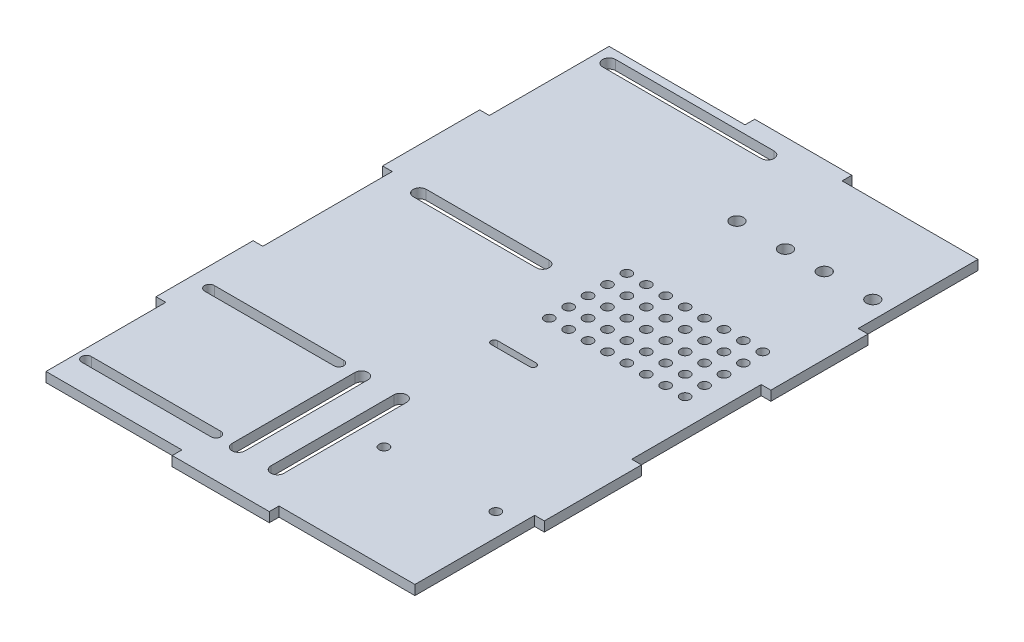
ISO-10303-21;
HEADER;
FILE_DESCRIPTION(('STEP AP214'),'2;1');
FILE_NAME('part.step','',(''),(''),'','','');
FILE_SCHEMA(('AUTOMOTIVE_DESIGN { 1 0 10303 214 1 1 1 1 }'));
ENDSEC;
DATA;
#1=APPLICATION_CONTEXT('core data for automotive mechanical design processes');
#2=APPLICATION_PROTOCOL_DEFINITION('international standard','automotive_design',2000,#1);
#3=PRODUCT_CONTEXT('',#1,'mechanical');
#4=PRODUCT('Part','Part','',(#3));
#5=PRODUCT_RELATED_PRODUCT_CATEGORY('part','',(#4));
#6=PRODUCT_DEFINITION_FORMATION('','',#4);
#7=PRODUCT_DEFINITION_CONTEXT('part definition',#1,'design');
#8=PRODUCT_DEFINITION('design','',#6,#7);
#9=PRODUCT_DEFINITION_SHAPE('','',#8);
#10=(LENGTH_UNIT() NAMED_UNIT(*) SI_UNIT(.MILLI.,.METRE.));
#11=(NAMED_UNIT(*) PLANE_ANGLE_UNIT() SI_UNIT($,.RADIAN.));
#12=(NAMED_UNIT(*) SI_UNIT($,.STERADIAN.) SOLID_ANGLE_UNIT());
#13=UNCERTAINTY_MEASURE_WITH_UNIT(LENGTH_MEASURE(1.E-05),#10,'distance_accuracy_value','');
#14=(GEOMETRIC_REPRESENTATION_CONTEXT(3) GLOBAL_UNCERTAINTY_ASSIGNED_CONTEXT((#13)) GLOBAL_UNIT_ASSIGNED_CONTEXT((#10,
#11,#12)) REPRESENTATION_CONTEXT('',''));
#15=CARTESIAN_POINT('',(0.,0.,0.));
#16=DIRECTION('',(0.,0.,1.));
#17=DIRECTION('',(1.,0.,0.));
#18=AXIS2_PLACEMENT_3D('',#15,#16,#17);
#19=CARTESIAN_POINT('',(-54.,0.,77.5));
#20=DIRECTION('',(0.,1.,0.));
#21=DIRECTION('',(0.,0.,1.));
#22=AXIS2_PLACEMENT_3D('',#19,#20,#21);
#23=CYLINDRICAL_SURFACE('',#22,1.5);
#24=DIRECTION('',(0.,1.,0.));
#25=VECTOR('',#24,1.);
#26=CARTESIAN_POINT('',(-54.,0.,76.));
#27=LINE('',#26,#25);
#28=CARTESIAN_POINT('',(-54.,0.,76.));
#29=VERTEX_POINT('',#28);
#30=CARTESIAN_POINT('',(-54.,3.,76.));
#31=VERTEX_POINT('',#30);
#32=EDGE_CURVE('E488',#29,#31,#27,.T.);
#33=ORIENTED_EDGE('',*,*,#32,.T.);
#34=CARTESIAN_POINT('',(-54.,3.,77.5));
#35=DIRECTION('',(0.,1.,0.));
#36=DIRECTION('',(0.,0.,1.));
#37=AXIS2_PLACEMENT_3D('',#34,#35,#36);
#38=CIRCLE('',#37,1.5);
#39=CARTESIAN_POINT('',(-54.,3.,79.));
#40=VERTEX_POINT('',#39);
#41=EDGE_CURVE('E766',#31,#40,#38,.T.);
#42=ORIENTED_EDGE('',*,*,#41,.T.);
#43=DIRECTION('',(0.,1.,0.));
#44=VECTOR('',#43,1.);
#45=CARTESIAN_POINT('',(-54.,0.,79.));
#46=LINE('',#45,#44);
#47=CARTESIAN_POINT('',(-54.,0.,79.));
#48=VERTEX_POINT('',#47);
#49=EDGE_CURVE('E513',#48,#40,#46,.T.);
#50=ORIENTED_EDGE('',*,*,#49,.F.);
#51=CARTESIAN_POINT('',(-54.,0.,77.5));
#52=DIRECTION('',(0.,1.,0.));
#53=DIRECTION('',(0.,0.,1.));
#54=AXIS2_PLACEMENT_3D('',#51,#52,#53);
#55=CIRCLE('',#54,1.5);
#56=EDGE_CURVE('E678',#29,#48,#55,.T.);
#57=ORIENTED_EDGE('',*,*,#56,.F.);
#58=EDGE_LOOP('',(#33,#42,#50,#57));
#59=FACE_BOUND('',#58,.T.);
#60=ADVANCED_FACE('F35',(#59),#23,.F.);
#61=CARTESIAN_POINT('',(-54.,0.,39.5));
#62=DIRECTION('',(0.,1.,0.));
#63=DIRECTION('',(0.,0.,1.));
#64=AXIS2_PLACEMENT_3D('',#61,#62,#63);
#65=CYLINDRICAL_SURFACE('',#64,1.5);
#66=DIRECTION('',(0.,1.,0.));
#67=VECTOR('',#66,1.);
#68=CARTESIAN_POINT('',(-54.,0.,38.));
#69=LINE('',#68,#67);
#70=CARTESIAN_POINT('',(-54.,0.,38.));
#71=VERTEX_POINT('',#70);
#72=CARTESIAN_POINT('',(-54.,3.,38.));
#73=VERTEX_POINT('',#72);
#74=EDGE_CURVE('E492',#71,#73,#69,.T.);
#75=ORIENTED_EDGE('',*,*,#74,.T.);
#76=CARTESIAN_POINT('',(-54.,3.,39.5));
#77=DIRECTION('',(0.,1.,0.));
#78=DIRECTION('',(0.,0.,1.));
#79=AXIS2_PLACEMENT_3D('',#76,#77,#78);
#80=CIRCLE('',#79,1.5);
#81=CARTESIAN_POINT('',(-54.,3.,41.));
#82=VERTEX_POINT('',#81);
#83=EDGE_CURVE('E752',#73,#82,#80,.T.);
#84=ORIENTED_EDGE('',*,*,#83,.T.);
#85=DIRECTION('',(0.,1.,0.));
#86=VECTOR('',#85,1.);
#87=CARTESIAN_POINT('',(-54.,0.,41.));
#88=LINE('',#87,#86);
#89=CARTESIAN_POINT('',(-54.,0.,41.));
#90=VERTEX_POINT('',#89);
#91=EDGE_CURVE('E484',#90,#82,#88,.T.);
#92=ORIENTED_EDGE('',*,*,#91,.F.);
#93=CARTESIAN_POINT('',(-54.,0.,39.5));
#94=DIRECTION('',(0.,1.,0.));
#95=DIRECTION('',(0.,0.,1.));
#96=AXIS2_PLACEMENT_3D('',#93,#94,#95);
#97=CIRCLE('',#96,1.5);
#98=EDGE_CURVE('E763',#71,#90,#97,.T.);
#99=ORIENTED_EDGE('',*,*,#98,.F.);
#100=EDGE_LOOP('',(#75,#84,#92,#99));
#101=FACE_BOUND('',#100,.T.);
#102=ADVANCED_FACE('F1113',(#101),#65,.F.);
#103=CARTESIAN_POINT('',(0.,3.,0.));
#104=DIRECTION('',(0.,-1.,0.));
#105=DIRECTION('',(0.,0.,-1.));
#106=AXIS2_PLACEMENT_3D('',#103,#104,#105);
#107=PLANE('',#106);
#108=CARTESIAN_POINT('',(48.5,3.,-17.));
#109=DIRECTION('',(0.,1.,0.));
#110=DIRECTION('',(0.,0.,1.));
#111=AXIS2_PLACEMENT_3D('',#108,#109,#110);
#112=CIRCLE('',#111,1.5);
#113=CARTESIAN_POINT('',(48.5,3.,-15.5));
#114=VERTEX_POINT('',#113);
#115=EDGE_CURVE('E1941',#114,#114,#112,.T.);
#116=ORIENTED_EDGE('',*,*,#115,.F.);
#117=EDGE_LOOP('',(#116));
#118=FACE_BOUND('',#117,.T.);
#119=CARTESIAN_POINT('',(12.5,3.,-11.));
#120=DIRECTION('',(0.,1.,0.));
#121=DIRECTION('',(0.,0.,1.));
#122=AXIS2_PLACEMENT_3D('',#119,#120,#121);
#123=CIRCLE('',#122,1.5);
#124=CARTESIAN_POINT('',(12.5,3.,-9.49999999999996));
#125=VERTEX_POINT('',#124);
#126=EDGE_CURVE('E1939',#125,#125,#123,.T.);
#127=ORIENTED_EDGE('',*,*,#126,.F.);
#128=EDGE_LOOP('',(#127));
#129=FACE_BOUND('',#128,.T.);
#130=CARTESIAN_POINT('',(18.5,3.,-11.));
#131=DIRECTION('',(0.,1.,0.));
#132=DIRECTION('',(0.,0.,1.));
#133=AXIS2_PLACEMENT_3D('',#130,#131,#132);
#134=CIRCLE('',#133,1.5);
#135=CARTESIAN_POINT('',(18.5,3.,-9.49999999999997));
#136=VERTEX_POINT('',#135);
#137=EDGE_CURVE('E1942',#136,#136,#134,.T.);
#138=ORIENTED_EDGE('',*,*,#137,.F.);
#139=EDGE_LOOP('',(#138));
#140=FACE_BOUND('',#139,.T.);
#141=CARTESIAN_POINT('',(24.5,3.,-11.));
#142=DIRECTION('',(0.,1.,0.));
#143=DIRECTION('',(0.,0.,1.));
#144=AXIS2_PLACEMENT_3D('',#141,#142,#143);
#145=CIRCLE('',#144,1.5);
#146=CARTESIAN_POINT('',(24.5,3.,-9.49999999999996));
#147=VERTEX_POINT('',#146);
#148=EDGE_CURVE('E1948',#147,#147,#145,.T.);
#149=ORIENTED_EDGE('',*,*,#148,.F.);
#150=EDGE_LOOP('',(#149));
#151=FACE_BOUND('',#150,.T.);
#152=CARTESIAN_POINT('',(42.5,3.,-17.));
#153=DIRECTION('',(0.,1.,0.));
#154=DIRECTION('',(0.,0.,1.));
#155=AXIS2_PLACEMENT_3D('',#152,#153,#154);
#156=CIRCLE('',#155,1.5);
#157=CARTESIAN_POINT('',(42.5,3.,-15.5));
#158=VERTEX_POINT('',#157);
#159=EDGE_CURVE('E1945',#158,#158,#156,.T.);
#160=ORIENTED_EDGE('',*,*,#159,.F.);
#161=EDGE_LOOP('',(#160));
#162=FACE_BOUND('',#161,.T.);
#163=CARTESIAN_POINT('',(36.5,3.,-17.));
#164=DIRECTION('',(0.,1.,0.));
#165=DIRECTION('',(0.,0.,1.));
#166=AXIS2_PLACEMENT_3D('',#163,#164,#165);
#167=CIRCLE('',#166,1.5);
#168=CARTESIAN_POINT('',(36.5,3.,-15.5));
#169=VERTEX_POINT('',#168);
#170=EDGE_CURVE('E1959',#169,#169,#167,.T.);
#171=ORIENTED_EDGE('',*,*,#170,.F.);
#172=EDGE_LOOP('',(#171));
#173=FACE_BOUND('',#172,.T.);
#174=CARTESIAN_POINT('',(30.5,3.,-17.));
#175=DIRECTION('',(0.,1.,0.));
#176=DIRECTION('',(0.,0.,1.));
#177=AXIS2_PLACEMENT_3D('',#174,#175,#176);
#178=CIRCLE('',#177,1.5);
#179=CARTESIAN_POINT('',(30.5,3.,-15.5));
#180=VERTEX_POINT('',#179);
#181=EDGE_CURVE('E1956',#180,#180,#178,.T.);
#182=ORIENTED_EDGE('',*,*,#181,.F.);
#183=EDGE_LOOP('',(#182));
#184=FACE_BOUND('',#183,.T.);
#185=CARTESIAN_POINT('',(24.5,3.,-17.));
#186=DIRECTION('',(0.,1.,0.));
#187=DIRECTION('',(0.,0.,1.));
#188=AXIS2_PLACEMENT_3D('',#185,#186,#187);
#189=CIRCLE('',#188,1.5);
#190=CARTESIAN_POINT('',(24.5,3.,-15.5));
#191=VERTEX_POINT('',#190);
#192=EDGE_CURVE('E1952',#191,#191,#189,.T.);
#193=ORIENTED_EDGE('',*,*,#192,.F.);
#194=EDGE_LOOP('',(#193));
#195=FACE_BOUND('',#194,.T.);
#196=CARTESIAN_POINT('',(30.5,3.,-11.));
#197=DIRECTION('',(0.,1.,0.));
#198=DIRECTION('',(0.,0.,1.));
#199=AXIS2_PLACEMENT_3D('',#196,#197,#198);
#200=CIRCLE('',#199,1.5);
#201=CARTESIAN_POINT('',(30.5,3.,-9.49999999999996));
#202=VERTEX_POINT('',#201);
#203=EDGE_CURVE('E2077',#202,#202,#200,.T.);
#204=ORIENTED_EDGE('',*,*,#203,.F.);
#205=EDGE_LOOP('',(#204));
#206=FACE_BOUND('',#205,.T.);
#207=CARTESIAN_POINT('',(36.5,3.,-11.));
#208=DIRECTION('',(0.,1.,0.));
#209=DIRECTION('',(0.,0.,1.));
#210=AXIS2_PLACEMENT_3D('',#207,#208,#209);
#211=CIRCLE('',#210,1.5);
#212=CARTESIAN_POINT('',(36.5,3.,-9.49999999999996));
#213=VERTEX_POINT('',#212);
#214=EDGE_CURVE('E2080',#213,#213,#211,.T.);
#215=ORIENTED_EDGE('',*,*,#214,.F.);
#216=EDGE_LOOP('',(#215));
#217=FACE_BOUND('',#216,.T.);
#218=CARTESIAN_POINT('',(42.5,3.,-11.));
#219=DIRECTION('',(0.,1.,0.));
#220=DIRECTION('',(0.,0.,1.));
#221=AXIS2_PLACEMENT_3D('',#218,#219,#220);
#222=CIRCLE('',#221,1.5);
#223=CARTESIAN_POINT('',(42.5,3.,-9.49999999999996));
#224=VERTEX_POINT('',#223);
#225=EDGE_CURVE('E2083',#224,#224,#222,.T.);
#226=ORIENTED_EDGE('',*,*,#225,.F.);
#227=EDGE_LOOP('',(#226));
#228=FACE_BOUND('',#227,.T.);
#229=CARTESIAN_POINT('',(48.5,3.,-11.));
#230=DIRECTION('',(0.,1.,0.));
#231=DIRECTION('',(0.,0.,1.));
#232=AXIS2_PLACEMENT_3D('',#229,#230,#231);
#233=CIRCLE('',#232,1.5);
#234=CARTESIAN_POINT('',(48.5,3.,-9.49999999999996));
#235=VERTEX_POINT('',#234);
#236=EDGE_CURVE('E2086',#235,#235,#233,.T.);
#237=ORIENTED_EDGE('',*,*,#236,.F.);
#238=EDGE_LOOP('',(#237));
#239=FACE_BOUND('',#238,.T.);
#240=CARTESIAN_POINT('',(12.5,3.,-4.99999999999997));
#241=DIRECTION('',(0.,1.,0.));
#242=DIRECTION('',(0.,0.,1.));
#243=AXIS2_PLACEMENT_3D('',#240,#241,#242);
#244=CIRCLE('',#243,1.5);
#245=CARTESIAN_POINT('',(12.5,3.,-3.49999999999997));
#246=VERTEX_POINT('',#245);
#247=EDGE_CURVE('E2089',#246,#246,#244,.T.);
#248=ORIENTED_EDGE('',*,*,#247,.F.);
#249=EDGE_LOOP('',(#248));
#250=FACE_BOUND('',#249,.T.);
#251=CARTESIAN_POINT('',(18.5,3.,-4.99999999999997));
#252=DIRECTION('',(0.,1.,0.));
#253=DIRECTION('',(0.,0.,1.));
#254=AXIS2_PLACEMENT_3D('',#251,#252,#253);
#255=CIRCLE('',#254,1.5);
#256=CARTESIAN_POINT('',(18.5,3.,-3.49999999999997));
#257=VERTEX_POINT('',#256);
#258=EDGE_CURVE('E2092',#257,#257,#255,.T.);
#259=ORIENTED_EDGE('',*,*,#258,.F.);
#260=EDGE_LOOP('',(#259));
#261=FACE_BOUND('',#260,.T.);
#262=CARTESIAN_POINT('',(24.5,3.,-4.99999999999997));
#263=DIRECTION('',(0.,1.,0.));
#264=DIRECTION('',(0.,0.,1.));
#265=AXIS2_PLACEMENT_3D('',#262,#263,#264);
#266=CIRCLE('',#265,1.5);
#267=CARTESIAN_POINT('',(24.5,3.,-3.49999999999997));
#268=VERTEX_POINT('',#267);
#269=EDGE_CURVE('E2095',#268,#268,#266,.T.);
#270=ORIENTED_EDGE('',*,*,#269,.F.);
#271=EDGE_LOOP('',(#270));
#272=FACE_BOUND('',#271,.T.);
#273=CARTESIAN_POINT('',(30.5,3.,-4.99999999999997));
#274=DIRECTION('',(0.,1.,0.));
#275=DIRECTION('',(0.,0.,1.));
#276=AXIS2_PLACEMENT_3D('',#273,#274,#275);
#277=CIRCLE('',#276,1.5);
#278=CARTESIAN_POINT('',(30.5,3.,-3.49999999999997));
#279=VERTEX_POINT('',#278);
#280=EDGE_CURVE('E2075',#279,#279,#277,.T.);
#281=ORIENTED_EDGE('',*,*,#280,.F.);
#282=EDGE_LOOP('',(#281));
#283=FACE_BOUND('',#282,.T.);
#284=CARTESIAN_POINT('',(36.5,3.,-29.));
#285=DIRECTION('',(0.,1.,0.));
#286=DIRECTION('',(0.,0.,1.));
#287=AXIS2_PLACEMENT_3D('',#284,#285,#286);
#288=CIRCLE('',#287,1.5);
#289=CARTESIAN_POINT('',(36.5,3.,-27.5));
#290=VERTEX_POINT('',#289);
#291=EDGE_CURVE('E1994',#290,#290,#288,.T.);
#292=ORIENTED_EDGE('',*,*,#291,.F.);
#293=EDGE_LOOP('',(#292));
#294=FACE_BOUND('',#293,.T.);
#295=CARTESIAN_POINT('',(42.5,3.,-29.));
#296=DIRECTION('',(0.,1.,0.));
#297=DIRECTION('',(0.,0.,1.));
#298=AXIS2_PLACEMENT_3D('',#295,#296,#297);
#299=CIRCLE('',#298,1.5);
#300=CARTESIAN_POINT('',(42.5,3.,-27.5));
#301=VERTEX_POINT('',#300);
#302=EDGE_CURVE('E1991',#301,#301,#299,.T.);
#303=ORIENTED_EDGE('',*,*,#302,.F.);
#304=EDGE_LOOP('',(#303));
#305=FACE_BOUND('',#304,.T.);
#306=CARTESIAN_POINT('',(48.5,3.,-29.));
#307=DIRECTION('',(0.,1.,0.));
#308=DIRECTION('',(0.,0.,1.));
#309=AXIS2_PLACEMENT_3D('',#306,#307,#308);
#310=CIRCLE('',#309,1.5);
#311=CARTESIAN_POINT('',(48.5,3.,-27.5));
#312=VERTEX_POINT('',#311);
#313=EDGE_CURVE('E1988',#312,#312,#310,.T.);
#314=ORIENTED_EDGE('',*,*,#313,.F.);
#315=EDGE_LOOP('',(#314));
#316=FACE_BOUND('',#315,.T.);
#317=CARTESIAN_POINT('',(12.5,3.,-23.));
#318=DIRECTION('',(0.,1.,0.));
#319=DIRECTION('',(0.,0.,1.));
#320=AXIS2_PLACEMENT_3D('',#317,#318,#319);
#321=CIRCLE('',#320,1.5);
#322=CARTESIAN_POINT('',(12.5,3.,-21.5));
#323=VERTEX_POINT('',#322);
#324=EDGE_CURVE('E1979',#323,#323,#321,.T.);
#325=ORIENTED_EDGE('',*,*,#324,.F.);
#326=EDGE_LOOP('',(#325));
#327=FACE_BOUND('',#326,.T.);
#328=CARTESIAN_POINT('',(30.5,3.,-29.));
#329=DIRECTION('',(0.,1.,0.));
#330=DIRECTION('',(0.,0.,1.));
#331=AXIS2_PLACEMENT_3D('',#328,#329,#330);
#332=CIRCLE('',#331,1.5);
#333=CARTESIAN_POINT('',(30.5,3.,-27.5));
#334=VERTEX_POINT('',#333);
#335=EDGE_CURVE('E1997',#334,#334,#332,.T.);
#336=ORIENTED_EDGE('',*,*,#335,.F.);
#337=EDGE_LOOP('',(#336));
#338=FACE_BOUND('',#337,.T.);
#339=CARTESIAN_POINT('',(24.5,3.,-29.));
#340=DIRECTION('',(0.,1.,0.));
#341=DIRECTION('',(0.,0.,1.));
#342=AXIS2_PLACEMENT_3D('',#339,#340,#341);
#343=CIRCLE('',#342,1.5);
#344=CARTESIAN_POINT('',(24.5,3.,-27.5));
#345=VERTEX_POINT('',#344);
#346=EDGE_CURVE('E2006',#345,#345,#343,.T.);
#347=ORIENTED_EDGE('',*,*,#346,.F.);
#348=EDGE_LOOP('',(#347));
#349=FACE_BOUND('',#348,.T.);
#350=CARTESIAN_POINT('',(18.5,3.,-29.));
#351=DIRECTION('',(0.,1.,0.));
#352=DIRECTION('',(0.,0.,1.));
#353=AXIS2_PLACEMENT_3D('',#350,#351,#352);
#354=CIRCLE('',#353,1.5);
#355=CARTESIAN_POINT('',(18.5,3.,-27.5));
#356=VERTEX_POINT('',#355);
#357=EDGE_CURVE('E2003',#356,#356,#354,.T.);
#358=ORIENTED_EDGE('',*,*,#357,.F.);
#359=EDGE_LOOP('',(#358));
#360=FACE_BOUND('',#359,.T.);
#361=CARTESIAN_POINT('',(12.5,3.,-29.));
#362=DIRECTION('',(0.,1.,0.));
#363=DIRECTION('',(0.,0.,1.));
#364=AXIS2_PLACEMENT_3D('',#361,#362,#363);
#365=CIRCLE('',#364,1.5);
#366=CARTESIAN_POINT('',(12.5,3.,-27.5));
#367=VERTEX_POINT('',#366);
#368=EDGE_CURVE('E2000',#367,#367,#365,.T.);
#369=ORIENTED_EDGE('',*,*,#368,.F.);
#370=EDGE_LOOP('',(#369));
#371=FACE_BOUND('',#370,.T.);
#372=CARTESIAN_POINT('',(18.5,3.,-17.));
#373=DIRECTION('',(0.,1.,0.));
#374=DIRECTION('',(0.,0.,1.));
#375=AXIS2_PLACEMENT_3D('',#372,#373,#374);
#376=CIRCLE('',#375,1.5);
#377=CARTESIAN_POINT('',(18.5,3.,-15.5));
#378=VERTEX_POINT('',#377);
#379=EDGE_CURVE('E1955',#378,#378,#376,.T.);
#380=ORIENTED_EDGE('',*,*,#379,.F.);
#381=EDGE_LOOP('',(#380));
#382=FACE_BOUND('',#381,.T.);
#383=CARTESIAN_POINT('',(12.5,3.,-17.));
#384=DIRECTION('',(0.,1.,0.));
#385=DIRECTION('',(0.,0.,1.));
#386=AXIS2_PLACEMENT_3D('',#383,#384,#385);
#387=CIRCLE('',#386,1.5);
#388=CARTESIAN_POINT('',(12.5,3.,-15.5));
#389=VERTEX_POINT('',#388);
#390=EDGE_CURVE('E1971',#389,#389,#387,.T.);
#391=ORIENTED_EDGE('',*,*,#390,.F.);
#392=EDGE_LOOP('',(#391));
#393=FACE_BOUND('',#392,.T.);
#394=CARTESIAN_POINT('',(48.5,3.,-23.));
#395=DIRECTION('',(0.,1.,0.));
#396=DIRECTION('',(0.,0.,1.));
#397=AXIS2_PLACEMENT_3D('',#394,#395,#396);
#398=CIRCLE('',#397,1.5);
#399=CARTESIAN_POINT('',(48.5,3.,-21.5));
#400=VERTEX_POINT('',#399);
#401=EDGE_CURVE('E1968',#400,#400,#398,.T.);
#402=ORIENTED_EDGE('',*,*,#401,.F.);
#403=EDGE_LOOP('',(#402));
#404=FACE_BOUND('',#403,.T.);
#405=CARTESIAN_POINT('',(42.5,3.,-23.));
#406=DIRECTION('',(0.,1.,0.));
#407=DIRECTION('',(0.,0.,1.));
#408=AXIS2_PLACEMENT_3D('',#405,#406,#407);
#409=CIRCLE('',#408,1.5);
#410=CARTESIAN_POINT('',(42.5,3.,-21.5));
#411=VERTEX_POINT('',#410);
#412=EDGE_CURVE('E1964',#411,#411,#409,.T.);
#413=ORIENTED_EDGE('',*,*,#412,.F.);
#414=EDGE_LOOP('',(#413));
#415=FACE_BOUND('',#414,.T.);
#416=CARTESIAN_POINT('',(36.5,3.,-23.));
#417=DIRECTION('',(0.,1.,0.));
#418=DIRECTION('',(0.,0.,1.));
#419=AXIS2_PLACEMENT_3D('',#416,#417,#418);
#420=CIRCLE('',#419,1.5);
#421=CARTESIAN_POINT('',(36.5,3.,-21.5));
#422=VERTEX_POINT('',#421);
#423=EDGE_CURVE('E1967',#422,#422,#420,.T.);
#424=ORIENTED_EDGE('',*,*,#423,.F.);
#425=EDGE_LOOP('',(#424));
#426=FACE_BOUND('',#425,.T.);
#427=CARTESIAN_POINT('',(30.5,3.,-23.));
#428=DIRECTION('',(0.,1.,0.));
#429=DIRECTION('',(0.,0.,1.));
#430=AXIS2_PLACEMENT_3D('',#427,#428,#429);
#431=CIRCLE('',#430,1.5);
#432=CARTESIAN_POINT('',(30.5,3.,-21.5));
#433=VERTEX_POINT('',#432);
#434=EDGE_CURVE('E1983',#433,#433,#431,.T.);
#435=ORIENTED_EDGE('',*,*,#434,.F.);
#436=EDGE_LOOP('',(#435));
#437=FACE_BOUND('',#436,.T.);
#438=CARTESIAN_POINT('',(24.5,3.,-23.));
#439=DIRECTION('',(0.,1.,0.));
#440=DIRECTION('',(0.,0.,1.));
#441=AXIS2_PLACEMENT_3D('',#438,#439,#440);
#442=CIRCLE('',#441,1.5);
#443=CARTESIAN_POINT('',(24.5,3.,-21.5));
#444=VERTEX_POINT('',#443);
#445=EDGE_CURVE('E1980',#444,#444,#442,.T.);
#446=ORIENTED_EDGE('',*,*,#445,.F.);
#447=EDGE_LOOP('',(#446));
#448=FACE_BOUND('',#447,.T.);
#449=CARTESIAN_POINT('',(18.5,3.,-23.));
#450=DIRECTION('',(0.,1.,0.));
#451=DIRECTION('',(0.,0.,1.));
#452=AXIS2_PLACEMENT_3D('',#449,#450,#451);
#453=CIRCLE('',#452,1.5);
#454=CARTESIAN_POINT('',(18.5,3.,-21.5));
#455=VERTEX_POINT('',#454);
#456=EDGE_CURVE('E1976',#455,#455,#453,.T.);
#457=ORIENTED_EDGE('',*,*,#456,.F.);
#458=EDGE_LOOP('',(#457));
#459=FACE_BOUND('',#458,.T.);
#460=CARTESIAN_POINT('',(6.5,3.,-4.99999999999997));
#461=DIRECTION('',(0.,1.,0.));
#462=DIRECTION('',(0.,0.,1.));
#463=AXIS2_PLACEMENT_3D('',#460,#461,#462);
#464=CIRCLE('',#463,1.5);
#465=CARTESIAN_POINT('',(6.5,3.,-3.49999999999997));
#466=VERTEX_POINT('',#465);
#467=EDGE_CURVE('E2044',#466,#466,#464,.T.);
#468=ORIENTED_EDGE('',*,*,#467,.F.);
#469=EDGE_LOOP('',(#468));
#470=FACE_BOUND('',#469,.T.);
#471=CARTESIAN_POINT('',(6.5,3.,-11.));
#472=DIRECTION('',(0.,1.,0.));
#473=DIRECTION('',(0.,0.,1.));
#474=AXIS2_PLACEMENT_3D('',#471,#472,#473);
#475=CIRCLE('',#474,1.5);
#476=CARTESIAN_POINT('',(6.5,3.,-9.49999999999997));
#477=VERTEX_POINT('',#476);
#478=EDGE_CURVE('E2048',#477,#477,#475,.T.);
#479=ORIENTED_EDGE('',*,*,#478,.F.);
#480=EDGE_LOOP('',(#479));
#481=FACE_BOUND('',#480,.T.);
#482=CARTESIAN_POINT('',(6.5,3.,-17.));
#483=DIRECTION('',(0.,1.,0.));
#484=DIRECTION('',(0.,0.,1.));
#485=AXIS2_PLACEMENT_3D('',#482,#483,#484);
#486=CIRCLE('',#485,1.5);
#487=CARTESIAN_POINT('',(6.5,3.,-15.5));
#488=VERTEX_POINT('',#487);
#489=EDGE_CURVE('E2052',#488,#488,#486,.T.);
#490=ORIENTED_EDGE('',*,*,#489,.F.);
#491=EDGE_LOOP('',(#490));
#492=FACE_BOUND('',#491,.T.);
#493=CARTESIAN_POINT('',(36.5,3.,-4.99999999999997));
#494=DIRECTION('',(0.,1.,0.));
#495=DIRECTION('',(0.,0.,1.));
#496=AXIS2_PLACEMENT_3D('',#493,#494,#495);
#497=CIRCLE('',#496,1.5);
#498=CARTESIAN_POINT('',(36.5,3.,-3.49999999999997));
#499=VERTEX_POINT('',#498);
#500=EDGE_CURVE('E2056',#499,#499,#497,.T.);
#501=ORIENTED_EDGE('',*,*,#500,.F.);
#502=EDGE_LOOP('',(#501));
#503=FACE_BOUND('',#502,.T.);
#504=CARTESIAN_POINT('',(42.5,3.,-4.99999999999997));
#505=DIRECTION('',(0.,1.,0.));
#506=DIRECTION('',(0.,0.,1.));
#507=AXIS2_PLACEMENT_3D('',#504,#505,#506);
#508=CIRCLE('',#507,1.5);
#509=CARTESIAN_POINT('',(42.5,3.,-3.49999999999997));
#510=VERTEX_POINT('',#509);
#511=EDGE_CURVE('E2060',#510,#510,#508,.T.);
#512=ORIENTED_EDGE('',*,*,#511,.F.);
#513=EDGE_LOOP('',(#512));
#514=FACE_BOUND('',#513,.T.);
#515=CARTESIAN_POINT('',(48.5,3.,-4.99999999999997));
#516=DIRECTION('',(0.,1.,0.));
#517=DIRECTION('',(0.,0.,1.));
#518=AXIS2_PLACEMENT_3D('',#515,#516,#517);
#519=CIRCLE('',#518,1.5);
#520=CARTESIAN_POINT('',(48.5,3.,-3.49999999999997));
#521=VERTEX_POINT('',#520);
#522=EDGE_CURVE('E2064',#521,#521,#519,.T.);
#523=ORIENTED_EDGE('',*,*,#522,.F.);
#524=EDGE_LOOP('',(#523));
#525=FACE_BOUND('',#524,.T.);
#526=CARTESIAN_POINT('',(6.50000000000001,3.,-23.));
#527=DIRECTION('',(0.,1.,0.));
#528=DIRECTION('',(0.,0.,1.));
#529=AXIS2_PLACEMENT_3D('',#526,#527,#528);
#530=CIRCLE('',#529,1.5);
#531=CARTESIAN_POINT('',(6.50000000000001,3.,-21.5));
#532=VERTEX_POINT('',#531);
#533=EDGE_CURVE('E2067',#532,#532,#530,.T.);
#534=ORIENTED_EDGE('',*,*,#533,.F.);
#535=EDGE_LOOP('',(#534));
#536=FACE_BOUND('',#535,.T.);
#537=CARTESIAN_POINT('',(6.50000000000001,3.,-29.));
#538=DIRECTION('',(0.,1.,0.));
#539=DIRECTION('',(0.,0.,1.));
#540=AXIS2_PLACEMENT_3D('',#537,#538,#539);
#541=CIRCLE('',#540,1.5);
#542=CARTESIAN_POINT('',(6.50000000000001,3.,-27.5));
#543=VERTEX_POINT('',#542);
#544=EDGE_CURVE('E869',#543,#543,#541,.T.);
#545=ORIENTED_EDGE('',*,*,#544,.F.);
#546=EDGE_LOOP('',(#545));
#547=FACE_BOUND('',#546,.T.);
#548=DIRECTION('',(0.,0.,1.));
#549=VECTOR('',#548,1.);
#550=CARTESIAN_POINT('',(-9.00000000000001,3.,39.5));
#551=LINE('',#550,#549);
#552=CARTESIAN_POINT('',(-9.00000000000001,3.,39.5));
#553=VERTEX_POINT('',#552);
#554=CARTESIAN_POINT('',(-9.00000000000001,3.,77.5));
#555=VERTEX_POINT('',#554);
#556=EDGE_CURVE('E406',#553,#555,#551,.T.);
#557=ORIENTED_EDGE('',*,*,#556,.F.);
#558=CARTESIAN_POINT('',(-7.00000000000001,3.,39.5));
#559=DIRECTION('',(0.,1.,0.));
#560=DIRECTION('',(0.,0.,1.));
#561=AXIS2_PLACEMENT_3D('',#558,#559,#560);
#562=CIRCLE('',#561,2.);
#563=CARTESIAN_POINT('',(-5.00000000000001,3.,39.5));
#564=VERTEX_POINT('',#563);
#565=EDGE_CURVE('E52',#564,#553,#562,.T.);
#566=ORIENTED_EDGE('',*,*,#565,.F.);
#567=DIRECTION('',(0.,0.,-1.));
#568=VECTOR('',#567,1.);
#569=CARTESIAN_POINT('',(-5.00000000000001,3.,39.5));
#570=LINE('',#569,#568);
#571=CARTESIAN_POINT('',(-5.,3.,77.5));
#572=VERTEX_POINT('',#571);
#573=EDGE_CURVE('E413',#572,#564,#570,.T.);
#574=ORIENTED_EDGE('',*,*,#573,.F.);
#575=CARTESIAN_POINT('',(-7.,3.,77.5));
#576=DIRECTION('',(0.,1.,0.));
#577=DIRECTION('',(0.,0.,1.));
#578=AXIS2_PLACEMENT_3D('',#575,#576,#577);
#579=CIRCLE('',#578,2.);
#580=EDGE_CURVE('E396',#555,#572,#579,.T.);
#581=ORIENTED_EDGE('',*,*,#580,.F.);
#582=EDGE_LOOP('',(#557,#566,#574,#581));
#583=FACE_BOUND('',#582,.T.);
#584=DIRECTION('',(0.,0.,1.));
#585=VECTOR('',#584,1.);
#586=CARTESIAN_POINT('',(2.99999999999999,3.,39.5));
#587=LINE('',#586,#585);
#588=CARTESIAN_POINT('',(2.99999999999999,3.,39.5));
#589=VERTEX_POINT('',#588);
#590=CARTESIAN_POINT('',(2.99999999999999,3.,77.5));
#591=VERTEX_POINT('',#590);
#592=EDGE_CURVE('E424',#589,#591,#587,.T.);
#593=ORIENTED_EDGE('',*,*,#592,.F.);
#594=CARTESIAN_POINT('',(4.99999999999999,3.,39.5));
#595=DIRECTION('',(0.,1.,0.));
#596=DIRECTION('',(0.,0.,1.));
#597=AXIS2_PLACEMENT_3D('',#594,#595,#596);
#598=CIRCLE('',#597,2.);
#599=CARTESIAN_POINT('',(6.99999999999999,3.,39.5));
#600=VERTEX_POINT('',#599);
#601=EDGE_CURVE('E60',#600,#589,#598,.T.);
#602=ORIENTED_EDGE('',*,*,#601,.F.);
#603=DIRECTION('',(0.,0.,-1.));
#604=VECTOR('',#603,1.);
#605=CARTESIAN_POINT('',(6.99999999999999,3.,39.5));
#606=LINE('',#605,#604);
#607=CARTESIAN_POINT('',(7.,3.,77.5));
#608=VERTEX_POINT('',#607);
#609=EDGE_CURVE('E430',#608,#600,#606,.T.);
#610=ORIENTED_EDGE('',*,*,#609,.F.);
#611=CARTESIAN_POINT('',(5.,3.,77.5));
#612=DIRECTION('',(0.,1.,0.));
#613=DIRECTION('',(0.,0.,1.));
#614=AXIS2_PLACEMENT_3D('',#611,#612,#613);
#615=CIRCLE('',#614,2.);
#616=EDGE_CURVE('E427',#591,#608,#615,.T.);
#617=ORIENTED_EDGE('',*,*,#616,.F.);
#618=EDGE_LOOP('',(#593,#602,#610,#617));
#619=FACE_BOUND('',#618,.T.);
#620=DIRECTION('',(1.,0.,0.));
#621=VECTOR('',#620,1.);
#622=CARTESIAN_POINT('',(-52.5,3.,-80.5));
#623=LINE('',#622,#621);
#624=CARTESIAN_POINT('',(-52.5,3.,-80.5));
#625=VERTEX_POINT('',#624);
#626=CARTESIAN_POINT('',(-3.49999999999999,3.,-80.5));
#627=VERTEX_POINT('',#626);
#628=EDGE_CURVE('E677',#625,#627,#623,.T.);
#629=ORIENTED_EDGE('',*,*,#628,.F.);
#630=CARTESIAN_POINT('',(-52.5,3.,-82.5));
#631=DIRECTION('',(0.,1.,0.));
#632=DIRECTION('',(0.,0.,1.));
#633=AXIS2_PLACEMENT_3D('',#630,#631,#632);
#634=CIRCLE('',#633,1.99999999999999);
#635=CARTESIAN_POINT('',(-52.5,3.,-84.5));
#636=VERTEX_POINT('',#635);
#637=EDGE_CURVE('E675',#636,#625,#634,.T.);
#638=ORIENTED_EDGE('',*,*,#637,.F.);
#639=DIRECTION('',(-1.,0.,0.));
#640=VECTOR('',#639,1.);
#641=CARTESIAN_POINT('',(-3.49999999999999,3.,-84.5));
#642=LINE('',#641,#640);
#643=CARTESIAN_POINT('',(-3.49999999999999,3.,-84.5));
#644=VERTEX_POINT('',#643);
#645=EDGE_CURVE('E665',#644,#636,#642,.T.);
#646=ORIENTED_EDGE('',*,*,#645,.F.);
#647=CARTESIAN_POINT('',(-3.49999999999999,3.,-82.5));
#648=DIRECTION('',(0.,1.,0.));
#649=DIRECTION('',(0.,0.,1.));
#650=AXIS2_PLACEMENT_3D('',#647,#648,#649);
#651=CIRCLE('',#650,1.99999999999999);
#652=EDGE_CURVE('E681',#627,#644,#651,.T.);
#653=ORIENTED_EDGE('',*,*,#652,.F.);
#654=EDGE_LOOP('',(#629,#638,#646,#653));
#655=FACE_BOUND('',#654,.T.);
#656=CARTESIAN_POINT('',(36.5,3.,-60.));
#657=DIRECTION('',(0.,1.,0.));
#658=DIRECTION('',(0.,0.,1.));
#659=AXIS2_PLACEMENT_3D('',#656,#657,#658);
#660=CIRCLE('',#659,2.);
#661=CARTESIAN_POINT('',(36.5,3.,-58.));
#662=VERTEX_POINT('',#661);
#663=EDGE_CURVE('E698',#662,#662,#660,.T.);
#664=ORIENTED_EDGE('',*,*,#663,.F.);
#665=EDGE_LOOP('',(#664));
#666=FACE_BOUND('',#665,.T.);
#667=CARTESIAN_POINT('',(24.5,3.,-60.));
#668=DIRECTION('',(0.,1.,0.));
#669=DIRECTION('',(0.,0.,1.));
#670=AXIS2_PLACEMENT_3D('',#667,#668,#669);
#671=CIRCLE('',#670,2.);
#672=CARTESIAN_POINT('',(24.5,3.,-58.));
#673=VERTEX_POINT('',#672);
#674=EDGE_CURVE('E705',#673,#673,#671,.T.);
#675=ORIENTED_EDGE('',*,*,#674,.F.);
#676=EDGE_LOOP('',(#675));
#677=FACE_BOUND('',#676,.T.);
#678=CARTESIAN_POINT('',(9.50000000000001,3.,-60.));
#679=DIRECTION('',(0.,1.,0.));
#680=DIRECTION('',(0.,0.,1.));
#681=AXIS2_PLACEMENT_3D('',#678,#679,#680);
#682=CIRCLE('',#681,2.);
#683=CARTESIAN_POINT('',(9.50000000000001,3.,-58.));
#684=VERTEX_POINT('',#683);
#685=EDGE_CURVE('E704',#684,#684,#682,.T.);
#686=ORIENTED_EDGE('',*,*,#685,.F.);
#687=EDGE_LOOP('',(#686));
#688=FACE_BOUND('',#687,.T.);
#689=CARTESIAN_POINT('',(50.,3.,55.));
#690=DIRECTION('',(0.,1.,0.));
#691=DIRECTION('',(0.,0.,1.));
#692=AXIS2_PLACEMENT_3D('',#689,#690,#691);
#693=CIRCLE('',#692,1.5);
#694=CARTESIAN_POINT('',(50.,3.,56.5));
#695=VERTEX_POINT('',#694);
#696=EDGE_CURVE('E717',#695,#695,#693,.T.);
#697=ORIENTED_EDGE('',*,*,#696,.F.);
#698=EDGE_LOOP('',(#697));
#699=FACE_BOUND('',#698,.T.);
#700=CARTESIAN_POINT('',(51.5,3.,-60.));
#701=DIRECTION('',(0.,1.,0.));
#702=DIRECTION('',(0.,0.,1.));
#703=AXIS2_PLACEMENT_3D('',#700,#701,#702);
#704=CIRCLE('',#703,2.);
#705=CARTESIAN_POINT('',(51.5,3.,-58.));
#706=VERTEX_POINT('',#705);
#707=EDGE_CURVE('E634',#706,#706,#704,.T.);
#708=ORIENTED_EDGE('',*,*,#707,.F.);
#709=EDGE_LOOP('',(#708));
#710=FACE_BOUND('',#709,.T.);
#711=ORIENTED_EDGE('',*,*,#41,.F.);
#712=DIRECTION('',(-1.,0.,0.));
#713=VECTOR('',#712,1.);
#714=CARTESIAN_POINT('',(-54.,3.,76.));
#715=LINE('',#714,#713);
#716=CARTESIAN_POINT('',(-14.,3.,76.));
#717=VERTEX_POINT('',#716);
#718=EDGE_CURVE('E507',#717,#31,#715,.T.);
#719=ORIENTED_EDGE('',*,*,#718,.F.);
#720=CARTESIAN_POINT('',(-14.,3.,77.5));
#721=DIRECTION('',(0.,1.,0.));
#722=DIRECTION('',(0.,0.,1.));
#723=AXIS2_PLACEMENT_3D('',#720,#721,#722);
#724=CIRCLE('',#723,1.49999999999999);
#725=CARTESIAN_POINT('',(-14.,3.,79.));
#726=VERTEX_POINT('',#725);
#727=EDGE_CURVE('E515',#726,#717,#724,.T.);
#728=ORIENTED_EDGE('',*,*,#727,.F.);
#729=DIRECTION('',(1.,0.,0.));
#730=VECTOR('',#729,1.);
#731=CARTESIAN_POINT('',(-54.,3.,79.));
#732=LINE('',#731,#730);
#733=EDGE_CURVE('E465',#40,#726,#732,.T.);
#734=ORIENTED_EDGE('',*,*,#733,.F.);
#735=EDGE_LOOP('',(#711,#719,#728,#734));
#736=FACE_BOUND('',#735,.T.);
#737=ORIENTED_EDGE('',*,*,#83,.F.);
#738=DIRECTION('',(-1.,0.,0.));
#739=VECTOR('',#738,1.);
#740=CARTESIAN_POINT('',(-54.,3.,38.));
#741=LINE('',#740,#739);
#742=CARTESIAN_POINT('',(-14.,3.,38.));
#743=VERTEX_POINT('',#742);
#744=EDGE_CURVE('E478',#743,#73,#741,.T.);
#745=ORIENTED_EDGE('',*,*,#744,.F.);
#746=CARTESIAN_POINT('',(-14.,3.,39.5));
#747=DIRECTION('',(0.,1.,0.));
#748=DIRECTION('',(0.,0.,1.));
#749=AXIS2_PLACEMENT_3D('',#746,#747,#748);
#750=CIRCLE('',#749,1.5);
#751=CARTESIAN_POINT('',(-14.,3.,41.));
#752=VERTEX_POINT('',#751);
#753=EDGE_CURVE('E487',#752,#743,#750,.T.);
#754=ORIENTED_EDGE('',*,*,#753,.F.);
#755=DIRECTION('',(1.,0.,0.));
#756=VECTOR('',#755,1.);
#757=CARTESIAN_POINT('',(-54.,3.,41.));
#758=LINE('',#757,#756);
#759=EDGE_CURVE('E485',#82,#752,#758,.T.);
#760=ORIENTED_EDGE('',*,*,#759,.F.);
#761=EDGE_LOOP('',(#737,#745,#754,#760));
#762=FACE_BOUND('',#761,.T.);
#763=DIRECTION('',(1.,0.,0.));
#764=VECTOR('',#763,1.);
#765=CARTESIAN_POINT('',(-47.,3.,-16.5));
#766=LINE('',#765,#764);
#767=CARTESIAN_POINT('',(-47.,3.,-16.5));
#768=VERTEX_POINT('',#767);
#769=CARTESIAN_POINT('',(-9.,3.,-16.5));
#770=VERTEX_POINT('',#769);
#771=EDGE_CURVE('E741',#768,#770,#766,.T.);
#772=ORIENTED_EDGE('',*,*,#771,.F.);
#773=CARTESIAN_POINT('',(-47.,3.,-18.5));
#774=DIRECTION('',(0.,1.,0.));
#775=DIRECTION('',(0.,0.,1.));
#776=AXIS2_PLACEMENT_3D('',#773,#774,#775);
#777=CIRCLE('',#776,2.00000000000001);
#778=CARTESIAN_POINT('',(-47.,3.,-20.5));
#779=VERTEX_POINT('',#778);
#780=EDGE_CURVE('E739',#779,#768,#777,.T.);
#781=ORIENTED_EDGE('',*,*,#780,.F.);
#782=DIRECTION('',(-1.,0.,0.));
#783=VECTOR('',#782,1.);
#784=CARTESIAN_POINT('',(-9.,3.,-20.5));
#785=LINE('',#784,#783);
#786=CARTESIAN_POINT('',(-9.,3.,-20.5));
#787=VERTEX_POINT('',#786);
#788=EDGE_CURVE('E729',#787,#779,#785,.T.);
#789=ORIENTED_EDGE('',*,*,#788,.F.);
#790=CARTESIAN_POINT('',(-9.,3.,-18.5));
#791=DIRECTION('',(0.,1.,0.));
#792=DIRECTION('',(0.,0.,1.));
#793=AXIS2_PLACEMENT_3D('',#790,#791,#792);
#794=CIRCLE('',#793,2.00000000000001);
#795=EDGE_CURVE('E745',#770,#787,#794,.T.);
#796=ORIENTED_EDGE('',*,*,#795,.F.);
#797=EDGE_LOOP('',(#772,#781,#789,#796));
#798=FACE_BOUND('',#797,.T.);
#799=DIRECTION('',(1.,0.,0.));
#800=VECTOR('',#799,1.);
#801=CARTESIAN_POINT('',(4.50000000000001,3.,11.));
#802=LINE('',#801,#800);
#803=CARTESIAN_POINT('',(4.50000000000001,3.,11.));
#804=VERTEX_POINT('',#803);
#805=CARTESIAN_POINT('',(16.5,3.,11.));
#806=VERTEX_POINT('',#805);
#807=EDGE_CURVE('E456',#804,#806,#802,.T.);
#808=ORIENTED_EDGE('',*,*,#807,.F.);
#809=CARTESIAN_POINT('',(4.50000000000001,3.,10.));
#810=DIRECTION('',(0.,1.,0.));
#811=DIRECTION('',(0.,0.,1.));
#812=AXIS2_PLACEMENT_3D('',#809,#810,#811);
#813=CIRCLE('',#812,0.999999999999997);
#814=CARTESIAN_POINT('',(4.50000000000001,3.,9.00000000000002));
#815=VERTEX_POINT('',#814);
#816=EDGE_CURVE('E420',#815,#804,#813,.T.);
#817=ORIENTED_EDGE('',*,*,#816,.F.);
#818=DIRECTION('',(-1.,0.,0.));
#819=VECTOR('',#818,1.);
#820=CARTESIAN_POINT('',(4.50000000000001,3.,9.00000000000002));
#821=LINE('',#820,#819);
#822=CARTESIAN_POINT('',(16.5,3.,9.00000000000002));
#823=VERTEX_POINT('',#822);
#824=EDGE_CURVE('E445',#823,#815,#821,.T.);
#825=ORIENTED_EDGE('',*,*,#824,.F.);
#826=CARTESIAN_POINT('',(16.5,3.,10.));
#827=DIRECTION('',(0.,1.,0.));
#828=DIRECTION('',(0.,0.,1.));
#829=AXIS2_PLACEMENT_3D('',#826,#827,#828);
#830=CIRCLE('',#829,0.999999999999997);
#831=EDGE_CURVE('E458',#806,#823,#830,.T.);
#832=ORIENTED_EDGE('',*,*,#831,.F.);
#833=EDGE_LOOP('',(#808,#817,#825,#832));
#834=FACE_BOUND('',#833,.T.);
#835=CARTESIAN_POINT('',(15.4246183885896,3.,55.));
#836=DIRECTION('',(0.,1.,0.));
#837=DIRECTION('',(0.,0.,1.));
#838=AXIS2_PLACEMENT_3D('',#835,#836,#837);
#839=CIRCLE('',#838,1.5);
#840=CARTESIAN_POINT('',(15.4246183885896,3.,56.5));
#841=VERTEX_POINT('',#840);
#842=EDGE_CURVE('E716',#841,#841,#839,.T.);
#843=ORIENTED_EDGE('',*,*,#842,.F.);
#844=EDGE_LOOP('',(#843));
#845=FACE_BOUND('',#844,.T.);
#846=DIRECTION('',(0.,0.,1.));
#847=VECTOR('',#846,1.);
#848=CARTESIAN_POINT('',(-15.,3.,0.));
#849=LINE('',#848,#847);
#850=CARTESIAN_POINT('',(-15.,3.,-90.));
#851=VERTEX_POINT('',#850);
#852=CARTESIAN_POINT('',(-15.,3.,-87.));
#853=VERTEX_POINT('',#852);
#854=EDGE_CURVE('E531',#851,#853,#849,.T.);
#855=ORIENTED_EDGE('',*,*,#854,.T.);
#856=DIRECTION('',(1.,0.,0.));
#857=VECTOR('',#856,1.);
#858=CARTESIAN_POINT('',(0.,3.,-87.));
#859=LINE('',#858,#857);
#860=CARTESIAN_POINT('',(-57.,3.,-87.));
#861=VERTEX_POINT('',#860);
#862=EDGE_CURVE('E528',#861,#853,#859,.T.);
#863=ORIENTED_EDGE('',*,*,#862,.F.);
#864=DIRECTION('',(0.,0.,-1.));
#865=VECTOR('',#864,1.);
#866=CARTESIAN_POINT('',(-57.,3.,-90.));
#867=LINE('',#866,#865);
#868=CARTESIAN_POINT('',(-57.,3.,-50.));
#869=VERTEX_POINT('',#868);
#870=EDGE_CURVE('E627',#869,#861,#867,.T.);
#871=ORIENTED_EDGE('',*,*,#870,.F.);
#872=DIRECTION('',(1.,0.,0.));
#873=VECTOR('',#872,1.);
#874=CARTESIAN_POINT('',(-60.,3.,-50.));
#875=LINE('',#874,#873);
#876=CARTESIAN_POINT('',(-60.,3.,-50.));
#877=VERTEX_POINT('',#876);
#878=EDGE_CURVE('E624',#877,#869,#875,.T.);
#879=ORIENTED_EDGE('',*,*,#878,.F.);
#880=DIRECTION('',(0.,0.,1.));
#881=VECTOR('',#880,1.);
#882=CARTESIAN_POINT('',(-60.,3.,90.));
#883=LINE('',#882,#881);
#884=CARTESIAN_POINT('',(-60.,3.,-20.));
#885=VERTEX_POINT('',#884);
#886=EDGE_CURVE('E784',#877,#885,#883,.T.);
#887=ORIENTED_EDGE('',*,*,#886,.T.);
#888=DIRECTION('',(-1.,0.,0.));
#889=VECTOR('',#888,1.);
#890=CARTESIAN_POINT('',(-60.,3.,-20.));
#891=LINE('',#890,#889);
#892=CARTESIAN_POINT('',(-57.,3.,-20.));
#893=VERTEX_POINT('',#892);
#894=EDGE_CURVE('E651',#893,#885,#891,.T.);
#895=ORIENTED_EDGE('',*,*,#894,.F.);
#896=DIRECTION('',(0.,0.,-1.));
#897=VECTOR('',#896,1.);
#898=CARTESIAN_POINT('',(-57.,3.,20.));
#899=LINE('',#898,#897);
#900=CARTESIAN_POINT('',(-57.,3.,20.));
#901=VERTEX_POINT('',#900);
#902=EDGE_CURVE('E648',#901,#893,#899,.T.);
#903=ORIENTED_EDGE('',*,*,#902,.F.);
#904=DIRECTION('',(1.,0.,0.));
#905=VECTOR('',#904,1.);
#906=CARTESIAN_POINT('',(-60.,3.,20.));
#907=LINE('',#906,#905);
#908=CARTESIAN_POINT('',(-60.,3.,20.));
#909=VERTEX_POINT('',#908);
#910=EDGE_CURVE('E596',#909,#901,#907,.T.);
#911=ORIENTED_EDGE('',*,*,#910,.F.);
#912=CARTESIAN_POINT('',(-60.,3.,50.));
#913=VERTEX_POINT('',#912);
#914=EDGE_CURVE('E781',#909,#913,#883,.T.);
#915=ORIENTED_EDGE('',*,*,#914,.T.);
#916=DIRECTION('',(-1.,0.,0.));
#917=VECTOR('',#916,1.);
#918=CARTESIAN_POINT('',(-60.,3.,50.));
#919=LINE('',#918,#917);
#920=CARTESIAN_POINT('',(-57.,3.,50.));
#921=VERTEX_POINT('',#920);
#922=EDGE_CURVE('E638',#921,#913,#919,.T.);
#923=ORIENTED_EDGE('',*,*,#922,.F.);
#924=DIRECTION('',(0.,0.,-1.));
#925=VECTOR('',#924,1.);
#926=CARTESIAN_POINT('',(-57.,3.,90.));
#927=LINE('',#926,#925);
#928=CARTESIAN_POINT('',(-57.,3.,87.));
#929=VERTEX_POINT('',#928);
#930=EDGE_CURVE('E636',#929,#921,#927,.T.);
#931=ORIENTED_EDGE('',*,*,#930,.F.);
#932=DIRECTION('',(1.,0.,0.));
#933=VECTOR('',#932,1.);
#934=CARTESIAN_POINT('',(0.,3.,87.));
#935=LINE('',#934,#933);
#936=CARTESIAN_POINT('',(-15.,3.,87.));
#937=VERTEX_POINT('',#936);
#938=EDGE_CURVE('E559',#929,#937,#935,.T.);
#939=ORIENTED_EDGE('',*,*,#938,.T.);
#940=DIRECTION('',(0.,0.,-1.));
#941=VECTOR('',#940,1.);
#942=CARTESIAN_POINT('',(-15.,3.,0.));
#943=LINE('',#942,#941);
#944=CARTESIAN_POINT('',(-15.,3.,90.));
#945=VERTEX_POINT('',#944);
#946=EDGE_CURVE('E562',#945,#937,#943,.T.);
#947=ORIENTED_EDGE('',*,*,#946,.F.);
#948=DIRECTION('',(1.,0.,0.));
#949=VECTOR('',#948,1.);
#950=CARTESIAN_POINT('',(-60.,3.,90.));
#951=LINE('',#950,#949);
#952=CARTESIAN_POINT('',(15.,3.,90.));
#953=VERTEX_POINT('',#952);
#954=EDGE_CURVE('E785',#945,#953,#951,.T.);
#955=ORIENTED_EDGE('',*,*,#954,.T.);
#956=DIRECTION('',(0.,0.,-1.));
#957=VECTOR('',#956,1.);
#958=CARTESIAN_POINT('',(15.,3.,0.));
#959=LINE('',#958,#957);
#960=CARTESIAN_POINT('',(15.,3.,87.));
#961=VERTEX_POINT('',#960);
#962=EDGE_CURVE('E573',#953,#961,#959,.T.);
#963=ORIENTED_EDGE('',*,*,#962,.T.);
#964=DIRECTION('',(-1.,0.,0.));
#965=VECTOR('',#964,1.);
#966=CARTESIAN_POINT('',(0.,3.,87.));
#967=LINE('',#966,#965);
#968=CARTESIAN_POINT('',(57.,3.,87.));
#969=VERTEX_POINT('',#968);
#970=EDGE_CURVE('E558',#969,#961,#967,.T.);
#971=ORIENTED_EDGE('',*,*,#970,.F.);
#972=DIRECTION('',(0.,0.,-1.));
#973=VECTOR('',#972,1.);
#974=CARTESIAN_POINT('',(57.,3.,90.));
#975=LINE('',#974,#973);
#976=CARTESIAN_POINT('',(57.,3.,50.));
#977=VERTEX_POINT('',#976);
#978=EDGE_CURVE('E601',#969,#977,#975,.T.);
#979=ORIENTED_EDGE('',*,*,#978,.T.);
#980=DIRECTION('',(1.,0.,0.));
#981=VECTOR('',#980,1.);
#982=CARTESIAN_POINT('',(60.,3.,50.));
#983=LINE('',#982,#981);
#984=CARTESIAN_POINT('',(60.,3.,50.));
#985=VERTEX_POINT('',#984);
#986=EDGE_CURVE('E598',#977,#985,#983,.T.);
#987=ORIENTED_EDGE('',*,*,#986,.T.);
#988=DIRECTION('',(0.,0.,-1.));
#989=VECTOR('',#988,1.);
#990=CARTESIAN_POINT('',(60.,3.,90.));
#991=LINE('',#990,#989);
#992=CARTESIAN_POINT('',(60.,3.,20.));
#993=VERTEX_POINT('',#992);
#994=EDGE_CURVE('E776',#985,#993,#991,.T.);
#995=ORIENTED_EDGE('',*,*,#994,.T.);
#996=DIRECTION('',(-1.,0.,0.));
#997=VECTOR('',#996,1.);
#998=CARTESIAN_POINT('',(60.,3.,20.));
#999=LINE('',#998,#997);
#1000=CARTESIAN_POINT('',(57.,3.,20.));
#1001=VERTEX_POINT('',#1000);
#1002=EDGE_CURVE('E613',#993,#1001,#999,.T.);
#1003=ORIENTED_EDGE('',*,*,#1002,.T.);
#1004=DIRECTION('',(0.,0.,-1.));
#1005=VECTOR('',#1004,1.);
#1006=CARTESIAN_POINT('',(57.,3.,20.));
#1007=LINE('',#1006,#1005);
#1008=CARTESIAN_POINT('',(57.,3.,-20.));
#1009=VERTEX_POINT('',#1008);
#1010=EDGE_CURVE('E610',#1001,#1009,#1007,.T.);
#1011=ORIENTED_EDGE('',*,*,#1010,.T.);
#1012=DIRECTION('',(1.,0.,0.));
#1013=VECTOR('',#1012,1.);
#1014=CARTESIAN_POINT('',(60.,3.,-20.));
#1015=LINE('',#1014,#1013);
#1016=CARTESIAN_POINT('',(60.,3.,-20.));
#1017=VERTEX_POINT('',#1016);
#1018=EDGE_CURVE('E584',#1009,#1017,#1015,.T.);
#1019=ORIENTED_EDGE('',*,*,#1018,.T.);
#1020=CARTESIAN_POINT('',(60.,3.,-50.));
#1021=VERTEX_POINT('',#1020);
#1022=EDGE_CURVE('E773',#1017,#1021,#991,.T.);
#1023=ORIENTED_EDGE('',*,*,#1022,.T.);
#1024=DIRECTION('',(-1.,0.,0.));
#1025=VECTOR('',#1024,1.);
#1026=CARTESIAN_POINT('',(60.,3.,-50.));
#1027=LINE('',#1026,#1025);
#1028=CARTESIAN_POINT('',(57.,3.,-50.));
#1029=VERTEX_POINT('',#1028);
#1030=EDGE_CURVE('E588',#1021,#1029,#1027,.T.);
#1031=ORIENTED_EDGE('',*,*,#1030,.T.);
#1032=DIRECTION('',(0.,0.,-1.));
#1033=VECTOR('',#1032,1.);
#1034=CARTESIAN_POINT('',(57.,3.,-90.));
#1035=LINE('',#1034,#1033);
#1036=CARTESIAN_POINT('',(57.,3.,-87.));
#1037=VERTEX_POINT('',#1036);
#1038=EDGE_CURVE('E585',#1029,#1037,#1035,.T.);
#1039=ORIENTED_EDGE('',*,*,#1038,.T.);
#1040=DIRECTION('',(-1.,0.,0.));
#1041=VECTOR('',#1040,1.);
#1042=CARTESIAN_POINT('',(0.,3.,-87.));
#1043=LINE('',#1042,#1041);
#1044=CARTESIAN_POINT('',(15.,3.,-87.));
#1045=VERTEX_POINT('',#1044);
#1046=EDGE_CURVE('E543',#1037,#1045,#1043,.T.);
#1047=ORIENTED_EDGE('',*,*,#1046,.T.);
#1048=DIRECTION('',(0.,0.,1.));
#1049=VECTOR('',#1048,1.);
#1050=CARTESIAN_POINT('',(15.,3.,0.));
#1051=LINE('',#1050,#1049);
#1052=CARTESIAN_POINT('',(15.,3.,-90.));
#1053=VERTEX_POINT('',#1052);
#1054=EDGE_CURVE('E495',#1053,#1045,#1051,.T.);
#1055=ORIENTED_EDGE('',*,*,#1054,.F.);
#1056=DIRECTION('',(-1.,0.,0.));
#1057=VECTOR('',#1056,1.);
#1058=CARTESIAN_POINT('',(-60.,3.,-90.));
#1059=LINE('',#1058,#1057);
#1060=EDGE_CURVE('E778',#1053,#851,#1059,.T.);
#1061=ORIENTED_EDGE('',*,*,#1060,.T.);
#1062=EDGE_LOOP('',(#855,#863,#871,#879,#887,#895,#903,#911,#915,#923,#931,#939,#947,#955,#963,
#971,#979,#987,#995,#1003,#1011,#1019,#1023,#1031,#1039,#1047,#1055,#1061));
#1063=FACE_BOUND('',#1062,.T.);
#1064=ADVANCED_FACE('F410',(#118,#129,#140,#151,#162,#173,#184,#195,#206,#217,#228,#239,#250,
#261,#272,#283,#294,#305,#316,#327,#338,#349,#360,#371,#382,#393,#404,#415,#426,#437,#448,#459,
#470,#481,#492,#503,#514,#525,#536,#547,#583,#619,#655,#666,#677,#688,#699,#710,#736,#762,#798,
#834,#845,#1063),#107,.F.);
#1065=CARTESIAN_POINT('',(0.,0.,0.));
#1066=DIRECTION('',(0.,-1.,0.));
#1067=DIRECTION('',(0.,0.,-1.));
#1068=AXIS2_PLACEMENT_3D('',#1065,#1066,#1067);
#1069=PLANE('',#1068);
#1070=CARTESIAN_POINT('',(48.5,0.,-17.));
#1071=DIRECTION('',(0.,-1.,0.));
#1072=DIRECTION('',(0.,0.,-1.));
#1073=AXIS2_PLACEMENT_3D('',#1070,#1071,#1072);
#1074=CIRCLE('',#1073,1.5);
#1075=CARTESIAN_POINT('',(48.5,0.,-18.5));
#1076=VERTEX_POINT('',#1075);
#1077=EDGE_CURVE('E39',#1076,#1076,#1074,.T.);
#1078=ORIENTED_EDGE('',*,*,#1077,.F.);
#1079=EDGE_LOOP('',(#1078));
#1080=FACE_BOUND('',#1079,.T.);
#1081=CARTESIAN_POINT('',(12.5,0.,-11.));
#1082=DIRECTION('',(0.,-1.,0.));
#1083=DIRECTION('',(0.,0.,-1.));
#1084=AXIS2_PLACEMENT_3D('',#1081,#1082,#1083);
#1085=CIRCLE('',#1084,1.5);
#1086=CARTESIAN_POINT('',(12.5,0.,-12.5));
#1087=VERTEX_POINT('',#1086);
#1088=EDGE_CURVE('E979',#1087,#1087,#1085,.T.);
#1089=ORIENTED_EDGE('',*,*,#1088,.F.);
#1090=EDGE_LOOP('',(#1089));
#1091=FACE_BOUND('',#1090,.T.);
#1092=CARTESIAN_POINT('',(18.5,0.,-11.));
#1093=DIRECTION('',(0.,-1.,0.));
#1094=DIRECTION('',(0.,0.,-1.));
#1095=AXIS2_PLACEMENT_3D('',#1092,#1093,#1094);
#1096=CIRCLE('',#1095,1.5);
#1097=CARTESIAN_POINT('',(18.5,0.,-12.5));
#1098=VERTEX_POINT('',#1097);
#1099=EDGE_CURVE('E977',#1098,#1098,#1096,.T.);
#1100=ORIENTED_EDGE('',*,*,#1099,.F.);
#1101=EDGE_LOOP('',(#1100));
#1102=FACE_BOUND('',#1101,.T.);
#1103=CARTESIAN_POINT('',(24.5,0.,-11.));
#1104=DIRECTION('',(0.,-1.,0.));
#1105=DIRECTION('',(0.,0.,-1.));
#1106=AXIS2_PLACEMENT_3D('',#1103,#1104,#1105);
#1107=CIRCLE('',#1106,1.5);
#1108=CARTESIAN_POINT('',(24.5,0.,-12.5));
#1109=VERTEX_POINT('',#1108);
#1110=EDGE_CURVE('E974',#1109,#1109,#1107,.T.);
#1111=ORIENTED_EDGE('',*,*,#1110,.F.);
#1112=EDGE_LOOP('',(#1111));
#1113=FACE_BOUND('',#1112,.T.);
#1114=CARTESIAN_POINT('',(42.5,0.,-17.));
#1115=DIRECTION('',(0.,-1.,0.));
#1116=DIRECTION('',(0.,0.,-1.));
#1117=AXIS2_PLACEMENT_3D('',#1114,#1115,#1116);
#1118=CIRCLE('',#1117,1.5);
#1119=CARTESIAN_POINT('',(42.5,0.,-18.5));
#1120=VERTEX_POINT('',#1119);
#1121=EDGE_CURVE('E971',#1120,#1120,#1118,.T.);
#1122=ORIENTED_EDGE('',*,*,#1121,.F.);
#1123=EDGE_LOOP('',(#1122));
#1124=FACE_BOUND('',#1123,.T.);
#1125=CARTESIAN_POINT('',(36.5,0.,-17.));
#1126=DIRECTION('',(0.,-1.,0.));
#1127=DIRECTION('',(0.,0.,-1.));
#1128=AXIS2_PLACEMENT_3D('',#1125,#1126,#1127);
#1129=CIRCLE('',#1128,1.5);
#1130=CARTESIAN_POINT('',(36.5,0.,-18.5));
#1131=VERTEX_POINT('',#1130);
#1132=EDGE_CURVE('E968',#1131,#1131,#1129,.T.);
#1133=ORIENTED_EDGE('',*,*,#1132,.F.);
#1134=EDGE_LOOP('',(#1133));
#1135=FACE_BOUND('',#1134,.T.);
#1136=CARTESIAN_POINT('',(30.5,0.,-17.));
#1137=DIRECTION('',(0.,-1.,0.));
#1138=DIRECTION('',(0.,0.,-1.));
#1139=AXIS2_PLACEMENT_3D('',#1136,#1137,#1138);
#1140=CIRCLE('',#1139,1.5);
#1141=CARTESIAN_POINT('',(30.5,0.,-18.5));
#1142=VERTEX_POINT('',#1141);
#1143=EDGE_CURVE('E965',#1142,#1142,#1140,.T.);
#1144=ORIENTED_EDGE('',*,*,#1143,.F.);
#1145=EDGE_LOOP('',(#1144));
#1146=FACE_BOUND('',#1145,.T.);
#1147=CARTESIAN_POINT('',(24.5,0.,-17.));
#1148=DIRECTION('',(0.,-1.,0.));
#1149=DIRECTION('',(0.,0.,-1.));
#1150=AXIS2_PLACEMENT_3D('',#1147,#1148,#1149);
#1151=CIRCLE('',#1150,1.5);
#1152=CARTESIAN_POINT('',(24.5,0.,-18.5));
#1153=VERTEX_POINT('',#1152);
#1154=EDGE_CURVE('E962',#1153,#1153,#1151,.T.);
#1155=ORIENTED_EDGE('',*,*,#1154,.F.);
#1156=EDGE_LOOP('',(#1155));
#1157=FACE_BOUND('',#1156,.T.);
#1158=CARTESIAN_POINT('',(30.5,0.,-11.));
#1159=DIRECTION('',(0.,-1.,0.));
#1160=DIRECTION('',(0.,0.,-1.));
#1161=AXIS2_PLACEMENT_3D('',#1158,#1159,#1160);
#1162=CIRCLE('',#1161,1.5);
#1163=CARTESIAN_POINT('',(30.5,0.,-12.5));
#1164=VERTEX_POINT('',#1163);
#1165=EDGE_CURVE('E959',#1164,#1164,#1162,.T.);
#1166=ORIENTED_EDGE('',*,*,#1165,.F.);
#1167=EDGE_LOOP('',(#1166));
#1168=FACE_BOUND('',#1167,.T.);
#1169=CARTESIAN_POINT('',(36.5,0.,-11.));
#1170=DIRECTION('',(0.,-1.,0.));
#1171=DIRECTION('',(0.,0.,-1.));
#1172=AXIS2_PLACEMENT_3D('',#1169,#1170,#1171);
#1173=CIRCLE('',#1172,1.5);
#1174=CARTESIAN_POINT('',(36.5,0.,-12.5));
#1175=VERTEX_POINT('',#1174);
#1176=EDGE_CURVE('E956',#1175,#1175,#1173,.T.);
#1177=ORIENTED_EDGE('',*,*,#1176,.F.);
#1178=EDGE_LOOP('',(#1177));
#1179=FACE_BOUND('',#1178,.T.);
#1180=CARTESIAN_POINT('',(42.5,0.,-11.));
#1181=DIRECTION('',(0.,-1.,0.));
#1182=DIRECTION('',(0.,0.,-1.));
#1183=AXIS2_PLACEMENT_3D('',#1180,#1181,#1182);
#1184=CIRCLE('',#1183,1.5);
#1185=CARTESIAN_POINT('',(42.5,0.,-12.5));
#1186=VERTEX_POINT('',#1185);
#1187=EDGE_CURVE('E953',#1186,#1186,#1184,.T.);
#1188=ORIENTED_EDGE('',*,*,#1187,.F.);
#1189=EDGE_LOOP('',(#1188));
#1190=FACE_BOUND('',#1189,.T.);
#1191=CARTESIAN_POINT('',(48.5,0.,-11.));
#1192=DIRECTION('',(0.,-1.,0.));
#1193=DIRECTION('',(0.,0.,-1.));
#1194=AXIS2_PLACEMENT_3D('',#1191,#1192,#1193);
#1195=CIRCLE('',#1194,1.5);
#1196=CARTESIAN_POINT('',(48.5,0.,-12.5));
#1197=VERTEX_POINT('',#1196);
#1198=EDGE_CURVE('E950',#1197,#1197,#1195,.T.);
#1199=ORIENTED_EDGE('',*,*,#1198,.F.);
#1200=EDGE_LOOP('',(#1199));
#1201=FACE_BOUND('',#1200,.T.);
#1202=CARTESIAN_POINT('',(12.5,0.,-4.99999999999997));
#1203=DIRECTION('',(0.,-1.,0.));
#1204=DIRECTION('',(0.,0.,-1.));
#1205=AXIS2_PLACEMENT_3D('',#1202,#1203,#1204);
#1206=CIRCLE('',#1205,1.5);
#1207=CARTESIAN_POINT('',(12.5,0.,-6.49999999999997));
#1208=VERTEX_POINT('',#1207);
#1209=EDGE_CURVE('E947',#1208,#1208,#1206,.T.);
#1210=ORIENTED_EDGE('',*,*,#1209,.F.);
#1211=EDGE_LOOP('',(#1210));
#1212=FACE_BOUND('',#1211,.T.);
#1213=CARTESIAN_POINT('',(18.5,0.,-4.99999999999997));
#1214=DIRECTION('',(0.,-1.,0.));
#1215=DIRECTION('',(0.,0.,-1.));
#1216=AXIS2_PLACEMENT_3D('',#1213,#1214,#1215);
#1217=CIRCLE('',#1216,1.5);
#1218=CARTESIAN_POINT('',(18.5,0.,-6.49999999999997));
#1219=VERTEX_POINT('',#1218);
#1220=EDGE_CURVE('E944',#1219,#1219,#1217,.T.);
#1221=ORIENTED_EDGE('',*,*,#1220,.F.);
#1222=EDGE_LOOP('',(#1221));
#1223=FACE_BOUND('',#1222,.T.);
#1224=CARTESIAN_POINT('',(24.5,0.,-4.99999999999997));
#1225=DIRECTION('',(0.,-1.,0.));
#1226=DIRECTION('',(0.,0.,-1.));
#1227=AXIS2_PLACEMENT_3D('',#1224,#1225,#1226);
#1228=CIRCLE('',#1227,1.5);
#1229=CARTESIAN_POINT('',(24.5,0.,-6.49999999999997));
#1230=VERTEX_POINT('',#1229);
#1231=EDGE_CURVE('E941',#1230,#1230,#1228,.T.);
#1232=ORIENTED_EDGE('',*,*,#1231,.F.);
#1233=EDGE_LOOP('',(#1232));
#1234=FACE_BOUND('',#1233,.T.);
#1235=CARTESIAN_POINT('',(30.5,0.,-4.99999999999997));
#1236=DIRECTION('',(0.,-1.,0.));
#1237=DIRECTION('',(0.,0.,-1.));
#1238=AXIS2_PLACEMENT_3D('',#1235,#1236,#1237);
#1239=CIRCLE('',#1238,1.5);
#1240=CARTESIAN_POINT('',(30.5,0.,-6.49999999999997));
#1241=VERTEX_POINT('',#1240);
#1242=EDGE_CURVE('E938',#1241,#1241,#1239,.T.);
#1243=ORIENTED_EDGE('',*,*,#1242,.F.);
#1244=EDGE_LOOP('',(#1243));
#1245=FACE_BOUND('',#1244,.T.);
#1246=CARTESIAN_POINT('',(36.5,0.,-29.));
#1247=DIRECTION('',(0.,-1.,0.));
#1248=DIRECTION('',(0.,0.,-1.));
#1249=AXIS2_PLACEMENT_3D('',#1246,#1247,#1248);
#1250=CIRCLE('',#1249,1.5);
#1251=CARTESIAN_POINT('',(36.5,0.,-30.5));
#1252=VERTEX_POINT('',#1251);
#1253=EDGE_CURVE('E935',#1252,#1252,#1250,.T.);
#1254=ORIENTED_EDGE('',*,*,#1253,.F.);
#1255=EDGE_LOOP('',(#1254));
#1256=FACE_BOUND('',#1255,.T.);
#1257=CARTESIAN_POINT('',(42.5,0.,-29.));
#1258=DIRECTION('',(0.,-1.,0.));
#1259=DIRECTION('',(0.,0.,-1.));
#1260=AXIS2_PLACEMENT_3D('',#1257,#1258,#1259);
#1261=CIRCLE('',#1260,1.5);
#1262=CARTESIAN_POINT('',(42.5,0.,-30.5));
#1263=VERTEX_POINT('',#1262);
#1264=EDGE_CURVE('E932',#1263,#1263,#1261,.T.);
#1265=ORIENTED_EDGE('',*,*,#1264,.F.);
#1266=EDGE_LOOP('',(#1265));
#1267=FACE_BOUND('',#1266,.T.);
#1268=CARTESIAN_POINT('',(48.5,0.,-29.));
#1269=DIRECTION('',(0.,-1.,0.));
#1270=DIRECTION('',(0.,0.,-1.));
#1271=AXIS2_PLACEMENT_3D('',#1268,#1269,#1270);
#1272=CIRCLE('',#1271,1.5);
#1273=CARTESIAN_POINT('',(48.5,0.,-30.5));
#1274=VERTEX_POINT('',#1273);
#1275=EDGE_CURVE('E929',#1274,#1274,#1272,.T.);
#1276=ORIENTED_EDGE('',*,*,#1275,.F.);
#1277=EDGE_LOOP('',(#1276));
#1278=FACE_BOUND('',#1277,.T.);
#1279=CARTESIAN_POINT('',(12.5,0.,-23.));
#1280=DIRECTION('',(0.,-1.,0.));
#1281=DIRECTION('',(0.,0.,-1.));
#1282=AXIS2_PLACEMENT_3D('',#1279,#1280,#1281);
#1283=CIRCLE('',#1282,1.5);
#1284=CARTESIAN_POINT('',(12.5,0.,-24.5));
#1285=VERTEX_POINT('',#1284);
#1286=EDGE_CURVE('E926',#1285,#1285,#1283,.T.);
#1287=ORIENTED_EDGE('',*,*,#1286,.F.);
#1288=EDGE_LOOP('',(#1287));
#1289=FACE_BOUND('',#1288,.T.);
#1290=CARTESIAN_POINT('',(30.5,0.,-29.));
#1291=DIRECTION('',(0.,-1.,0.));
#1292=DIRECTION('',(0.,0.,-1.));
#1293=AXIS2_PLACEMENT_3D('',#1290,#1291,#1292);
#1294=CIRCLE('',#1293,1.5);
#1295=CARTESIAN_POINT('',(30.5,0.,-30.5));
#1296=VERTEX_POINT('',#1295);
#1297=EDGE_CURVE('E923',#1296,#1296,#1294,.T.);
#1298=ORIENTED_EDGE('',*,*,#1297,.F.);
#1299=EDGE_LOOP('',(#1298));
#1300=FACE_BOUND('',#1299,.T.);
#1301=CARTESIAN_POINT('',(24.5,0.,-29.));
#1302=DIRECTION('',(0.,-1.,0.));
#1303=DIRECTION('',(0.,0.,-1.));
#1304=AXIS2_PLACEMENT_3D('',#1301,#1302,#1303);
#1305=CIRCLE('',#1304,1.5);
#1306=CARTESIAN_POINT('',(24.5,0.,-30.5));
#1307=VERTEX_POINT('',#1306);
#1308=EDGE_CURVE('E920',#1307,#1307,#1305,.T.);
#1309=ORIENTED_EDGE('',*,*,#1308,.F.);
#1310=EDGE_LOOP('',(#1309));
#1311=FACE_BOUND('',#1310,.T.);
#1312=CARTESIAN_POINT('',(18.5,0.,-29.));
#1313=DIRECTION('',(0.,-1.,0.));
#1314=DIRECTION('',(0.,0.,-1.));
#1315=AXIS2_PLACEMENT_3D('',#1312,#1313,#1314);
#1316=CIRCLE('',#1315,1.5);
#1317=CARTESIAN_POINT('',(18.5,0.,-30.5));
#1318=VERTEX_POINT('',#1317);
#1319=EDGE_CURVE('E917',#1318,#1318,#1316,.T.);
#1320=ORIENTED_EDGE('',*,*,#1319,.F.);
#1321=EDGE_LOOP('',(#1320));
#1322=FACE_BOUND('',#1321,.T.);
#1323=CARTESIAN_POINT('',(12.5,0.,-29.));
#1324=DIRECTION('',(0.,-1.,0.));
#1325=DIRECTION('',(0.,0.,-1.));
#1326=AXIS2_PLACEMENT_3D('',#1323,#1324,#1325);
#1327=CIRCLE('',#1326,1.5);
#1328=CARTESIAN_POINT('',(12.5,0.,-30.5));
#1329=VERTEX_POINT('',#1328);
#1330=EDGE_CURVE('E914',#1329,#1329,#1327,.T.);
#1331=ORIENTED_EDGE('',*,*,#1330,.F.);
#1332=EDGE_LOOP('',(#1331));
#1333=FACE_BOUND('',#1332,.T.);
#1334=CARTESIAN_POINT('',(18.5,0.,-17.));
#1335=DIRECTION('',(0.,-1.,0.));
#1336=DIRECTION('',(0.,0.,-1.));
#1337=AXIS2_PLACEMENT_3D('',#1334,#1335,#1336);
#1338=CIRCLE('',#1337,1.5);
#1339=CARTESIAN_POINT('',(18.5,0.,-18.5));
#1340=VERTEX_POINT('',#1339);
#1341=EDGE_CURVE('E911',#1340,#1340,#1338,.T.);
#1342=ORIENTED_EDGE('',*,*,#1341,.F.);
#1343=EDGE_LOOP('',(#1342));
#1344=FACE_BOUND('',#1343,.T.);
#1345=CARTESIAN_POINT('',(12.5,0.,-17.));
#1346=DIRECTION('',(0.,-1.,0.));
#1347=DIRECTION('',(0.,0.,-1.));
#1348=AXIS2_PLACEMENT_3D('',#1345,#1346,#1347);
#1349=CIRCLE('',#1348,1.5);
#1350=CARTESIAN_POINT('',(12.5,0.,-18.5));
#1351=VERTEX_POINT('',#1350);
#1352=EDGE_CURVE('E908',#1351,#1351,#1349,.T.);
#1353=ORIENTED_EDGE('',*,*,#1352,.F.);
#1354=EDGE_LOOP('',(#1353));
#1355=FACE_BOUND('',#1354,.T.);
#1356=CARTESIAN_POINT('',(48.5,0.,-23.));
#1357=DIRECTION('',(0.,-1.,0.));
#1358=DIRECTION('',(0.,0.,-1.));
#1359=AXIS2_PLACEMENT_3D('',#1356,#1357,#1358);
#1360=CIRCLE('',#1359,1.5);
#1361=CARTESIAN_POINT('',(48.5,0.,-24.5));
#1362=VERTEX_POINT('',#1361);
#1363=EDGE_CURVE('E905',#1362,#1362,#1360,.T.);
#1364=ORIENTED_EDGE('',*,*,#1363,.F.);
#1365=EDGE_LOOP('',(#1364));
#1366=FACE_BOUND('',#1365,.T.);
#1367=CARTESIAN_POINT('',(42.5,0.,-23.));
#1368=DIRECTION('',(0.,-1.,0.));
#1369=DIRECTION('',(0.,0.,-1.));
#1370=AXIS2_PLACEMENT_3D('',#1367,#1368,#1369);
#1371=CIRCLE('',#1370,1.5);
#1372=CARTESIAN_POINT('',(42.5,0.,-24.5));
#1373=VERTEX_POINT('',#1372);
#1374=EDGE_CURVE('E902',#1373,#1373,#1371,.T.);
#1375=ORIENTED_EDGE('',*,*,#1374,.F.);
#1376=EDGE_LOOP('',(#1375));
#1377=FACE_BOUND('',#1376,.T.);
#1378=CARTESIAN_POINT('',(36.5,0.,-23.));
#1379=DIRECTION('',(0.,-1.,0.));
#1380=DIRECTION('',(0.,0.,-1.));
#1381=AXIS2_PLACEMENT_3D('',#1378,#1379,#1380);
#1382=CIRCLE('',#1381,1.5);
#1383=CARTESIAN_POINT('',(36.5,0.,-24.5));
#1384=VERTEX_POINT('',#1383);
#1385=EDGE_CURVE('E899',#1384,#1384,#1382,.T.);
#1386=ORIENTED_EDGE('',*,*,#1385,.F.);
#1387=EDGE_LOOP('',(#1386));
#1388=FACE_BOUND('',#1387,.T.);
#1389=CARTESIAN_POINT('',(30.5,0.,-23.));
#1390=DIRECTION('',(0.,-1.,0.));
#1391=DIRECTION('',(0.,0.,-1.));
#1392=AXIS2_PLACEMENT_3D('',#1389,#1390,#1391);
#1393=CIRCLE('',#1392,1.5);
#1394=CARTESIAN_POINT('',(30.5,0.,-24.5));
#1395=VERTEX_POINT('',#1394);
#1396=EDGE_CURVE('E896',#1395,#1395,#1393,.T.);
#1397=ORIENTED_EDGE('',*,*,#1396,.F.);
#1398=EDGE_LOOP('',(#1397));
#1399=FACE_BOUND('',#1398,.T.);
#1400=CARTESIAN_POINT('',(24.5,0.,-23.));
#1401=DIRECTION('',(0.,-1.,0.));
#1402=DIRECTION('',(0.,0.,-1.));
#1403=AXIS2_PLACEMENT_3D('',#1400,#1401,#1402);
#1404=CIRCLE('',#1403,1.5);
#1405=CARTESIAN_POINT('',(24.5,0.,-24.5));
#1406=VERTEX_POINT('',#1405);
#1407=EDGE_CURVE('E893',#1406,#1406,#1404,.T.);
#1408=ORIENTED_EDGE('',*,*,#1407,.F.);
#1409=EDGE_LOOP('',(#1408));
#1410=FACE_BOUND('',#1409,.T.);
#1411=CARTESIAN_POINT('',(18.5,0.,-23.));
#1412=DIRECTION('',(0.,-1.,0.));
#1413=DIRECTION('',(0.,0.,-1.));
#1414=AXIS2_PLACEMENT_3D('',#1411,#1412,#1413);
#1415=CIRCLE('',#1414,1.5);
#1416=CARTESIAN_POINT('',(18.5,0.,-24.5));
#1417=VERTEX_POINT('',#1416);
#1418=EDGE_CURVE('E890',#1417,#1417,#1415,.T.);
#1419=ORIENTED_EDGE('',*,*,#1418,.F.);
#1420=EDGE_LOOP('',(#1419));
#1421=FACE_BOUND('',#1420,.T.);
#1422=CARTESIAN_POINT('',(6.5,0.,-4.99999999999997));
#1423=DIRECTION('',(0.,-1.,0.));
#1424=DIRECTION('',(0.,0.,-1.));
#1425=AXIS2_PLACEMENT_3D('',#1422,#1423,#1424);
#1426=CIRCLE('',#1425,1.5);
#1427=CARTESIAN_POINT('',(6.5,0.,-6.49999999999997));
#1428=VERTEX_POINT('',#1427);
#1429=EDGE_CURVE('E887',#1428,#1428,#1426,.T.);
#1430=ORIENTED_EDGE('',*,*,#1429,.F.);
#1431=EDGE_LOOP('',(#1430));
#1432=FACE_BOUND('',#1431,.T.);
#1433=CARTESIAN_POINT('',(6.5,0.,-11.));
#1434=DIRECTION('',(0.,-1.,0.));
#1435=DIRECTION('',(0.,0.,-1.));
#1436=AXIS2_PLACEMENT_3D('',#1433,#1434,#1435);
#1437=CIRCLE('',#1436,1.5);
#1438=CARTESIAN_POINT('',(6.5,0.,-12.5));
#1439=VERTEX_POINT('',#1438);
#1440=EDGE_CURVE('E884',#1439,#1439,#1437,.T.);
#1441=ORIENTED_EDGE('',*,*,#1440,.F.);
#1442=EDGE_LOOP('',(#1441));
#1443=FACE_BOUND('',#1442,.T.);
#1444=CARTESIAN_POINT('',(6.5,0.,-17.));
#1445=DIRECTION('',(0.,-1.,0.));
#1446=DIRECTION('',(0.,0.,-1.));
#1447=AXIS2_PLACEMENT_3D('',#1444,#1445,#1446);
#1448=CIRCLE('',#1447,1.5);
#1449=CARTESIAN_POINT('',(6.5,0.,-18.5));
#1450=VERTEX_POINT('',#1449);
#1451=EDGE_CURVE('E881',#1450,#1450,#1448,.T.);
#1452=ORIENTED_EDGE('',*,*,#1451,.F.);
#1453=EDGE_LOOP('',(#1452));
#1454=FACE_BOUND('',#1453,.T.);
#1455=CARTESIAN_POINT('',(36.5,0.,-4.99999999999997));
#1456=DIRECTION('',(0.,-1.,0.));
#1457=DIRECTION('',(0.,0.,-1.));
#1458=AXIS2_PLACEMENT_3D('',#1455,#1456,#1457);
#1459=CIRCLE('',#1458,1.5);
#1460=CARTESIAN_POINT('',(36.5,0.,-6.49999999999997));
#1461=VERTEX_POINT('',#1460);
#1462=EDGE_CURVE('E878',#1461,#1461,#1459,.T.);
#1463=ORIENTED_EDGE('',*,*,#1462,.F.);
#1464=EDGE_LOOP('',(#1463));
#1465=FACE_BOUND('',#1464,.T.);
#1466=CARTESIAN_POINT('',(42.5,0.,-4.99999999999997));
#1467=DIRECTION('',(0.,-1.,0.));
#1468=DIRECTION('',(0.,0.,-1.));
#1469=AXIS2_PLACEMENT_3D('',#1466,#1467,#1468);
#1470=CIRCLE('',#1469,1.5);
#1471=CARTESIAN_POINT('',(42.5,0.,-6.49999999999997));
#1472=VERTEX_POINT('',#1471);
#1473=EDGE_CURVE('E875',#1472,#1472,#1470,.T.);
#1474=ORIENTED_EDGE('',*,*,#1473,.F.);
#1475=EDGE_LOOP('',(#1474));
#1476=FACE_BOUND('',#1475,.T.);
#1477=CARTESIAN_POINT('',(48.5,0.,-4.99999999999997));
#1478=DIRECTION('',(0.,-1.,0.));
#1479=DIRECTION('',(0.,0.,-1.));
#1480=AXIS2_PLACEMENT_3D('',#1477,#1478,#1479);
#1481=CIRCLE('',#1480,1.5);
#1482=CARTESIAN_POINT('',(48.5,0.,-6.49999999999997));
#1483=VERTEX_POINT('',#1482);
#1484=EDGE_CURVE('E872',#1483,#1483,#1481,.T.);
#1485=ORIENTED_EDGE('',*,*,#1484,.F.);
#1486=EDGE_LOOP('',(#1485));
#1487=FACE_BOUND('',#1486,.T.);
#1488=CARTESIAN_POINT('',(6.50000000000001,0.,-23.));
#1489=DIRECTION('',(0.,-1.,0.));
#1490=DIRECTION('',(0.,0.,-1.));
#1491=AXIS2_PLACEMENT_3D('',#1488,#1489,#1490);
#1492=CIRCLE('',#1491,1.5);
#1493=CARTESIAN_POINT('',(6.50000000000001,0.,-24.5));
#1494=VERTEX_POINT('',#1493);
#1495=EDGE_CURVE('E868',#1494,#1494,#1492,.T.);
#1496=ORIENTED_EDGE('',*,*,#1495,.F.);
#1497=EDGE_LOOP('',(#1496));
#1498=FACE_BOUND('',#1497,.T.);
#1499=CARTESIAN_POINT('',(6.50000000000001,0.,-29.));
#1500=DIRECTION('',(0.,-1.,0.));
#1501=DIRECTION('',(0.,0.,-1.));
#1502=AXIS2_PLACEMENT_3D('',#1499,#1500,#1501);
#1503=CIRCLE('',#1502,1.5);
#1504=CARTESIAN_POINT('',(6.50000000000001,0.,-30.5));
#1505=VERTEX_POINT('',#1504);
#1506=EDGE_CURVE('E865',#1505,#1505,#1503,.T.);
#1507=ORIENTED_EDGE('',*,*,#1506,.F.);
#1508=EDGE_LOOP('',(#1507));
#1509=FACE_BOUND('',#1508,.T.);
#1510=CARTESIAN_POINT('',(-7.00000000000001,0.,39.5));
#1511=DIRECTION('',(0.,-1.,0.));
#1512=DIRECTION('',(0.,0.,-1.));
#1513=AXIS2_PLACEMENT_3D('',#1510,#1511,#1512);
#1514=CIRCLE('',#1513,2.);
#1515=CARTESIAN_POINT('',(-9.00000000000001,0.,39.5));
#1516=VERTEX_POINT('',#1515);
#1517=CARTESIAN_POINT('',(-5.00000000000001,0.,39.5));
#1518=VERTEX_POINT('',#1517);
#1519=EDGE_CURVE('E11',#1516,#1518,#1514,.T.);
#1520=ORIENTED_EDGE('',*,*,#1519,.F.);
#1521=DIRECTION('',(0.,0.,-1.));
#1522=VECTOR('',#1521,1.);
#1523=CARTESIAN_POINT('',(-9.00000000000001,0.,0.));
#1524=LINE('',#1523,#1522);
#1525=CARTESIAN_POINT('',(-9.00000000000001,0.,77.5));
#1526=VERTEX_POINT('',#1525);
#1527=EDGE_CURVE('E861',#1526,#1516,#1524,.T.);
#1528=ORIENTED_EDGE('',*,*,#1527,.F.);
#1529=CARTESIAN_POINT('',(-7.,0.,77.5));
#1530=DIRECTION('',(0.,-1.,0.));
#1531=DIRECTION('',(0.,0.,-1.));
#1532=AXIS2_PLACEMENT_3D('',#1529,#1530,#1531);
#1533=CIRCLE('',#1532,2.);
#1534=CARTESIAN_POINT('',(-5.,0.,77.5));
#1535=VERTEX_POINT('',#1534);
#1536=EDGE_CURVE('E399',#1535,#1526,#1533,.T.);
#1537=ORIENTED_EDGE('',*,*,#1536,.F.);
#1538=DIRECTION('',(0.,0.,1.));
#1539=VECTOR('',#1538,1.);
#1540=CARTESIAN_POINT('',(-5.00000000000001,0.,0.));
#1541=LINE('',#1540,#1539);
#1542=EDGE_CURVE('E44',#1518,#1535,#1541,.T.);
#1543=ORIENTED_EDGE('',*,*,#1542,.F.);
#1544=EDGE_LOOP('',(#1520,#1528,#1537,#1543));
#1545=FACE_BOUND('',#1544,.T.);
#1546=CARTESIAN_POINT('',(4.99999999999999,0.,39.5));
#1547=DIRECTION('',(0.,-1.,0.));
#1548=DIRECTION('',(0.,0.,-1.));
#1549=AXIS2_PLACEMENT_3D('',#1546,#1547,#1548);
#1550=CIRCLE('',#1549,2.);
#1551=CARTESIAN_POINT('',(2.99999999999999,0.,39.5));
#1552=VERTEX_POINT('',#1551);
#1553=CARTESIAN_POINT('',(6.99999999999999,0.,39.5));
#1554=VERTEX_POINT('',#1553);
#1555=EDGE_CURVE('E859',#1552,#1554,#1550,.T.);
#1556=ORIENTED_EDGE('',*,*,#1555,.F.);
#1557=DIRECTION('',(0.,0.,-1.));
#1558=VECTOR('',#1557,1.);
#1559=CARTESIAN_POINT('',(2.99999999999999,0.,0.));
#1560=LINE('',#1559,#1558);
#1561=CARTESIAN_POINT('',(2.99999999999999,0.,77.5));
#1562=VERTEX_POINT('',#1561);
#1563=EDGE_CURVE('E852',#1562,#1552,#1560,.T.);
#1564=ORIENTED_EDGE('',*,*,#1563,.F.);
#1565=CARTESIAN_POINT('',(5.,0.,77.5));
#1566=DIRECTION('',(0.,-1.,0.));
#1567=DIRECTION('',(0.,0.,-1.));
#1568=AXIS2_PLACEMENT_3D('',#1565,#1566,#1567);
#1569=CIRCLE('',#1568,2.);
#1570=CARTESIAN_POINT('',(7.,0.,77.5));
#1571=VERTEX_POINT('',#1570);
#1572=EDGE_CURVE('E854',#1571,#1562,#1569,.T.);
#1573=ORIENTED_EDGE('',*,*,#1572,.F.);
#1574=DIRECTION('',(0.,0.,1.));
#1575=VECTOR('',#1574,1.);
#1576=CARTESIAN_POINT('',(6.99999999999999,0.,0.));
#1577=LINE('',#1576,#1575);
#1578=EDGE_CURVE('E857',#1554,#1571,#1577,.T.);
#1579=ORIENTED_EDGE('',*,*,#1578,.F.);
#1580=EDGE_LOOP('',(#1556,#1564,#1573,#1579));
#1581=FACE_BOUND('',#1580,.T.);
#1582=CARTESIAN_POINT('',(4.50000000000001,0.,10.));
#1583=DIRECTION('',(0.,1.,0.));
#1584=DIRECTION('',(0.,0.,1.));
#1585=AXIS2_PLACEMENT_3D('',#1582,#1583,#1584);
#1586=CIRCLE('',#1585,0.999999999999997);
#1587=CARTESIAN_POINT('',(4.50000000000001,0.,9.00000000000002));
#1588=VERTEX_POINT('',#1587);
#1589=CARTESIAN_POINT('',(4.50000000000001,0.,11.));
#1590=VERTEX_POINT('',#1589);
#1591=EDGE_CURVE('E441',#1588,#1590,#1586,.T.);
#1592=ORIENTED_EDGE('',*,*,#1591,.T.);
#1593=DIRECTION('',(1.,0.,0.));
#1594=VECTOR('',#1593,1.);
#1595=CARTESIAN_POINT('',(4.50000000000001,0.,11.));
#1596=LINE('',#1595,#1594);
#1597=CARTESIAN_POINT('',(16.5,0.,11.));
#1598=VERTEX_POINT('',#1597);
#1599=EDGE_CURVE('E444',#1590,#1598,#1596,.T.);
#1600=ORIENTED_EDGE('',*,*,#1599,.T.);
#1601=CARTESIAN_POINT('',(16.5,0.,10.));
#1602=DIRECTION('',(0.,1.,0.));
#1603=DIRECTION('',(0.,0.,1.));
#1604=AXIS2_PLACEMENT_3D('',#1601,#1602,#1603);
#1605=CIRCLE('',#1604,0.999999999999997);
#1606=CARTESIAN_POINT('',(16.5,0.,9.00000000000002));
#1607=VERTEX_POINT('',#1606);
#1608=EDGE_CURVE('E448',#1598,#1607,#1605,.T.);
#1609=ORIENTED_EDGE('',*,*,#1608,.T.);
#1610=DIRECTION('',(-1.,0.,0.));
#1611=VECTOR('',#1610,1.);
#1612=CARTESIAN_POINT('',(4.50000000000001,0.,9.00000000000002));
#1613=LINE('',#1612,#1611);
#1614=EDGE_CURVE('E451',#1607,#1588,#1613,.T.);
#1615=ORIENTED_EDGE('',*,*,#1614,.T.);
#1616=EDGE_LOOP('',(#1592,#1600,#1609,#1615));
#1617=FACE_BOUND('',#1616,.T.);
#1618=DIRECTION('',(-1.,0.,0.));
#1619=VECTOR('',#1618,1.);
#1620=CARTESIAN_POINT('',(-54.,0.,38.));
#1621=LINE('',#1620,#1619);
#1622=CARTESIAN_POINT('',(-14.,0.,38.));
#1623=VERTEX_POINT('',#1622);
#1624=EDGE_CURVE('E481',#1623,#71,#1621,.T.);
#1625=ORIENTED_EDGE('',*,*,#1624,.T.);
#1626=ORIENTED_EDGE('',*,*,#98,.T.);
#1627=DIRECTION('',(1.,0.,0.));
#1628=VECTOR('',#1627,1.);
#1629=CARTESIAN_POINT('',(-54.,0.,41.));
#1630=LINE('',#1629,#1628);
#1631=CARTESIAN_POINT('',(-14.,0.,41.));
#1632=VERTEX_POINT('',#1631);
#1633=EDGE_CURVE('E474',#90,#1632,#1630,.T.);
#1634=ORIENTED_EDGE('',*,*,#1633,.T.);
#1635=CARTESIAN_POINT('',(-14.,0.,39.5));
#1636=DIRECTION('',(0.,1.,0.));
#1637=DIRECTION('',(0.,0.,1.));
#1638=AXIS2_PLACEMENT_3D('',#1635,#1636,#1637);
#1639=CIRCLE('',#1638,1.5);
#1640=EDGE_CURVE('E477',#1632,#1623,#1639,.T.);
#1641=ORIENTED_EDGE('',*,*,#1640,.T.);
#1642=EDGE_LOOP('',(#1625,#1626,#1634,#1641));
#1643=FACE_BOUND('',#1642,.T.);
#1644=DIRECTION('',(-1.,0.,0.));
#1645=VECTOR('',#1644,1.);
#1646=CARTESIAN_POINT('',(-54.,0.,76.));
#1647=LINE('',#1646,#1645);
#1648=CARTESIAN_POINT('',(-14.,0.,76.));
#1649=VERTEX_POINT('',#1648);
#1650=EDGE_CURVE('E510',#1649,#29,#1647,.T.);
#1651=ORIENTED_EDGE('',*,*,#1650,.T.);
#1652=ORIENTED_EDGE('',*,*,#56,.T.);
#1653=DIRECTION('',(1.,0.,0.));
#1654=VECTOR('',#1653,1.);
#1655=CARTESIAN_POINT('',(-54.,0.,79.));
#1656=LINE('',#1655,#1654);
#1657=CARTESIAN_POINT('',(-14.,0.,79.));
#1658=VERTEX_POINT('',#1657);
#1659=EDGE_CURVE('E503',#48,#1658,#1656,.T.);
#1660=ORIENTED_EDGE('',*,*,#1659,.T.);
#1661=CARTESIAN_POINT('',(-14.,0.,77.5));
#1662=DIRECTION('',(0.,1.,0.));
#1663=DIRECTION('',(0.,0.,1.));
#1664=AXIS2_PLACEMENT_3D('',#1661,#1662,#1663);
#1665=CIRCLE('',#1664,1.49999999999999);
#1666=EDGE_CURVE('E506',#1658,#1649,#1665,.T.);
#1667=ORIENTED_EDGE('',*,*,#1666,.T.);
#1668=EDGE_LOOP('',(#1651,#1652,#1660,#1667));
#1669=FACE_BOUND('',#1668,.T.);
#1670=DIRECTION('',(-1.,0.,0.));
#1671=VECTOR('',#1670,1.);
#1672=CARTESIAN_POINT('',(0.,0.,-87.));
#1673=LINE('',#1672,#1671);
#1674=CARTESIAN_POINT('',(-15.,0.,-87.));
#1675=VERTEX_POINT('',#1674);
#1676=CARTESIAN_POINT('',(-57.,0.,-87.));
#1677=VERTEX_POINT('',#1676);
#1678=EDGE_CURVE('E551',#1675,#1677,#1673,.T.);
#1679=ORIENTED_EDGE('',*,*,#1678,.F.);
#1680=DIRECTION('',(0.,0.,-1.));
#1681=VECTOR('',#1680,1.);
#1682=CARTESIAN_POINT('',(-15.,0.,0.));
#1683=LINE('',#1682,#1681);
#1684=CARTESIAN_POINT('',(-15.,0.,-90.));
#1685=VERTEX_POINT('',#1684);
#1686=EDGE_CURVE('E555',#1675,#1685,#1683,.T.);
#1687=ORIENTED_EDGE('',*,*,#1686,.T.);
#1688=DIRECTION('',(-1.,0.,0.));
#1689=VECTOR('',#1688,1.);
#1690=CARTESIAN_POINT('',(-60.,0.,-90.));
#1691=LINE('',#1690,#1689);
#1692=CARTESIAN_POINT('',(15.,0.,-90.));
#1693=VERTEX_POINT('',#1692);
#1694=EDGE_CURVE('E792',#1693,#1685,#1691,.T.);
#1695=ORIENTED_EDGE('',*,*,#1694,.F.);
#1696=DIRECTION('',(0.,0.,-1.));
#1697=VECTOR('',#1696,1.);
#1698=CARTESIAN_POINT('',(15.,0.,0.));
#1699=LINE('',#1698,#1697);
#1700=CARTESIAN_POINT('',(15.,0.,-87.));
#1701=VERTEX_POINT('',#1700);
#1702=EDGE_CURVE('E553',#1701,#1693,#1699,.T.);
#1703=ORIENTED_EDGE('',*,*,#1702,.F.);
#1704=DIRECTION('',(1.,0.,0.));
#1705=VECTOR('',#1704,1.);
#1706=CARTESIAN_POINT('',(0.,0.,-87.));
#1707=LINE('',#1706,#1705);
#1708=CARTESIAN_POINT('',(57.,0.,-87.));
#1709=VERTEX_POINT('',#1708);
#1710=EDGE_CURVE('E539',#1701,#1709,#1707,.T.);
#1711=ORIENTED_EDGE('',*,*,#1710,.T.);
#1712=DIRECTION('',(0.,0.,1.));
#1713=VECTOR('',#1712,1.);
#1714=CARTESIAN_POINT('',(57.0000000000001,0.,0.));
#1715=LINE('',#1714,#1713);
#1716=CARTESIAN_POINT('',(57.,0.,-50.));
#1717=VERTEX_POINT('',#1716);
#1718=EDGE_CURVE('E832',#1709,#1717,#1715,.T.);
#1719=ORIENTED_EDGE('',*,*,#1718,.T.);
#1720=DIRECTION('',(1.,0.,0.));
#1721=VECTOR('',#1720,1.);
#1722=CARTESIAN_POINT('',(0.,0.,-50.));
#1723=LINE('',#1722,#1721);
#1724=CARTESIAN_POINT('',(60.,0.,-50.));
#1725=VERTEX_POINT('',#1724);
#1726=EDGE_CURVE('E834',#1717,#1725,#1723,.T.);
#1727=ORIENTED_EDGE('',*,*,#1726,.T.);
#1728=DIRECTION('',(0.,0.,-1.));
#1729=VECTOR('',#1728,1.);
#1730=CARTESIAN_POINT('',(60.,0.,90.));
#1731=LINE('',#1730,#1729);
#1732=CARTESIAN_POINT('',(60.,0.,-20.));
#1733=VERTEX_POINT('',#1732);
#1734=EDGE_CURVE('E688',#1733,#1725,#1731,.T.);
#1735=ORIENTED_EDGE('',*,*,#1734,.F.);
#1736=DIRECTION('',(-1.,0.,0.));
#1737=VECTOR('',#1736,1.);
#1738=CARTESIAN_POINT('',(0.,0.,-20.));
#1739=LINE('',#1738,#1737);
#1740=CARTESIAN_POINT('',(57.,0.,-20.));
#1741=VERTEX_POINT('',#1740);
#1742=EDGE_CURVE('E817',#1733,#1741,#1739,.T.);
#1743=ORIENTED_EDGE('',*,*,#1742,.T.);
#1744=DIRECTION('',(0.,0.,1.));
#1745=VECTOR('',#1744,1.);
#1746=CARTESIAN_POINT('',(57.,0.,0.));
#1747=LINE('',#1746,#1745);
#1748=CARTESIAN_POINT('',(57.,0.,20.));
#1749=VERTEX_POINT('',#1748);
#1750=EDGE_CURVE('E820',#1741,#1749,#1747,.T.);
#1751=ORIENTED_EDGE('',*,*,#1750,.T.);
#1752=DIRECTION('',(1.,0.,0.));
#1753=VECTOR('',#1752,1.);
#1754=CARTESIAN_POINT('',(0.,0.,20.));
#1755=LINE('',#1754,#1753);
#1756=CARTESIAN_POINT('',(60.,0.,20.));
#1757=VERTEX_POINT('',#1756);
#1758=EDGE_CURVE('E823',#1749,#1757,#1755,.T.);
#1759=ORIENTED_EDGE('',*,*,#1758,.T.);
#1760=CARTESIAN_POINT('',(60.,0.,50.));
#1761=VERTEX_POINT('',#1760);
#1762=EDGE_CURVE('E791',#1761,#1757,#1731,.T.);
#1763=ORIENTED_EDGE('',*,*,#1762,.F.);
#1764=DIRECTION('',(-1.,0.,0.));
#1765=VECTOR('',#1764,1.);
#1766=CARTESIAN_POINT('',(0.,0.,50.));
#1767=LINE('',#1766,#1765);
#1768=CARTESIAN_POINT('',(57.,0.,50.));
#1769=VERTEX_POINT('',#1768);
#1770=EDGE_CURVE('E826',#1761,#1769,#1767,.T.);
#1771=ORIENTED_EDGE('',*,*,#1770,.T.);
#1772=DIRECTION('',(0.,0.,1.));
#1773=VECTOR('',#1772,1.);
#1774=CARTESIAN_POINT('',(57.,0.,0.));
#1775=LINE('',#1774,#1773);
#1776=CARTESIAN_POINT('',(57.,0.,87.));
#1777=VERTEX_POINT('',#1776);
#1778=EDGE_CURVE('E829',#1769,#1777,#1775,.T.);
#1779=ORIENTED_EDGE('',*,*,#1778,.T.);
#1780=DIRECTION('',(1.,0.,0.));
#1781=VECTOR('',#1780,1.);
#1782=CARTESIAN_POINT('',(0.,0.,87.));
#1783=LINE('',#1782,#1781);
#1784=CARTESIAN_POINT('',(15.,0.,87.));
#1785=VERTEX_POINT('',#1784);
#1786=EDGE_CURVE('E569',#1785,#1777,#1783,.T.);
#1787=ORIENTED_EDGE('',*,*,#1786,.F.);
#1788=DIRECTION('',(0.,0.,1.));
#1789=VECTOR('',#1788,1.);
#1790=CARTESIAN_POINT('',(15.,0.,0.));
#1791=LINE('',#1790,#1789);
#1792=CARTESIAN_POINT('',(15.,0.,90.));
#1793=VERTEX_POINT('',#1792);
#1794=EDGE_CURVE('E841',#1785,#1793,#1791,.T.);
#1795=ORIENTED_EDGE('',*,*,#1794,.T.);
#1796=DIRECTION('',(1.,0.,0.));
#1797=VECTOR('',#1796,1.);
#1798=CARTESIAN_POINT('',(-60.,0.,90.));
#1799=LINE('',#1798,#1797);
#1800=CARTESIAN_POINT('',(-15.,0.,90.));
#1801=VERTEX_POINT('',#1800);
#1802=EDGE_CURVE('E777',#1801,#1793,#1799,.T.);
#1803=ORIENTED_EDGE('',*,*,#1802,.F.);
#1804=DIRECTION('',(0.,0.,1.));
#1805=VECTOR('',#1804,1.);
#1806=CARTESIAN_POINT('',(-15.,0.,0.));
#1807=LINE('',#1806,#1805);
#1808=CARTESIAN_POINT('',(-15.,0.,87.));
#1809=VERTEX_POINT('',#1808);
#1810=EDGE_CURVE('E844',#1809,#1801,#1807,.T.);
#1811=ORIENTED_EDGE('',*,*,#1810,.F.);
#1812=DIRECTION('',(-1.,0.,0.));
#1813=VECTOR('',#1812,1.);
#1814=CARTESIAN_POINT('',(0.,0.,87.));
#1815=LINE('',#1814,#1813);
#1816=CARTESIAN_POINT('',(-57.,0.,87.));
#1817=VERTEX_POINT('',#1816);
#1818=EDGE_CURVE('E581',#1809,#1817,#1815,.T.);
#1819=ORIENTED_EDGE('',*,*,#1818,.T.);
#1820=DIRECTION('',(0.,0.,1.));
#1821=VECTOR('',#1820,1.);
#1822=CARTESIAN_POINT('',(-57.,0.,0.));
#1823=LINE('',#1822,#1821);
#1824=CARTESIAN_POINT('',(-57.,0.,50.));
#1825=VERTEX_POINT('',#1824);
#1826=EDGE_CURVE('E807',#1825,#1817,#1823,.T.);
#1827=ORIENTED_EDGE('',*,*,#1826,.F.);
#1828=DIRECTION('',(1.,0.,0.));
#1829=VECTOR('',#1828,1.);
#1830=CARTESIAN_POINT('',(0.,0.,50.));
#1831=LINE('',#1830,#1829);
#1832=CARTESIAN_POINT('',(-60.,0.,50.));
#1833=VERTEX_POINT('',#1832);
#1834=EDGE_CURVE('E810',#1833,#1825,#1831,.T.);
#1835=ORIENTED_EDGE('',*,*,#1834,.F.);
#1836=DIRECTION('',(0.,0.,1.));
#1837=VECTOR('',#1836,1.);
#1838=CARTESIAN_POINT('',(-60.,0.,90.));
#1839=LINE('',#1838,#1837);
#1840=CARTESIAN_POINT('',(-60.,0.,20.));
#1841=VERTEX_POINT('',#1840);
#1842=EDGE_CURVE('E795',#1841,#1833,#1839,.T.);
#1843=ORIENTED_EDGE('',*,*,#1842,.F.);
#1844=DIRECTION('',(-1.,0.,0.));
#1845=VECTOR('',#1844,1.);
#1846=CARTESIAN_POINT('',(0.,0.,20.));
#1847=LINE('',#1846,#1845);
#1848=CARTESIAN_POINT('',(-57.,0.,20.));
#1849=VERTEX_POINT('',#1848);
#1850=EDGE_CURVE('E788',#1849,#1841,#1847,.T.);
#1851=ORIENTED_EDGE('',*,*,#1850,.F.);
#1852=DIRECTION('',(0.,0.,1.));
#1853=VECTOR('',#1852,1.);
#1854=CARTESIAN_POINT('',(-57.,0.,0.));
#1855=LINE('',#1854,#1853);
#1856=CARTESIAN_POINT('',(-57.,0.,-20.));
#1857=VERTEX_POINT('',#1856);
#1858=EDGE_CURVE('E802',#1857,#1849,#1855,.T.);
#1859=ORIENTED_EDGE('',*,*,#1858,.F.);
#1860=DIRECTION('',(1.,0.,0.));
#1861=VECTOR('',#1860,1.);
#1862=CARTESIAN_POINT('',(0.,0.,-20.));
#1863=LINE('',#1862,#1861);
#1864=CARTESIAN_POINT('',(-60.,0.,-20.));
#1865=VERTEX_POINT('',#1864);
#1866=EDGE_CURVE('E805',#1865,#1857,#1863,.T.);
#1867=ORIENTED_EDGE('',*,*,#1866,.F.);
#1868=CARTESIAN_POINT('',(-60.,0.,-50.));
#1869=VERTEX_POINT('',#1868);
#1870=EDGE_CURVE('E798',#1869,#1865,#1839,.T.);
#1871=ORIENTED_EDGE('',*,*,#1870,.F.);
#1872=DIRECTION('',(-1.,0.,0.));
#1873=VECTOR('',#1872,1.);
#1874=CARTESIAN_POINT('',(0.,0.,-50.));
#1875=LINE('',#1874,#1873);
#1876=CARTESIAN_POINT('',(-57.,0.,-50.));
#1877=VERTEX_POINT('',#1876);
#1878=EDGE_CURVE('E813',#1877,#1869,#1875,.T.);
#1879=ORIENTED_EDGE('',*,*,#1878,.F.);
#1880=DIRECTION('',(0.,0.,1.));
#1881=VECTOR('',#1880,1.);
#1882=CARTESIAN_POINT('',(-57.0000000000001,0.,0.));
#1883=LINE('',#1882,#1881);
#1884=EDGE_CURVE('E815',#1677,#1877,#1883,.T.);
#1885=ORIENTED_EDGE('',*,*,#1884,.F.);
#1886=EDGE_LOOP('',(#1679,#1687,#1695,#1703,#1711,#1719,#1727,#1735,#1743,#1751,#1759,#1763,
#1771,#1779,#1787,#1795,#1803,#1811,#1819,#1827,#1835,#1843,#1851,#1859,#1867,#1871,#1879,#1885));
#1887=FACE_BOUND('',#1886,.T.);
#1888=CARTESIAN_POINT('',(-52.5,0.,-82.5));
#1889=DIRECTION('',(0.,1.,0.));
#1890=DIRECTION('',(0.,0.,1.));
#1891=AXIS2_PLACEMENT_3D('',#1888,#1889,#1890);
#1892=CIRCLE('',#1891,1.99999999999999);
#1893=CARTESIAN_POINT('',(-52.5,0.,-84.5));
#1894=VERTEX_POINT('',#1893);
#1895=CARTESIAN_POINT('',(-52.5,0.,-80.5));
#1896=VERTEX_POINT('',#1895);
#1897=EDGE_CURVE('E661',#1894,#1896,#1892,.T.);
#1898=ORIENTED_EDGE('',*,*,#1897,.T.);
#1899=DIRECTION('',(1.,0.,0.));
#1900=VECTOR('',#1899,1.);
#1901=CARTESIAN_POINT('',(-52.5,0.,-80.5));
#1902=LINE('',#1901,#1900);
#1903=CARTESIAN_POINT('',(-3.49999999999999,0.,-80.5));
#1904=VERTEX_POINT('',#1903);
#1905=EDGE_CURVE('E664',#1896,#1904,#1902,.T.);
#1906=ORIENTED_EDGE('',*,*,#1905,.T.);
#1907=CARTESIAN_POINT('',(-3.49999999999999,0.,-82.5));
#1908=DIRECTION('',(0.,1.,0.));
#1909=DIRECTION('',(0.,0.,1.));
#1910=AXIS2_PLACEMENT_3D('',#1907,#1908,#1909);
#1911=CIRCLE('',#1910,1.99999999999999);
#1912=CARTESIAN_POINT('',(-3.49999999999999,0.,-84.5));
#1913=VERTEX_POINT('',#1912);
#1914=EDGE_CURVE('E668',#1904,#1913,#1911,.T.);
#1915=ORIENTED_EDGE('',*,*,#1914,.T.);
#1916=DIRECTION('',(-1.,0.,0.));
#1917=VECTOR('',#1916,1.);
#1918=CARTESIAN_POINT('',(-3.49999999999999,0.,-84.5));
#1919=LINE('',#1918,#1917);
#1920=EDGE_CURVE('E671',#1913,#1894,#1919,.T.);
#1921=ORIENTED_EDGE('',*,*,#1920,.T.);
#1922=EDGE_LOOP('',(#1898,#1906,#1915,#1921));
#1923=FACE_BOUND('',#1922,.T.);
#1924=CARTESIAN_POINT('',(36.5,0.,-60.));
#1925=DIRECTION('',(0.,1.,0.));
#1926=DIRECTION('',(0.,0.,1.));
#1927=AXIS2_PLACEMENT_3D('',#1924,#1925,#1926);
#1928=CIRCLE('',#1927,2.);
#1929=CARTESIAN_POINT('',(36.5,0.,-58.));
#1930=VERTEX_POINT('',#1929);
#1931=EDGE_CURVE('E708',#1930,#1930,#1928,.T.);
#1932=ORIENTED_EDGE('',*,*,#1931,.T.);
#1933=EDGE_LOOP('',(#1932));
#1934=FACE_BOUND('',#1933,.T.);
#1935=CARTESIAN_POINT('',(24.5,0.,-60.));
#1936=DIRECTION('',(0.,1.,0.));
#1937=DIRECTION('',(0.,0.,1.));
#1938=AXIS2_PLACEMENT_3D('',#1935,#1936,#1937);
#1939=CIRCLE('',#1938,2.);
#1940=CARTESIAN_POINT('',(24.5,0.,-58.));
#1941=VERTEX_POINT('',#1940);
#1942=EDGE_CURVE('E701',#1941,#1941,#1939,.T.);
#1943=ORIENTED_EDGE('',*,*,#1942,.T.);
#1944=EDGE_LOOP('',(#1943));
#1945=FACE_BOUND('',#1944,.T.);
#1946=CARTESIAN_POINT('',(9.50000000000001,0.,-60.));
#1947=DIRECTION('',(0.,1.,0.));
#1948=DIRECTION('',(0.,0.,1.));
#1949=AXIS2_PLACEMENT_3D('',#1946,#1947,#1948);
#1950=CIRCLE('',#1949,2.);
#1951=CARTESIAN_POINT('',(9.50000000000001,0.,-58.));
#1952=VERTEX_POINT('',#1951);
#1953=EDGE_CURVE('E720',#1952,#1952,#1950,.T.);
#1954=ORIENTED_EDGE('',*,*,#1953,.T.);
#1955=EDGE_LOOP('',(#1954));
#1956=FACE_BOUND('',#1955,.T.);
#1957=CARTESIAN_POINT('',(50.,0.,55.));
#1958=DIRECTION('',(0.,1.,0.));
#1959=DIRECTION('',(0.,0.,1.));
#1960=AXIS2_PLACEMENT_3D('',#1957,#1958,#1959);
#1961=CIRCLE('',#1960,1.5);
#1962=CARTESIAN_POINT('',(50.,0.,56.5));
#1963=VERTEX_POINT('',#1962);
#1964=EDGE_CURVE('E713',#1963,#1963,#1961,.T.);
#1965=ORIENTED_EDGE('',*,*,#1964,.T.);
#1966=EDGE_LOOP('',(#1965));
#1967=FACE_BOUND('',#1966,.T.);
#1968=CARTESIAN_POINT('',(51.5,0.,-60.));
#1969=DIRECTION('',(0.,1.,0.));
#1970=DIRECTION('',(0.,0.,1.));
#1971=AXIS2_PLACEMENT_3D('',#1968,#1969,#1970);
#1972=CIRCLE('',#1971,2.);
#1973=CARTESIAN_POINT('',(51.5,0.,-58.));
#1974=VERTEX_POINT('',#1973);
#1975=EDGE_CURVE('E695',#1974,#1974,#1972,.T.);
#1976=ORIENTED_EDGE('',*,*,#1975,.T.);
#1977=EDGE_LOOP('',(#1976));
#1978=FACE_BOUND('',#1977,.T.);
#1979=CARTESIAN_POINT('',(-47.,0.,-18.5));
#1980=DIRECTION('',(0.,1.,0.));
#1981=DIRECTION('',(0.,0.,1.));
#1982=AXIS2_PLACEMENT_3D('',#1979,#1980,#1981);
#1983=CIRCLE('',#1982,2.00000000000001);
#1984=CARTESIAN_POINT('',(-47.,0.,-20.5));
#1985=VERTEX_POINT('',#1984);
#1986=CARTESIAN_POINT('',(-47.,0.,-16.5));
#1987=VERTEX_POINT('',#1986);
#1988=EDGE_CURVE('E725',#1985,#1987,#1983,.T.);
#1989=ORIENTED_EDGE('',*,*,#1988,.T.);
#1990=DIRECTION('',(1.,0.,0.));
#1991=VECTOR('',#1990,1.);
#1992=CARTESIAN_POINT('',(-47.,0.,-16.5));
#1993=LINE('',#1992,#1991);
#1994=CARTESIAN_POINT('',(-9.,0.,-16.5));
#1995=VERTEX_POINT('',#1994);
#1996=EDGE_CURVE('E728',#1987,#1995,#1993,.T.);
#1997=ORIENTED_EDGE('',*,*,#1996,.T.);
#1998=CARTESIAN_POINT('',(-9.,0.,-18.5));
#1999=DIRECTION('',(0.,1.,0.));
#2000=DIRECTION('',(0.,0.,1.));
#2001=AXIS2_PLACEMENT_3D('',#1998,#1999,#2000);
#2002=CIRCLE('',#2001,2.00000000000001);
#2003=CARTESIAN_POINT('',(-9.,0.,-20.5));
#2004=VERTEX_POINT('',#2003);
#2005=EDGE_CURVE('E732',#1995,#2004,#2002,.T.);
#2006=ORIENTED_EDGE('',*,*,#2005,.T.);
#2007=DIRECTION('',(-1.,0.,0.));
#2008=VECTOR('',#2007,1.);
#2009=CARTESIAN_POINT('',(-9.,0.,-20.5));
#2010=LINE('',#2009,#2008);
#2011=EDGE_CURVE('E735',#2004,#1985,#2010,.T.);
#2012=ORIENTED_EDGE('',*,*,#2011,.T.);
#2013=EDGE_LOOP('',(#1989,#1997,#2006,#2012));
#2014=FACE_BOUND('',#2013,.T.);
#2015=CARTESIAN_POINT('',(15.4246183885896,0.,55.));
#2016=DIRECTION('',(0.,1.,0.));
#2017=DIRECTION('',(0.,0.,1.));
#2018=AXIS2_PLACEMENT_3D('',#2015,#2016,#2017);
#2019=CIRCLE('',#2018,1.5);
#2020=CARTESIAN_POINT('',(15.4246183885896,0.,56.5));
#2021=VERTEX_POINT('',#2020);
#2022=EDGE_CURVE('E742',#2021,#2021,#2019,.T.);
#2023=ORIENTED_EDGE('',*,*,#2022,.T.);
#2024=EDGE_LOOP('',(#2023));
#2025=FACE_BOUND('',#2024,.T.);
#2026=ADVANCED_FACE('F989',(#1080,#1091,#1102,#1113,#1124,#1135,#1146,#1157,#1168,#1179,#1190,
#1201,#1212,#1223,#1234,#1245,#1256,#1267,#1278,#1289,#1300,#1311,#1322,#1333,#1344,#1355,#1366,
#1377,#1388,#1399,#1410,#1421,#1432,#1443,#1454,#1465,#1476,#1487,#1498,#1509,#1545,#1581,#1617,
#1643,#1669,#1887,#1923,#1934,#1945,#1956,#1967,#1978,#2014,#2025),#1069,.T.);
#2027=CARTESIAN_POINT('',(-60.,3.,-90.));
#2028=DIRECTION('',(0.,0.,1.));
#2029=DIRECTION('',(1.,0.,0.));
#2030=AXIS2_PLACEMENT_3D('',#2027,#2028,#2029);
#2031=PLANE('',#2030);
#2032=DIRECTION('',(0.,1.,0.));
#2033=VECTOR('',#2032,1.);
#2034=CARTESIAN_POINT('',(-15.,-7.,-90.));
#2035=LINE('',#2034,#2033);
#2036=EDGE_CURVE('E536',#1685,#851,#2035,.T.);
#2037=ORIENTED_EDGE('',*,*,#2036,.T.);
#2038=ORIENTED_EDGE('',*,*,#1060,.F.);
#2039=DIRECTION('',(0.,1.,0.));
#2040=VECTOR('',#2039,1.);
#2041=CARTESIAN_POINT('',(15.,-7.,-90.));
#2042=LINE('',#2041,#2040);
#2043=EDGE_CURVE('E546',#1693,#1053,#2042,.T.);
#2044=ORIENTED_EDGE('',*,*,#2043,.F.);
#2045=ORIENTED_EDGE('',*,*,#1694,.T.);
#2046=EDGE_LOOP('',(#2037,#2038,#2044,#2045));
#2047=FACE_BOUND('',#2046,.T.);
#2048=ADVANCED_FACE('F992',(#2047),#2031,.F.);
#2049=CARTESIAN_POINT('',(57.,-7.,-90.));
#2050=DIRECTION('',(1.,0.,0.));
#2051=DIRECTION('',(0.,0.,-1.));
#2052=AXIS2_PLACEMENT_3D('',#2049,#2050,#2051);
#2053=PLANE('',#2052);
#2054=ORIENTED_EDGE('',*,*,#1718,.F.);
#2055=DIRECTION('',(0.,1.,0.));
#2056=VECTOR('',#2055,1.);
#2057=CARTESIAN_POINT('',(57.,-7.,-87.));
#2058=LINE('',#2057,#2056);
#2059=EDGE_CURVE('E846',#1709,#1037,#2058,.T.);
#2060=ORIENTED_EDGE('',*,*,#2059,.T.);
#2061=ORIENTED_EDGE('',*,*,#1038,.F.);
#2062=DIRECTION('',(0.,1.,0.));
#2063=VECTOR('',#2062,1.);
#2064=CARTESIAN_POINT('',(57.,-7.,-50.));
#2065=LINE('',#2064,#2063);
#2066=EDGE_CURVE('E592',#1717,#1029,#2065,.T.);
#2067=ORIENTED_EDGE('',*,*,#2066,.F.);
#2068=EDGE_LOOP('',(#2054,#2060,#2061,#2067));
#2069=FACE_BOUND('',#2068,.T.);
#2070=ADVANCED_FACE('F1223',(#2069),#2053,.T.);
#2071=CARTESIAN_POINT('',(-60.,3.,90.));
#2072=DIRECTION('',(0.,0.,-1.));
#2073=DIRECTION('',(-1.,0.,0.));
#2074=AXIS2_PLACEMENT_3D('',#2071,#2072,#2073);
#2075=PLANE('',#2074);
#2076=ORIENTED_EDGE('',*,*,#954,.F.);
#2077=DIRECTION('',(0.,1.,0.));
#2078=VECTOR('',#2077,1.);
#2079=CARTESIAN_POINT('',(-15.,-7.,90.));
#2080=LINE('',#2079,#2078);
#2081=EDGE_CURVE('E566',#1801,#945,#2080,.T.);
#2082=ORIENTED_EDGE('',*,*,#2081,.F.);
#2083=ORIENTED_EDGE('',*,*,#1802,.T.);
#2084=DIRECTION('',(0.,1.,0.));
#2085=VECTOR('',#2084,1.);
#2086=CARTESIAN_POINT('',(15.,-7.,90.));
#2087=LINE('',#2086,#2085);
#2088=EDGE_CURVE('E563',#1793,#953,#2087,.T.);
#2089=ORIENTED_EDGE('',*,*,#2088,.T.);
#2090=EDGE_LOOP('',(#2076,#2082,#2083,#2089));
#2091=FACE_BOUND('',#2090,.T.);
#2092=ADVANCED_FACE('F1180',(#2091),#2075,.F.);
#2093=CARTESIAN_POINT('',(-57.,-7.,90.));
#2094=DIRECTION('',(1.,0.,0.));
#2095=DIRECTION('',(0.,0.,-1.));
#2096=AXIS2_PLACEMENT_3D('',#2093,#2094,#2095);
#2097=PLANE('',#2096);
#2098=DIRECTION('',(0.,-1.,0.));
#2099=VECTOR('',#2098,1.);
#2100=CARTESIAN_POINT('',(-57.,-7.,87.));
#2101=LINE('',#2100,#2099);
#2102=EDGE_CURVE('E839',#929,#1817,#2101,.T.);
#2103=ORIENTED_EDGE('',*,*,#2102,.F.);
#2104=ORIENTED_EDGE('',*,*,#930,.T.);
#2105=DIRECTION('',(0.,1.,0.));
#2106=VECTOR('',#2105,1.);
#2107=CARTESIAN_POINT('',(-57.,-7.,50.));
#2108=LINE('',#2107,#2106);
#2109=EDGE_CURVE('E641',#1825,#921,#2108,.T.);
#2110=ORIENTED_EDGE('',*,*,#2109,.F.);
#2111=ORIENTED_EDGE('',*,*,#1826,.T.);
#2112=EDGE_LOOP('',(#2103,#2104,#2110,#2111));
#2113=FACE_BOUND('',#2112,.T.);
#2114=ADVANCED_FACE('F1168',(#2113),#2097,.F.);
#2115=CARTESIAN_POINT('',(60.,3.,90.));
#2116=DIRECTION('',(-1.,0.,0.));
#2117=DIRECTION('',(0.,0.,1.));
#2118=AXIS2_PLACEMENT_3D('',#2115,#2116,#2117);
#2119=PLANE('',#2118);
#2120=DIRECTION('',(0.,1.,0.));
#2121=VECTOR('',#2120,1.);
#2122=CARTESIAN_POINT('',(60.,-7.,-50.));
#2123=LINE('',#2122,#2121);
#2124=EDGE_CURVE('E593',#1725,#1021,#2123,.T.);
#2125=ORIENTED_EDGE('',*,*,#2124,.T.);
#2126=ORIENTED_EDGE('',*,*,#1022,.F.);
#2127=DIRECTION('',(0.,1.,0.));
#2128=VECTOR('',#2127,1.);
#2129=CARTESIAN_POINT('',(60.,-7.,-20.));
#2130=LINE('',#2129,#2128);
#2131=EDGE_CURVE('E616',#1733,#1017,#2130,.T.);
#2132=ORIENTED_EDGE('',*,*,#2131,.F.);
#2133=ORIENTED_EDGE('',*,*,#1734,.T.);
#2134=EDGE_LOOP('',(#2125,#2126,#2132,#2133));
#2135=FACE_BOUND('',#2134,.T.);
#2136=ADVANCED_FACE('F37',(#2135),#2119,.F.);
#2137=DIRECTION('',(0.,1.,0.));
#2138=VECTOR('',#2137,1.);
#2139=CARTESIAN_POINT('',(60.,-7.,50.));
#2140=LINE('',#2139,#2138);
#2141=EDGE_CURVE('E604',#1761,#985,#2140,.T.);
#2142=ORIENTED_EDGE('',*,*,#2141,.F.);
#2143=ORIENTED_EDGE('',*,*,#1762,.T.);
#2144=DIRECTION('',(0.,1.,0.));
#2145=VECTOR('',#2144,1.);
#2146=CARTESIAN_POINT('',(60.,-7.,20.));
#2147=LINE('',#2146,#2145);
#2148=EDGE_CURVE('E602',#1757,#993,#2147,.T.);
#2149=ORIENTED_EDGE('',*,*,#2148,.T.);
#2150=ORIENTED_EDGE('',*,*,#994,.F.);
#2151=EDGE_LOOP('',(#2142,#2143,#2149,#2150));
#2152=FACE_BOUND('',#2151,.T.);
#2153=ADVANCED_FACE('F1200',(#2152),#2119,.F.);
#2154=CARTESIAN_POINT('',(-60.,3.,90.));
#2155=DIRECTION('',(1.,0.,0.));
#2156=DIRECTION('',(0.,0.,-1.));
#2157=AXIS2_PLACEMENT_3D('',#2154,#2155,#2156);
#2158=PLANE('',#2157);
#2159=ORIENTED_EDGE('',*,*,#886,.F.);
#2160=DIRECTION('',(0.,1.,0.));
#2161=VECTOR('',#2160,1.);
#2162=CARTESIAN_POINT('',(-60.,-7.,-50.));
#2163=LINE('',#2162,#2161);
#2164=EDGE_CURVE('E631',#1869,#877,#2163,.T.);
#2165=ORIENTED_EDGE('',*,*,#2164,.F.);
#2166=ORIENTED_EDGE('',*,*,#1870,.T.);
#2167=DIRECTION('',(0.,1.,0.));
#2168=VECTOR('',#2167,1.);
#2169=CARTESIAN_POINT('',(-60.,-7.,-20.));
#2170=LINE('',#2169,#2168);
#2171=EDGE_CURVE('E639',#1865,#885,#2170,.T.);
#2172=ORIENTED_EDGE('',*,*,#2171,.T.);
#2173=EDGE_LOOP('',(#2159,#2165,#2166,#2172));
#2174=FACE_BOUND('',#2173,.T.);
#2175=ADVANCED_FACE('F1142',(#2174),#2158,.F.);
#2176=ORIENTED_EDGE('',*,*,#1842,.T.);
#2177=DIRECTION('',(0.,1.,0.));
#2178=VECTOR('',#2177,1.);
#2179=CARTESIAN_POINT('',(-60.,-7.,50.));
#2180=LINE('',#2179,#2178);
#2181=EDGE_CURVE('E628',#1833,#913,#2180,.T.);
#2182=ORIENTED_EDGE('',*,*,#2181,.T.);
#2183=ORIENTED_EDGE('',*,*,#914,.F.);
#2184=DIRECTION('',(0.,1.,0.));
#2185=VECTOR('',#2184,1.);
#2186=CARTESIAN_POINT('',(-60.,-7.,20.));
#2187=LINE('',#2186,#2185);
#2188=EDGE_CURVE('E653',#1841,#909,#2187,.T.);
#2189=ORIENTED_EDGE('',*,*,#2188,.F.);
#2190=EDGE_LOOP('',(#2176,#2182,#2183,#2189));
#2191=FACE_BOUND('',#2190,.T.);
#2192=ADVANCED_FACE('F1107',(#2191),#2158,.F.);
#2193=CARTESIAN_POINT('',(15.4246183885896,0.,55.));
#2194=DIRECTION('',(0.,1.,0.));
#2195=DIRECTION('',(0.,0.,1.));
#2196=AXIS2_PLACEMENT_3D('',#2193,#2194,#2195);
#2197=CYLINDRICAL_SURFACE('',#2196,1.5);
#2198=ORIENTED_EDGE('',*,*,#2022,.F.);
#2199=EDGE_LOOP('',(#2198));
#2200=FACE_BOUND('',#2199,.T.);
#2201=ORIENTED_EDGE('',*,*,#842,.T.);
#2202=EDGE_LOOP('',(#2201));
#2203=FACE_BOUND('',#2202,.T.);
#2204=ADVANCED_FACE('F1103',(#2200,#2203),#2197,.F.);
#2205=CARTESIAN_POINT('',(-47.,0.,-18.5));
#2206=DIRECTION('',(0.,1.,0.));
#2207=DIRECTION('',(0.,0.,1.));
#2208=AXIS2_PLACEMENT_3D('',#2205,#2206,#2207);
#2209=CYLINDRICAL_SURFACE('',#2208,2.00000000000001);
#2210=ORIENTED_EDGE('',*,*,#780,.T.);
#2211=DIRECTION('',(0.,1.,0.));
#2212=VECTOR('',#2211,1.);
#2213=CARTESIAN_POINT('',(-47.,0.,-16.5));
#2214=LINE('',#2213,#2212);
#2215=EDGE_CURVE('E738',#1987,#768,#2214,.T.);
#2216=ORIENTED_EDGE('',*,*,#2215,.F.);
#2217=ORIENTED_EDGE('',*,*,#1988,.F.);
#2218=DIRECTION('',(0.,1.,0.));
#2219=VECTOR('',#2218,1.);
#2220=CARTESIAN_POINT('',(-47.,0.,-20.5));
#2221=LINE('',#2220,#2219);
#2222=EDGE_CURVE('E750',#1985,#779,#2221,.T.);
#2223=ORIENTED_EDGE('',*,*,#2222,.T.);
#2224=EDGE_LOOP('',(#2210,#2216,#2217,#2223));
#2225=FACE_BOUND('',#2224,.T.);
#2226=ADVANCED_FACE('F1106',(#2225),#2209,.F.);
#2227=CARTESIAN_POINT('',(-9.,0.,-20.5));
#2228=DIRECTION('',(0.,0.,-1.));
#2229=DIRECTION('',(-1.,0.,0.));
#2230=AXIS2_PLACEMENT_3D('',#2227,#2228,#2229);
#2231=PLANE('',#2230);
#2232=ORIENTED_EDGE('',*,*,#788,.T.);
#2233=ORIENTED_EDGE('',*,*,#2222,.F.);
#2234=ORIENTED_EDGE('',*,*,#2011,.F.);
#2235=DIRECTION('',(0.,1.,0.));
#2236=VECTOR('',#2235,1.);
#2237=CARTESIAN_POINT('',(-9.,0.,-20.5));
#2238=LINE('',#2237,#2236);
#2239=EDGE_CURVE('E753',#2004,#787,#2238,.T.);
#2240=ORIENTED_EDGE('',*,*,#2239,.T.);
#2241=EDGE_LOOP('',(#2232,#2233,#2234,#2240));
#2242=FACE_BOUND('',#2241,.T.);
#2243=ADVANCED_FACE('F1322',(#2242),#2231,.F.);
#2244=CARTESIAN_POINT('',(-9.,0.,-18.5));
#2245=DIRECTION('',(0.,1.,0.));
#2246=DIRECTION('',(0.,0.,1.));
#2247=AXIS2_PLACEMENT_3D('',#2244,#2245,#2246);
#2248=CYLINDRICAL_SURFACE('',#2247,2.00000000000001);
#2249=ORIENTED_EDGE('',*,*,#795,.T.);
#2250=ORIENTED_EDGE('',*,*,#2239,.F.);
#2251=ORIENTED_EDGE('',*,*,#2005,.F.);
#2252=DIRECTION('',(0.,1.,0.));
#2253=VECTOR('',#2252,1.);
#2254=CARTESIAN_POINT('',(-9.,0.,-16.5));
#2255=LINE('',#2254,#2253);
#2256=EDGE_CURVE('E755',#1995,#770,#2255,.T.);
#2257=ORIENTED_EDGE('',*,*,#2256,.T.);
#2258=EDGE_LOOP('',(#2249,#2250,#2251,#2257));
#2259=FACE_BOUND('',#2258,.T.);
#2260=ADVANCED_FACE('F1325',(#2259),#2248,.F.);
#2261=CARTESIAN_POINT('',(-47.,0.,-16.5));
#2262=DIRECTION('',(0.,0.,1.));
#2263=DIRECTION('',(1.,0.,0.));
#2264=AXIS2_PLACEMENT_3D('',#2261,#2262,#2263);
#2265=PLANE('',#2264);
#2266=ORIENTED_EDGE('',*,*,#771,.T.);
#2267=ORIENTED_EDGE('',*,*,#2256,.F.);
#2268=ORIENTED_EDGE('',*,*,#1996,.F.);
#2269=ORIENTED_EDGE('',*,*,#2215,.T.);
#2270=EDGE_LOOP('',(#2266,#2267,#2268,#2269));
#2271=FACE_BOUND('',#2270,.T.);
#2272=ADVANCED_FACE('F1306',(#2271),#2265,.F.);
#2273=CARTESIAN_POINT('',(51.5,0.,-60.));
#2274=DIRECTION('',(0.,1.,0.));
#2275=DIRECTION('',(0.,0.,1.));
#2276=AXIS2_PLACEMENT_3D('',#2273,#2274,#2275);
#2277=CYLINDRICAL_SURFACE('',#2276,2.);
#2278=ORIENTED_EDGE('',*,*,#1975,.F.);
#2279=EDGE_LOOP('',(#2278));
#2280=FACE_BOUND('',#2279,.T.);
#2281=ORIENTED_EDGE('',*,*,#707,.T.);
#2282=EDGE_LOOP('',(#2281));
#2283=FACE_BOUND('',#2282,.T.);
#2284=ADVANCED_FACE('F1302',(#2280,#2283),#2277,.F.);
#2285=CARTESIAN_POINT('',(50.,0.,55.));
#2286=DIRECTION('',(0.,1.,0.));
#2287=DIRECTION('',(0.,0.,1.));
#2288=AXIS2_PLACEMENT_3D('',#2285,#2286,#2287);
#2289=CYLINDRICAL_SURFACE('',#2288,1.5);
#2290=ORIENTED_EDGE('',*,*,#1964,.F.);
#2291=EDGE_LOOP('',(#2290));
#2292=FACE_BOUND('',#2291,.T.);
#2293=ORIENTED_EDGE('',*,*,#696,.T.);
#2294=EDGE_LOOP('',(#2293));
#2295=FACE_BOUND('',#2294,.T.);
#2296=ADVANCED_FACE('F1305',(#2292,#2295),#2289,.F.);
#2297=CARTESIAN_POINT('',(9.50000000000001,0.,-60.));
#2298=DIRECTION('',(0.,1.,0.));
#2299=DIRECTION('',(0.,0.,1.));
#2300=AXIS2_PLACEMENT_3D('',#2297,#2298,#2299);
#2301=CYLINDRICAL_SURFACE('',#2300,2.);
#2302=ORIENTED_EDGE('',*,*,#1953,.F.);
#2303=EDGE_LOOP('',(#2302));
#2304=FACE_BOUND('',#2303,.T.);
#2305=ORIENTED_EDGE('',*,*,#685,.T.);
#2306=EDGE_LOOP('',(#2305));
#2307=FACE_BOUND('',#2306,.T.);
#2308=ADVANCED_FACE('F1311',(#2304,#2307),#2301,.F.);
#2309=CARTESIAN_POINT('',(24.5,0.,-60.));
#2310=DIRECTION('',(0.,1.,0.));
#2311=DIRECTION('',(0.,0.,1.));
#2312=AXIS2_PLACEMENT_3D('',#2309,#2310,#2311);
#2313=CYLINDRICAL_SURFACE('',#2312,2.);
#2314=ORIENTED_EDGE('',*,*,#1942,.F.);
#2315=EDGE_LOOP('',(#2314));
#2316=FACE_BOUND('',#2315,.T.);
#2317=ORIENTED_EDGE('',*,*,#674,.T.);
#2318=EDGE_LOOP('',(#2317));
#2319=FACE_BOUND('',#2318,.T.);
#2320=ADVANCED_FACE('F1308',(#2316,#2319),#2313,.F.);
#2321=CARTESIAN_POINT('',(36.5,0.,-60.));
#2322=DIRECTION('',(0.,1.,0.));
#2323=DIRECTION('',(0.,0.,1.));
#2324=AXIS2_PLACEMENT_3D('',#2321,#2322,#2323);
#2325=CYLINDRICAL_SURFACE('',#2324,2.);
#2326=ORIENTED_EDGE('',*,*,#1931,.F.);
#2327=EDGE_LOOP('',(#2326));
#2328=FACE_BOUND('',#2327,.T.);
#2329=ORIENTED_EDGE('',*,*,#663,.T.);
#2330=EDGE_LOOP('',(#2329));
#2331=FACE_BOUND('',#2330,.T.);
#2332=ADVANCED_FACE('F1300',(#2328,#2331),#2325,.F.);
#2333=CARTESIAN_POINT('',(-52.5,0.,-82.5));
#2334=DIRECTION('',(0.,1.,0.));
#2335=DIRECTION('',(0.,0.,1.));
#2336=AXIS2_PLACEMENT_3D('',#2333,#2334,#2335);
#2337=CYLINDRICAL_SURFACE('',#2336,1.99999999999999);
#2338=ORIENTED_EDGE('',*,*,#637,.T.);
#2339=DIRECTION('',(0.,1.,0.));
#2340=VECTOR('',#2339,1.);
#2341=CARTESIAN_POINT('',(-52.5,0.,-80.5));
#2342=LINE('',#2341,#2340);
#2343=EDGE_CURVE('E674',#1896,#625,#2342,.T.);
#2344=ORIENTED_EDGE('',*,*,#2343,.F.);
#2345=ORIENTED_EDGE('',*,*,#1897,.F.);
#2346=DIRECTION('',(0.,1.,0.));
#2347=VECTOR('',#2346,1.);
#2348=CARTESIAN_POINT('',(-52.5,0.,-84.5));
#2349=LINE('',#2348,#2347);
#2350=EDGE_CURVE('E686',#1894,#636,#2349,.T.);
#2351=ORIENTED_EDGE('',*,*,#2350,.T.);
#2352=EDGE_LOOP('',(#2338,#2344,#2345,#2351));
#2353=FACE_BOUND('',#2352,.T.);
#2354=ADVANCED_FACE('F1290',(#2353),#2337,.F.);
#2355=CARTESIAN_POINT('',(-3.49999999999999,0.,-84.5));
#2356=DIRECTION('',(0.,0.,-1.));
#2357=DIRECTION('',(-1.,0.,0.));
#2358=AXIS2_PLACEMENT_3D('',#2355,#2356,#2357);
#2359=PLANE('',#2358);
#2360=ORIENTED_EDGE('',*,*,#645,.T.);
#2361=ORIENTED_EDGE('',*,*,#2350,.F.);
#2362=ORIENTED_EDGE('',*,*,#1920,.F.);
#2363=DIRECTION('',(0.,1.,0.));
#2364=VECTOR('',#2363,1.);
#2365=CARTESIAN_POINT('',(-3.49999999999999,0.,-84.5));
#2366=LINE('',#2365,#2364);
#2367=EDGE_CURVE('E689',#1913,#644,#2366,.T.);
#2368=ORIENTED_EDGE('',*,*,#2367,.T.);
#2369=EDGE_LOOP('',(#2360,#2361,#2362,#2368));
#2370=FACE_BOUND('',#2369,.T.);
#2371=ADVANCED_FACE('F1286',(#2370),#2359,.F.);
#2372=CARTESIAN_POINT('',(-3.49999999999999,0.,-82.5));
#2373=DIRECTION('',(0.,1.,0.));
#2374=DIRECTION('',(0.,0.,1.));
#2375=AXIS2_PLACEMENT_3D('',#2372,#2373,#2374);
#2376=CYLINDRICAL_SURFACE('',#2375,1.99999999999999);
#2377=ORIENTED_EDGE('',*,*,#652,.T.);
#2378=ORIENTED_EDGE('',*,*,#2367,.F.);
#2379=ORIENTED_EDGE('',*,*,#1914,.F.);
#2380=DIRECTION('',(0.,1.,0.));
#2381=VECTOR('',#2380,1.);
#2382=CARTESIAN_POINT('',(-3.49999999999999,0.,-80.5));
#2383=LINE('',#2382,#2381);
#2384=EDGE_CURVE('E691',#1904,#627,#2383,.T.);
#2385=ORIENTED_EDGE('',*,*,#2384,.T.);
#2386=EDGE_LOOP('',(#2377,#2378,#2379,#2385));
#2387=FACE_BOUND('',#2386,.T.);
#2388=ADVANCED_FACE('F1289',(#2387),#2376,.F.);
#2389=CARTESIAN_POINT('',(-52.5,0.,-80.5));
#2390=DIRECTION('',(0.,0.,1.));
#2391=DIRECTION('',(1.,0.,0.));
#2392=AXIS2_PLACEMENT_3D('',#2389,#2390,#2391);
#2393=PLANE('',#2392);
#2394=ORIENTED_EDGE('',*,*,#628,.T.);
#2395=ORIENTED_EDGE('',*,*,#2384,.F.);
#2396=ORIENTED_EDGE('',*,*,#1905,.F.);
#2397=ORIENTED_EDGE('',*,*,#2343,.T.);
#2398=EDGE_LOOP('',(#2394,#2395,#2396,#2397));
#2399=FACE_BOUND('',#2398,.T.);
#2400=ADVANCED_FACE('F1281',(#2399),#2393,.F.);
#2401=CARTESIAN_POINT('',(-60.,-7.,-20.));
#2402=DIRECTION('',(0.,0.,-1.));
#2403=DIRECTION('',(-1.,0.,0.));
#2404=AXIS2_PLACEMENT_3D('',#2401,#2402,#2403);
#2405=PLANE('',#2404);
#2406=ORIENTED_EDGE('',*,*,#1866,.T.);
#2407=DIRECTION('',(0.,1.,0.));
#2408=VECTOR('',#2407,1.);
#2409=CARTESIAN_POINT('',(-57.,-7.,-20.));
#2410=LINE('',#2409,#2408);
#2411=EDGE_CURVE('E656',#1857,#893,#2410,.T.);
#2412=ORIENTED_EDGE('',*,*,#2411,.T.);
#2413=ORIENTED_EDGE('',*,*,#894,.T.);
#2414=ORIENTED_EDGE('',*,*,#2171,.F.);
#2415=EDGE_LOOP('',(#2406,#2412,#2413,#2414));
#2416=FACE_BOUND('',#2415,.T.);
#2417=ADVANCED_FACE('F1148',(#2416),#2405,.F.);
#2418=CARTESIAN_POINT('',(-57.,-7.,20.));
#2419=DIRECTION('',(1.,0.,0.));
#2420=DIRECTION('',(0.,0.,-1.));
#2421=AXIS2_PLACEMENT_3D('',#2418,#2419,#2420);
#2422=PLANE('',#2421);
#2423=ORIENTED_EDGE('',*,*,#1858,.T.);
#2424=DIRECTION('',(0.,1.,0.));
#2425=VECTOR('',#2424,1.);
#2426=CARTESIAN_POINT('',(-57.,-7.,20.));
#2427=LINE('',#2426,#2425);
#2428=EDGE_CURVE('E658',#1849,#901,#2427,.T.);
#2429=ORIENTED_EDGE('',*,*,#2428,.T.);
#2430=ORIENTED_EDGE('',*,*,#902,.T.);
#2431=ORIENTED_EDGE('',*,*,#2411,.F.);
#2432=EDGE_LOOP('',(#2423,#2429,#2430,#2431));
#2433=FACE_BOUND('',#2432,.T.);
#2434=ADVANCED_FACE('F1152',(#2433),#2422,.F.);
#2435=CARTESIAN_POINT('',(-60.,-7.,20.));
#2436=DIRECTION('',(0.,0.,1.));
#2437=DIRECTION('',(1.,0.,0.));
#2438=AXIS2_PLACEMENT_3D('',#2435,#2436,#2437);
#2439=PLANE('',#2438);
#2440=ORIENTED_EDGE('',*,*,#1850,.T.);
#2441=ORIENTED_EDGE('',*,*,#2188,.T.);
#2442=ORIENTED_EDGE('',*,*,#910,.T.);
#2443=ORIENTED_EDGE('',*,*,#2428,.F.);
#2444=EDGE_LOOP('',(#2440,#2441,#2442,#2443));
#2445=FACE_BOUND('',#2444,.T.);
#2446=ADVANCED_FACE('F1155',(#2445),#2439,.F.);
#2447=CARTESIAN_POINT('',(-60.,-7.,50.));
#2448=DIRECTION('',(0.,0.,-1.));
#2449=DIRECTION('',(-1.,0.,0.));
#2450=AXIS2_PLACEMENT_3D('',#2447,#2448,#2449);
#2451=PLANE('',#2450);
#2452=ORIENTED_EDGE('',*,*,#1834,.T.);
#2453=ORIENTED_EDGE('',*,*,#2109,.T.);
#2454=ORIENTED_EDGE('',*,*,#922,.T.);
#2455=ORIENTED_EDGE('',*,*,#2181,.F.);
#2456=EDGE_LOOP('',(#2452,#2453,#2454,#2455));
#2457=FACE_BOUND('',#2456,.T.);
#2458=ADVANCED_FACE('F1163',(#2457),#2451,.F.);
#2459=CARTESIAN_POINT('',(-57.,-7.,-90.));
#2460=DIRECTION('',(1.,0.,0.));
#2461=DIRECTION('',(0.,0.,-1.));
#2462=AXIS2_PLACEMENT_3D('',#2459,#2460,#2461);
#2463=PLANE('',#2462);
#2464=ORIENTED_EDGE('',*,*,#870,.T.);
#2465=DIRECTION('',(0.,-1.,0.));
#2466=VECTOR('',#2465,1.);
#2467=CARTESIAN_POINT('',(-57.,-7.,-87.));
#2468=LINE('',#2467,#2466);
#2469=EDGE_CURVE('E849',#861,#1677,#2468,.T.);
#2470=ORIENTED_EDGE('',*,*,#2469,.T.);
#2471=ORIENTED_EDGE('',*,*,#1884,.T.);
#2472=DIRECTION('',(0.,1.,0.));
#2473=VECTOR('',#2472,1.);
#2474=CARTESIAN_POINT('',(-57.,-7.,-50.));
#2475=LINE('',#2474,#2473);
#2476=EDGE_CURVE('E632',#1877,#869,#2475,.T.);
#2477=ORIENTED_EDGE('',*,*,#2476,.T.);
#2478=EDGE_LOOP('',(#2464,#2470,#2471,#2477));
#2479=FACE_BOUND('',#2478,.T.);
#2480=ADVANCED_FACE('F1130',(#2479),#2463,.F.);
#2481=CARTESIAN_POINT('',(-60.,-7.,-50.));
#2482=DIRECTION('',(0.,0.,1.));
#2483=DIRECTION('',(1.,0.,0.));
#2484=AXIS2_PLACEMENT_3D('',#2481,#2482,#2483);
#2485=PLANE('',#2484);
#2486=ORIENTED_EDGE('',*,*,#1878,.T.);
#2487=ORIENTED_EDGE('',*,*,#2164,.T.);
#2488=ORIENTED_EDGE('',*,*,#878,.T.);
#2489=ORIENTED_EDGE('',*,*,#2476,.F.);
#2490=EDGE_LOOP('',(#2486,#2487,#2488,#2489));
#2491=FACE_BOUND('',#2490,.T.);
#2492=ADVANCED_FACE('F1138',(#2491),#2485,.F.);
#2493=CARTESIAN_POINT('',(60.,-7.,20.));
#2494=DIRECTION('',(0.,0.,-1.));
#2495=DIRECTION('',(-1.,0.,0.));
#2496=AXIS2_PLACEMENT_3D('',#2493,#2494,#2495);
#2497=PLANE('',#2496);
#2498=DIRECTION('',(0.,1.,0.));
#2499=VECTOR('',#2498,1.);
#2500=CARTESIAN_POINT('',(57.,-7.,20.));
#2501=LINE('',#2500,#2499);
#2502=EDGE_CURVE('E619',#1749,#1001,#2501,.T.);
#2503=ORIENTED_EDGE('',*,*,#2502,.T.);
#2504=ORIENTED_EDGE('',*,*,#1002,.F.);
#2505=ORIENTED_EDGE('',*,*,#2148,.F.);
#2506=ORIENTED_EDGE('',*,*,#1758,.F.);
#2507=EDGE_LOOP('',(#2503,#2504,#2505,#2506));
#2508=FACE_BOUND('',#2507,.T.);
#2509=ADVANCED_FACE('F1204',(#2508),#2497,.T.);
#2510=CARTESIAN_POINT('',(57.,-7.,20.));
#2511=DIRECTION('',(1.,0.,0.));
#2512=DIRECTION('',(0.,0.,-1.));
#2513=AXIS2_PLACEMENT_3D('',#2510,#2511,#2512);
#2514=PLANE('',#2513);
#2515=DIRECTION('',(0.,1.,0.));
#2516=VECTOR('',#2515,1.);
#2517=CARTESIAN_POINT('',(57.,-7.,-20.));
#2518=LINE('',#2517,#2516);
#2519=EDGE_CURVE('E621',#1741,#1009,#2518,.T.);
#2520=ORIENTED_EDGE('',*,*,#2519,.T.);
#2521=ORIENTED_EDGE('',*,*,#1010,.F.);
#2522=ORIENTED_EDGE('',*,*,#2502,.F.);
#2523=ORIENTED_EDGE('',*,*,#1750,.F.);
#2524=EDGE_LOOP('',(#2520,#2521,#2522,#2523));
#2525=FACE_BOUND('',#2524,.T.);
#2526=ADVANCED_FACE('F1209',(#2525),#2514,.T.);
#2527=CARTESIAN_POINT('',(60.,-7.,-20.));
#2528=DIRECTION('',(0.,0.,1.));
#2529=DIRECTION('',(1.,0.,0.));
#2530=AXIS2_PLACEMENT_3D('',#2527,#2528,#2529);
#2531=PLANE('',#2530);
#2532=ORIENTED_EDGE('',*,*,#2131,.T.);
#2533=ORIENTED_EDGE('',*,*,#1018,.F.);
#2534=ORIENTED_EDGE('',*,*,#2519,.F.);
#2535=ORIENTED_EDGE('',*,*,#1742,.F.);
#2536=EDGE_LOOP('',(#2532,#2533,#2534,#2535));
#2537=FACE_BOUND('',#2536,.T.);
#2538=ADVANCED_FACE('F1262',(#2537),#2531,.T.);
#2539=CARTESIAN_POINT('',(57.,-7.,90.));
#2540=DIRECTION('',(1.,0.,0.));
#2541=DIRECTION('',(0.,0.,-1.));
#2542=AXIS2_PLACEMENT_3D('',#2539,#2540,#2541);
#2543=PLANE('',#2542);
#2544=DIRECTION('',(0.,1.,0.));
#2545=VECTOR('',#2544,1.);
#2546=CARTESIAN_POINT('',(57.,-7.,87.));
#2547=LINE('',#2546,#2545);
#2548=EDGE_CURVE('E837',#1777,#969,#2547,.T.);
#2549=ORIENTED_EDGE('',*,*,#2548,.F.);
#2550=ORIENTED_EDGE('',*,*,#1778,.F.);
#2551=DIRECTION('',(0.,1.,0.));
#2552=VECTOR('',#2551,1.);
#2553=CARTESIAN_POINT('',(57.,-7.,50.));
#2554=LINE('',#2553,#2552);
#2555=EDGE_CURVE('E589',#1769,#977,#2554,.T.);
#2556=ORIENTED_EDGE('',*,*,#2555,.T.);
#2557=ORIENTED_EDGE('',*,*,#978,.F.);
#2558=EDGE_LOOP('',(#2549,#2550,#2556,#2557));
#2559=FACE_BOUND('',#2558,.T.);
#2560=ADVANCED_FACE('F1191',(#2559),#2543,.T.);
#2561=CARTESIAN_POINT('',(60.,-7.,50.));
#2562=DIRECTION('',(0.,0.,1.));
#2563=DIRECTION('',(1.,0.,0.));
#2564=AXIS2_PLACEMENT_3D('',#2561,#2562,#2563);
#2565=PLANE('',#2564);
#2566=ORIENTED_EDGE('',*,*,#2141,.T.);
#2567=ORIENTED_EDGE('',*,*,#986,.F.);
#2568=ORIENTED_EDGE('',*,*,#2555,.F.);
#2569=ORIENTED_EDGE('',*,*,#1770,.F.);
#2570=EDGE_LOOP('',(#2566,#2567,#2568,#2569));
#2571=FACE_BOUND('',#2570,.T.);
#2572=ADVANCED_FACE('F1195',(#2571),#2565,.T.);
#2573=CARTESIAN_POINT('',(60.,-7.,-50.));
#2574=DIRECTION('',(0.,0.,-1.));
#2575=DIRECTION('',(-1.,0.,0.));
#2576=AXIS2_PLACEMENT_3D('',#2573,#2574,#2575);
#2577=PLANE('',#2576);
#2578=ORIENTED_EDGE('',*,*,#2066,.T.);
#2579=ORIENTED_EDGE('',*,*,#1030,.F.);
#2580=ORIENTED_EDGE('',*,*,#2124,.F.);
#2581=ORIENTED_EDGE('',*,*,#1726,.F.);
#2582=EDGE_LOOP('',(#2578,#2579,#2580,#2581));
#2583=FACE_BOUND('',#2582,.T.);
#2584=ADVANCED_FACE('F1218',(#2583),#2577,.T.);
#2585=CARTESIAN_POINT('',(15.,-7.,0.));
#2586=DIRECTION('',(1.,0.,0.));
#2587=DIRECTION('',(0.,0.,-1.));
#2588=AXIS2_PLACEMENT_3D('',#2585,#2586,#2587);
#2589=PLANE('',#2588);
#2590=DIRECTION('',(0.,1.,0.));
#2591=VECTOR('',#2590,1.);
#2592=CARTESIAN_POINT('',(15.,-7.,87.));
#2593=LINE('',#2592,#2591);
#2594=EDGE_CURVE('E576',#1785,#961,#2593,.T.);
#2595=ORIENTED_EDGE('',*,*,#2594,.T.);
#2596=ORIENTED_EDGE('',*,*,#962,.F.);
#2597=ORIENTED_EDGE('',*,*,#2088,.F.);
#2598=ORIENTED_EDGE('',*,*,#1794,.F.);
#2599=EDGE_LOOP('',(#2595,#2596,#2597,#2598));
#2600=FACE_BOUND('',#2599,.T.);
#2601=ADVANCED_FACE('F1184',(#2600),#2589,.T.);
#2602=CARTESIAN_POINT('',(0.,-7.,87.));
#2603=DIRECTION('',(0.,0.,-1.));
#2604=DIRECTION('',(-1.,0.,0.));
#2605=AXIS2_PLACEMENT_3D('',#2602,#2603,#2604);
#2606=PLANE('',#2605);
#2607=ORIENTED_EDGE('',*,*,#1786,.T.);
#2608=ORIENTED_EDGE('',*,*,#2548,.T.);
#2609=ORIENTED_EDGE('',*,*,#970,.T.);
#2610=ORIENTED_EDGE('',*,*,#2594,.F.);
#2611=EDGE_LOOP('',(#2607,#2608,#2609,#2610));
#2612=FACE_BOUND('',#2611,.T.);
#2613=ADVANCED_FACE('F1186',(#2612),#2606,.F.);
#2614=CARTESIAN_POINT('',(0.,-7.,87.));
#2615=DIRECTION('',(0.,0.,1.));
#2616=DIRECTION('',(1.,0.,0.));
#2617=AXIS2_PLACEMENT_3D('',#2614,#2615,#2616);
#2618=PLANE('',#2617);
#2619=DIRECTION('',(0.,1.,0.));
#2620=VECTOR('',#2619,1.);
#2621=CARTESIAN_POINT('',(-15.,-7.,87.));
#2622=LINE('',#2621,#2620);
#2623=EDGE_CURVE('E567',#1809,#937,#2622,.T.);
#2624=ORIENTED_EDGE('',*,*,#2623,.T.);
#2625=ORIENTED_EDGE('',*,*,#938,.F.);
#2626=ORIENTED_EDGE('',*,*,#2102,.T.);
#2627=ORIENTED_EDGE('',*,*,#1818,.F.);
#2628=EDGE_LOOP('',(#2624,#2625,#2626,#2627));
#2629=FACE_BOUND('',#2628,.T.);
#2630=ADVANCED_FACE('F1173',(#2629),#2618,.T.);
#2631=CARTESIAN_POINT('',(-15.,-7.,0.));
#2632=DIRECTION('',(1.,0.,0.));
#2633=DIRECTION('',(0.,0.,-1.));
#2634=AXIS2_PLACEMENT_3D('',#2631,#2632,#2633);
#2635=PLANE('',#2634);
#2636=ORIENTED_EDGE('',*,*,#1810,.T.);
#2637=ORIENTED_EDGE('',*,*,#2081,.T.);
#2638=ORIENTED_EDGE('',*,*,#946,.T.);
#2639=ORIENTED_EDGE('',*,*,#2623,.F.);
#2640=EDGE_LOOP('',(#2636,#2637,#2638,#2639));
#2641=FACE_BOUND('',#2640,.T.);
#2642=ADVANCED_FACE('F1176',(#2641),#2635,.F.);
#2643=CARTESIAN_POINT('',(0.,-7.,-87.));
#2644=DIRECTION('',(0.,0.,-1.));
#2645=DIRECTION('',(-1.,0.,0.));
#2646=AXIS2_PLACEMENT_3D('',#2643,#2644,#2645);
#2647=PLANE('',#2646);
#2648=DIRECTION('',(0.,1.,0.));
#2649=VECTOR('',#2648,1.);
#2650=CARTESIAN_POINT('',(15.,-7.,-87.));
#2651=LINE('',#2650,#2649);
#2652=EDGE_CURVE('E532',#1701,#1045,#2651,.T.);
#2653=ORIENTED_EDGE('',*,*,#2652,.T.);
#2654=ORIENTED_EDGE('',*,*,#1046,.F.);
#2655=ORIENTED_EDGE('',*,*,#2059,.F.);
#2656=ORIENTED_EDGE('',*,*,#1710,.F.);
#2657=EDGE_LOOP('',(#2653,#2654,#2655,#2656));
#2658=FACE_BOUND('',#2657,.T.);
#2659=ADVANCED_FACE('F1225',(#2658),#2647,.T.);
#2660=CARTESIAN_POINT('',(15.,-7.,0.));
#2661=DIRECTION('',(-1.,0.,0.));
#2662=DIRECTION('',(0.,0.,1.));
#2663=AXIS2_PLACEMENT_3D('',#2660,#2661,#2662);
#2664=PLANE('',#2663);
#2665=ORIENTED_EDGE('',*,*,#1702,.T.);
#2666=ORIENTED_EDGE('',*,*,#2043,.T.);
#2667=ORIENTED_EDGE('',*,*,#1054,.T.);
#2668=ORIENTED_EDGE('',*,*,#2652,.F.);
#2669=EDGE_LOOP('',(#2665,#2666,#2667,#2668));
#2670=FACE_BOUND('',#2669,.T.);
#2671=ADVANCED_FACE('F1228',(#2670),#2664,.F.);
#2672=CARTESIAN_POINT('',(0.,-7.,-87.));
#2673=DIRECTION('',(0.,0.,1.));
#2674=DIRECTION('',(1.,0.,0.));
#2675=AXIS2_PLACEMENT_3D('',#2672,#2673,#2674);
#2676=PLANE('',#2675);
#2677=ORIENTED_EDGE('',*,*,#1678,.T.);
#2678=ORIENTED_EDGE('',*,*,#2469,.F.);
#2679=ORIENTED_EDGE('',*,*,#862,.T.);
#2680=DIRECTION('',(0.,1.,0.));
#2681=VECTOR('',#2680,1.);
#2682=CARTESIAN_POINT('',(-15.,-7.,-87.));
#2683=LINE('',#2682,#2681);
#2684=EDGE_CURVE('E535',#1675,#853,#2683,.T.);
#2685=ORIENTED_EDGE('',*,*,#2684,.F.);
#2686=EDGE_LOOP('',(#2677,#2678,#2679,#2685));
#2687=FACE_BOUND('',#2686,.T.);
#2688=ADVANCED_FACE('F1128',(#2687),#2676,.F.);
#2689=CARTESIAN_POINT('',(-15.,-7.,0.));
#2690=DIRECTION('',(-1.,0.,0.));
#2691=DIRECTION('',(0.,0.,1.));
#2692=AXIS2_PLACEMENT_3D('',#2689,#2690,#2691);
#2693=PLANE('',#2692);
#2694=ORIENTED_EDGE('',*,*,#2684,.T.);
#2695=ORIENTED_EDGE('',*,*,#854,.F.);
#2696=ORIENTED_EDGE('',*,*,#2036,.F.);
#2697=ORIENTED_EDGE('',*,*,#1686,.F.);
#2698=EDGE_LOOP('',(#2694,#2695,#2696,#2697));
#2699=FACE_BOUND('',#2698,.T.);
#2700=ADVANCED_FACE('F1121',(#2699),#2693,.T.);
#2701=CARTESIAN_POINT('',(-54.,0.,38.));
#2702=DIRECTION('',(0.,0.,-1.));
#2703=DIRECTION('',(-1.,0.,0.));
#2704=AXIS2_PLACEMENT_3D('',#2701,#2702,#2703);
#2705=PLANE('',#2704);
#2706=ORIENTED_EDGE('',*,*,#744,.T.);
#2707=ORIENTED_EDGE('',*,*,#74,.F.);
#2708=ORIENTED_EDGE('',*,*,#1624,.F.);
#2709=DIRECTION('',(0.,1.,0.));
#2710=VECTOR('',#2709,1.);
#2711=CARTESIAN_POINT('',(-14.,0.,38.));
#2712=LINE('',#2711,#2710);
#2713=EDGE_CURVE('E496',#1623,#743,#2712,.T.);
#2714=ORIENTED_EDGE('',*,*,#2713,.T.);
#2715=EDGE_LOOP('',(#2706,#2707,#2708,#2714));
#2716=FACE_BOUND('',#2715,.T.);
#2717=ADVANCED_FACE('F1379',(#2716),#2705,.F.);
#2718=CARTESIAN_POINT('',(-54.,0.,41.));
#2719=DIRECTION('',(0.,0.,1.));
#2720=DIRECTION('',(1.,0.,0.));
#2721=AXIS2_PLACEMENT_3D('',#2718,#2719,#2720);
#2722=PLANE('',#2721);
#2723=ORIENTED_EDGE('',*,*,#759,.T.);
#2724=DIRECTION('',(0.,1.,0.));
#2725=VECTOR('',#2724,1.);
#2726=CARTESIAN_POINT('',(-14.,0.,41.));
#2727=LINE('',#2726,#2725);
#2728=EDGE_CURVE('E499',#1632,#752,#2727,.T.);
#2729=ORIENTED_EDGE('',*,*,#2728,.F.);
#2730=ORIENTED_EDGE('',*,*,#1633,.F.);
#2731=ORIENTED_EDGE('',*,*,#91,.T.);
#2732=EDGE_LOOP('',(#2723,#2729,#2730,#2731));
#2733=FACE_BOUND('',#2732,.T.);
#2734=ADVANCED_FACE('F1382',(#2733),#2722,.F.);
#2735=CARTESIAN_POINT('',(-14.,0.,39.5));
#2736=DIRECTION('',(0.,1.,0.));
#2737=DIRECTION('',(0.,0.,1.));
#2738=AXIS2_PLACEMENT_3D('',#2735,#2736,#2737);
#2739=CYLINDRICAL_SURFACE('',#2738,1.5);
#2740=ORIENTED_EDGE('',*,*,#753,.T.);
#2741=ORIENTED_EDGE('',*,*,#2713,.F.);
#2742=ORIENTED_EDGE('',*,*,#1640,.F.);
#2743=ORIENTED_EDGE('',*,*,#2728,.T.);
#2744=EDGE_LOOP('',(#2740,#2741,#2742,#2743));
#2745=FACE_BOUND('',#2744,.T.);
#2746=ADVANCED_FACE('F1384',(#2745),#2739,.F.);
#2747=CARTESIAN_POINT('',(-54.,0.,76.));
#2748=DIRECTION('',(0.,0.,-1.));
#2749=DIRECTION('',(-1.,0.,0.));
#2750=AXIS2_PLACEMENT_3D('',#2747,#2748,#2749);
#2751=PLANE('',#2750);
#2752=ORIENTED_EDGE('',*,*,#718,.T.);
#2753=ORIENTED_EDGE('',*,*,#32,.F.);
#2754=ORIENTED_EDGE('',*,*,#1650,.F.);
#2755=DIRECTION('',(0.,1.,0.));
#2756=VECTOR('',#2755,1.);
#2757=CARTESIAN_POINT('',(-14.,0.,76.));
#2758=LINE('',#2757,#2756);
#2759=EDGE_CURVE('E521',#1649,#717,#2758,.T.);
#2760=ORIENTED_EDGE('',*,*,#2759,.T.);
#2761=EDGE_LOOP('',(#2752,#2753,#2754,#2760));
#2762=FACE_BOUND('',#2761,.T.);
#2763=ADVANCED_FACE('F1387',(#2762),#2751,.F.);
#2764=CARTESIAN_POINT('',(-54.,0.,79.));
#2765=DIRECTION('',(0.,0.,1.));
#2766=DIRECTION('',(1.,0.,0.));
#2767=AXIS2_PLACEMENT_3D('',#2764,#2765,#2766);
#2768=PLANE('',#2767);
#2769=ORIENTED_EDGE('',*,*,#733,.T.);
#2770=DIRECTION('',(0.,1.,0.));
#2771=VECTOR('',#2770,1.);
#2772=CARTESIAN_POINT('',(-14.,0.,79.));
#2773=LINE('',#2772,#2771);
#2774=EDGE_CURVE('E524',#1658,#726,#2773,.T.);
#2775=ORIENTED_EDGE('',*,*,#2774,.F.);
#2776=ORIENTED_EDGE('',*,*,#1659,.F.);
#2777=ORIENTED_EDGE('',*,*,#49,.T.);
#2778=EDGE_LOOP('',(#2769,#2775,#2776,#2777));
#2779=FACE_BOUND('',#2778,.T.);
#2780=ADVANCED_FACE('F1368',(#2779),#2768,.F.);
#2781=CARTESIAN_POINT('',(-14.,0.,77.5));
#2782=DIRECTION('',(0.,1.,0.));
#2783=DIRECTION('',(0.,0.,1.));
#2784=AXIS2_PLACEMENT_3D('',#2781,#2782,#2783);
#2785=CYLINDRICAL_SURFACE('',#2784,1.49999999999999);
#2786=ORIENTED_EDGE('',*,*,#727,.T.);
#2787=ORIENTED_EDGE('',*,*,#2759,.F.);
#2788=ORIENTED_EDGE('',*,*,#1666,.F.);
#2789=ORIENTED_EDGE('',*,*,#2774,.T.);
#2790=EDGE_LOOP('',(#2786,#2787,#2788,#2789));
#2791=FACE_BOUND('',#2790,.T.);
#2792=ADVANCED_FACE('F1361',(#2791),#2785,.F.);
#2793=CARTESIAN_POINT('',(4.50000000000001,0.,9.00000000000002));
#2794=DIRECTION('',(0.,0.,-1.));
#2795=DIRECTION('',(-1.,0.,0.));
#2796=AXIS2_PLACEMENT_3D('',#2793,#2794,#2795);
#2797=PLANE('',#2796);
#2798=ORIENTED_EDGE('',*,*,#824,.T.);
#2799=DIRECTION('',(0.,1.,0.));
#2800=VECTOR('',#2799,1.);
#2801=CARTESIAN_POINT('',(4.50000000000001,0.,9.00000000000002));
#2802=LINE('',#2801,#2800);
#2803=EDGE_CURVE('E462',#1588,#815,#2802,.T.);
#2804=ORIENTED_EDGE('',*,*,#2803,.F.);
#2805=ORIENTED_EDGE('',*,*,#1614,.F.);
#2806=DIRECTION('',(0.,1.,0.));
#2807=VECTOR('',#2806,1.);
#2808=CARTESIAN_POINT('',(16.5,0.,9.00000000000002));
#2809=LINE('',#2808,#2807);
#2810=EDGE_CURVE('E466',#1607,#823,#2809,.T.);
#2811=ORIENTED_EDGE('',*,*,#2810,.T.);
#2812=EDGE_LOOP('',(#2798,#2804,#2805,#2811));
#2813=FACE_BOUND('',#2812,.T.);
#2814=ADVANCED_FACE('F1359',(#2813),#2797,.F.);
#2815=CARTESIAN_POINT('',(4.50000000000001,0.,11.));
#2816=DIRECTION('',(0.,0.,1.));
#2817=DIRECTION('',(1.,0.,0.));
#2818=AXIS2_PLACEMENT_3D('',#2815,#2816,#2817);
#2819=PLANE('',#2818);
#2820=ORIENTED_EDGE('',*,*,#807,.T.);
#2821=DIRECTION('',(0.,1.,0.));
#2822=VECTOR('',#2821,1.);
#2823=CARTESIAN_POINT('',(16.5,0.,11.));
#2824=LINE('',#2823,#2822);
#2825=EDGE_CURVE('E469',#1598,#806,#2824,.T.);
#2826=ORIENTED_EDGE('',*,*,#2825,.F.);
#2827=ORIENTED_EDGE('',*,*,#1599,.F.);
#2828=DIRECTION('',(0.,1.,0.));
#2829=VECTOR('',#2828,1.);
#2830=CARTESIAN_POINT('',(4.50000000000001,0.,11.));
#2831=LINE('',#2830,#2829);
#2832=EDGE_CURVE('E453',#1590,#804,#2831,.T.);
#2833=ORIENTED_EDGE('',*,*,#2832,.T.);
#2834=EDGE_LOOP('',(#2820,#2826,#2827,#2833));
#2835=FACE_BOUND('',#2834,.T.);
#2836=ADVANCED_FACE('F1353',(#2835),#2819,.F.);
#2837=CARTESIAN_POINT('',(4.50000000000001,0.,10.));
#2838=DIRECTION('',(0.,1.,0.));
#2839=DIRECTION('',(0.,0.,1.));
#2840=AXIS2_PLACEMENT_3D('',#2837,#2838,#2839);
#2841=CYLINDRICAL_SURFACE('',#2840,0.999999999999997);
#2842=ORIENTED_EDGE('',*,*,#816,.T.);
#2843=ORIENTED_EDGE('',*,*,#2832,.F.);
#2844=ORIENTED_EDGE('',*,*,#1591,.F.);
#2845=ORIENTED_EDGE('',*,*,#2803,.T.);
#2846=EDGE_LOOP('',(#2842,#2843,#2844,#2845));
#2847=FACE_BOUND('',#2846,.T.);
#2848=ADVANCED_FACE('F1351',(#2847),#2841,.F.);
#2849=CARTESIAN_POINT('',(16.5,0.,10.));
#2850=DIRECTION('',(0.,1.,0.));
#2851=DIRECTION('',(0.,0.,1.));
#2852=AXIS2_PLACEMENT_3D('',#2849,#2850,#2851);
#2853=CYLINDRICAL_SURFACE('',#2852,0.999999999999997);
#2854=ORIENTED_EDGE('',*,*,#831,.T.);
#2855=ORIENTED_EDGE('',*,*,#2810,.F.);
#2856=ORIENTED_EDGE('',*,*,#1608,.F.);
#2857=ORIENTED_EDGE('',*,*,#2825,.T.);
#2858=EDGE_LOOP('',(#2854,#2855,#2856,#2857));
#2859=FACE_BOUND('',#2858,.T.);
#2860=ADVANCED_FACE('F1357',(#2859),#2853,.F.);
#2861=CARTESIAN_POINT('',(4.99999999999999,-7.,39.5));
#2862=DIRECTION('',(0.,1.,0.));
#2863=DIRECTION('',(0.,0.,1.));
#2864=AXIS2_PLACEMENT_3D('',#2861,#2862,#2863);
#2865=CYLINDRICAL_SURFACE('',#2864,2.);
#2866=ORIENTED_EDGE('',*,*,#1555,.T.);
#2867=DIRECTION('',(0.,1.,0.));
#2868=VECTOR('',#2867,1.);
#2869=CARTESIAN_POINT('',(6.99999999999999,-7.,39.5));
#2870=LINE('',#2869,#2868);
#2871=EDGE_CURVE('E434',#1554,#600,#2870,.T.);
#2872=ORIENTED_EDGE('',*,*,#2871,.T.);
#2873=ORIENTED_EDGE('',*,*,#601,.T.);
#2874=DIRECTION('',(0.,1.,0.));
#2875=VECTOR('',#2874,1.);
#2876=CARTESIAN_POINT('',(2.99999999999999,-7.,39.5));
#2877=LINE('',#2876,#2875);
#2878=EDGE_CURVE('E433',#1552,#589,#2877,.T.);
#2879=ORIENTED_EDGE('',*,*,#2878,.F.);
#2880=EDGE_LOOP('',(#2866,#2872,#2873,#2879));
#2881=FACE_BOUND('',#2880,.T.);
#2882=ADVANCED_FACE('F1373',(#2881),#2865,.F.);
#2883=CARTESIAN_POINT('',(6.99999999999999,-7.,39.5));
#2884=DIRECTION('',(1.,0.,0.));
#2885=DIRECTION('',(0.,0.,-1.));
#2886=AXIS2_PLACEMENT_3D('',#2883,#2884,#2885);
#2887=PLANE('',#2886);
#2888=ORIENTED_EDGE('',*,*,#1578,.T.);
#2889=DIRECTION('',(0.,1.,0.));
#2890=VECTOR('',#2889,1.);
#2891=CARTESIAN_POINT('',(7.,-7.,77.5));
#2892=LINE('',#2891,#2890);
#2893=EDGE_CURVE('E436',#1571,#608,#2892,.T.);
#2894=ORIENTED_EDGE('',*,*,#2893,.T.);
#2895=ORIENTED_EDGE('',*,*,#609,.T.);
#2896=ORIENTED_EDGE('',*,*,#2871,.F.);
#2897=EDGE_LOOP('',(#2888,#2894,#2895,#2896));
#2898=FACE_BOUND('',#2897,.T.);
#2899=ADVANCED_FACE('F1459',(#2898),#2887,.F.);
#2900=CARTESIAN_POINT('',(5.,-7.,77.5));
#2901=DIRECTION('',(0.,1.,0.));
#2902=DIRECTION('',(0.,0.,1.));
#2903=AXIS2_PLACEMENT_3D('',#2900,#2901,#2902);
#2904=CYLINDRICAL_SURFACE('',#2903,2.);
#2905=ORIENTED_EDGE('',*,*,#1572,.T.);
#2906=DIRECTION('',(0.,1.,0.));
#2907=VECTOR('',#2906,1.);
#2908=CARTESIAN_POINT('',(2.99999999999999,-7.,77.5));
#2909=LINE('',#2908,#2907);
#2910=EDGE_CURVE('E438',#1562,#591,#2909,.T.);
#2911=ORIENTED_EDGE('',*,*,#2910,.T.);
#2912=ORIENTED_EDGE('',*,*,#616,.T.);
#2913=ORIENTED_EDGE('',*,*,#2893,.F.);
#2914=EDGE_LOOP('',(#2905,#2911,#2912,#2913));
#2915=FACE_BOUND('',#2914,.T.);
#2916=ADVANCED_FACE('F1467',(#2915),#2904,.F.);
#2917=CARTESIAN_POINT('',(2.99999999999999,-7.,39.5));
#2918=DIRECTION('',(-1.,0.,0.));
#2919=DIRECTION('',(0.,0.,1.));
#2920=AXIS2_PLACEMENT_3D('',#2917,#2918,#2919);
#2921=PLANE('',#2920);
#2922=ORIENTED_EDGE('',*,*,#1563,.T.);
#2923=ORIENTED_EDGE('',*,*,#2878,.T.);
#2924=ORIENTED_EDGE('',*,*,#592,.T.);
#2925=ORIENTED_EDGE('',*,*,#2910,.F.);
#2926=EDGE_LOOP('',(#2922,#2923,#2924,#2925));
#2927=FACE_BOUND('',#2926,.T.);
#2928=ADVANCED_FACE('F1477',(#2927),#2921,.F.);
#2929=CARTESIAN_POINT('',(-7.00000000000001,-7.,39.5));
#2930=DIRECTION('',(0.,1.,0.));
#2931=DIRECTION('',(0.,0.,1.));
#2932=AXIS2_PLACEMENT_3D('',#2929,#2930,#2931);
#2933=CYLINDRICAL_SURFACE('',#2932,2.);
#2934=ORIENTED_EDGE('',*,*,#1519,.T.);
#2935=DIRECTION('',(0.,1.,0.));
#2936=VECTOR('',#2935,1.);
#2937=CARTESIAN_POINT('',(-5.00000000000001,-7.,39.5));
#2938=LINE('',#2937,#2936);
#2939=EDGE_CURVE('E418',#1518,#564,#2938,.T.);
#2940=ORIENTED_EDGE('',*,*,#2939,.T.);
#2941=ORIENTED_EDGE('',*,*,#565,.T.);
#2942=DIRECTION('',(0.,1.,0.));
#2943=VECTOR('',#2942,1.);
#2944=CARTESIAN_POINT('',(-9.00000000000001,-7.,39.5));
#2945=LINE('',#2944,#2943);
#2946=EDGE_CURVE('E403',#1516,#553,#2945,.T.);
#2947=ORIENTED_EDGE('',*,*,#2946,.F.);
#2948=EDGE_LOOP('',(#2934,#2940,#2941,#2947));
#2949=FACE_BOUND('',#2948,.T.);
#2950=ADVANCED_FACE('F1487',(#2949),#2933,.F.);
#2951=CARTESIAN_POINT('',(-5.00000000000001,-7.,39.5));
#2952=DIRECTION('',(1.,0.,0.));
#2953=DIRECTION('',(0.,0.,-1.));
#2954=AXIS2_PLACEMENT_3D('',#2951,#2952,#2953);
#2955=PLANE('',#2954);
#2956=ORIENTED_EDGE('',*,*,#1542,.T.);
#2957=DIRECTION('',(0.,1.,0.));
#2958=VECTOR('',#2957,1.);
#2959=CARTESIAN_POINT('',(-5.,-7.,77.5));
#2960=LINE('',#2959,#2958);
#2961=EDGE_CURVE('E402',#1535,#572,#2960,.T.);
#2962=ORIENTED_EDGE('',*,*,#2961,.T.);
#2963=ORIENTED_EDGE('',*,*,#573,.T.);
#2964=ORIENTED_EDGE('',*,*,#2939,.F.);
#2965=EDGE_LOOP('',(#2956,#2962,#2963,#2964));
#2966=FACE_BOUND('',#2965,.T.);
#2967=ADVANCED_FACE('F1496',(#2966),#2955,.F.);
#2968=CARTESIAN_POINT('',(-7.,-7.,77.5));
#2969=DIRECTION('',(0.,1.,0.));
#2970=DIRECTION('',(0.,0.,1.));
#2971=AXIS2_PLACEMENT_3D('',#2968,#2969,#2970);
#2972=CYLINDRICAL_SURFACE('',#2971,2.);
#2973=ORIENTED_EDGE('',*,*,#1536,.T.);
#2974=DIRECTION('',(0.,1.,0.));
#2975=VECTOR('',#2974,1.);
#2976=CARTESIAN_POINT('',(-9.00000000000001,-7.,77.5));
#2977=LINE('',#2976,#2975);
#2978=EDGE_CURVE('E391',#1526,#555,#2977,.T.);
#2979=ORIENTED_EDGE('',*,*,#2978,.T.);
#2980=ORIENTED_EDGE('',*,*,#580,.T.);
#2981=ORIENTED_EDGE('',*,*,#2961,.F.);
#2982=EDGE_LOOP('',(#2973,#2979,#2980,#2981));
#2983=FACE_BOUND('',#2982,.T.);
#2984=ADVANCED_FACE('F393',(#2983),#2972,.F.);
#2985=CARTESIAN_POINT('',(-9.00000000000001,-7.,39.5));
#2986=DIRECTION('',(-1.,0.,0.));
#2987=DIRECTION('',(0.,0.,1.));
#2988=AXIS2_PLACEMENT_3D('',#2985,#2986,#2987);
#2989=PLANE('',#2988);
#2990=ORIENTED_EDGE('',*,*,#1527,.T.);
#2991=ORIENTED_EDGE('',*,*,#2946,.T.);
#2992=ORIENTED_EDGE('',*,*,#556,.T.);
#2993=ORIENTED_EDGE('',*,*,#2978,.F.);
#2994=EDGE_LOOP('',(#2990,#2991,#2992,#2993));
#2995=FACE_BOUND('',#2994,.T.);
#2996=ADVANCED_FACE('F407',(#2995),#2989,.F.);
#2997=CARTESIAN_POINT('',(6.50000000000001,-7.,-29.));
#2998=DIRECTION('',(0.,1.,0.));
#2999=DIRECTION('',(0.,0.,1.));
#3000=AXIS2_PLACEMENT_3D('',#2997,#2998,#2999);
#3001=CYLINDRICAL_SURFACE('',#3000,1.5);
#3002=ORIENTED_EDGE('',*,*,#1506,.T.);
#3003=EDGE_LOOP('',(#3002));
#3004=FACE_BOUND('',#3003,.T.);
#3005=ORIENTED_EDGE('',*,*,#544,.T.);
#3006=EDGE_LOOP('',(#3005));
#3007=FACE_BOUND('',#3006,.T.);
#3008=ADVANCED_FACE('F1522',(#3004,#3007),#3001,.F.);
#3009=CARTESIAN_POINT('',(6.50000000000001,-7.,-23.));
#3010=DIRECTION('',(0.,1.,0.));
#3011=DIRECTION('',(0.,0.,1.));
#3012=AXIS2_PLACEMENT_3D('',#3009,#3010,#3011);
#3013=CYLINDRICAL_SURFACE('',#3012,1.5);
#3014=ORIENTED_EDGE('',*,*,#1495,.T.);
#3015=EDGE_LOOP('',(#3014));
#3016=FACE_BOUND('',#3015,.T.);
#3017=ORIENTED_EDGE('',*,*,#533,.T.);
#3018=EDGE_LOOP('',(#3017));
#3019=FACE_BOUND('',#3018,.T.);
#3020=ADVANCED_FACE('F1545',(#3016,#3019),#3013,.F.);
#3021=CARTESIAN_POINT('',(48.5,-7.,-4.99999999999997));
#3022=DIRECTION('',(0.,1.,0.));
#3023=DIRECTION('',(0.,0.,1.));
#3024=AXIS2_PLACEMENT_3D('',#3021,#3022,#3023);
#3025=CYLINDRICAL_SURFACE('',#3024,1.5);
#3026=ORIENTED_EDGE('',*,*,#1484,.T.);
#3027=EDGE_LOOP('',(#3026));
#3028=FACE_BOUND('',#3027,.T.);
#3029=ORIENTED_EDGE('',*,*,#522,.T.);
#3030=EDGE_LOOP('',(#3029));
#3031=FACE_BOUND('',#3030,.T.);
#3032=ADVANCED_FACE('F1555',(#3028,#3031),#3025,.F.);
#3033=CARTESIAN_POINT('',(42.5,-7.,-4.99999999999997));
#3034=DIRECTION('',(0.,1.,0.));
#3035=DIRECTION('',(0.,0.,1.));
#3036=AXIS2_PLACEMENT_3D('',#3033,#3034,#3035);
#3037=CYLINDRICAL_SURFACE('',#3036,1.5);
#3038=ORIENTED_EDGE('',*,*,#1473,.T.);
#3039=EDGE_LOOP('',(#3038));
#3040=FACE_BOUND('',#3039,.T.);
#3041=ORIENTED_EDGE('',*,*,#511,.T.);
#3042=EDGE_LOOP('',(#3041));
#3043=FACE_BOUND('',#3042,.T.);
#3044=ADVANCED_FACE('F1565',(#3040,#3043),#3037,.F.);
#3045=CARTESIAN_POINT('',(36.5,-7.,-4.99999999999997));
#3046=DIRECTION('',(0.,1.,0.));
#3047=DIRECTION('',(0.,0.,1.));
#3048=AXIS2_PLACEMENT_3D('',#3045,#3046,#3047);
#3049=CYLINDRICAL_SURFACE('',#3048,1.5);
#3050=ORIENTED_EDGE('',*,*,#1462,.T.);
#3051=EDGE_LOOP('',(#3050));
#3052=FACE_BOUND('',#3051,.T.);
#3053=ORIENTED_EDGE('',*,*,#500,.T.);
#3054=EDGE_LOOP('',(#3053));
#3055=FACE_BOUND('',#3054,.T.);
#3056=ADVANCED_FACE('F1575',(#3052,#3055),#3049,.F.);
#3057=CARTESIAN_POINT('',(6.5,-7.,-17.));
#3058=DIRECTION('',(0.,1.,0.));
#3059=DIRECTION('',(0.,0.,1.));
#3060=AXIS2_PLACEMENT_3D('',#3057,#3058,#3059);
#3061=CYLINDRICAL_SURFACE('',#3060,1.5);
#3062=ORIENTED_EDGE('',*,*,#1451,.T.);
#3063=EDGE_LOOP('',(#3062));
#3064=FACE_BOUND('',#3063,.T.);
#3065=ORIENTED_EDGE('',*,*,#489,.T.);
#3066=EDGE_LOOP('',(#3065));
#3067=FACE_BOUND('',#3066,.T.);
#3068=ADVANCED_FACE('F1585',(#3064,#3067),#3061,.F.);
#3069=CARTESIAN_POINT('',(6.5,-7.,-11.));
#3070=DIRECTION('',(0.,1.,0.));
#3071=DIRECTION('',(0.,0.,1.));
#3072=AXIS2_PLACEMENT_3D('',#3069,#3070,#3071);
#3073=CYLINDRICAL_SURFACE('',#3072,1.5);
#3074=ORIENTED_EDGE('',*,*,#1440,.T.);
#3075=EDGE_LOOP('',(#3074));
#3076=FACE_BOUND('',#3075,.T.);
#3077=ORIENTED_EDGE('',*,*,#478,.T.);
#3078=EDGE_LOOP('',(#3077));
#3079=FACE_BOUND('',#3078,.T.);
#3080=ADVANCED_FACE('F1595',(#3076,#3079),#3073,.F.);
#3081=CARTESIAN_POINT('',(6.5,-7.,-4.99999999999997));
#3082=DIRECTION('',(0.,1.,0.));
#3083=DIRECTION('',(0.,0.,1.));
#3084=AXIS2_PLACEMENT_3D('',#3081,#3082,#3083);
#3085=CYLINDRICAL_SURFACE('',#3084,1.5);
#3086=ORIENTED_EDGE('',*,*,#1429,.T.);
#3087=EDGE_LOOP('',(#3086));
#3088=FACE_BOUND('',#3087,.T.);
#3089=ORIENTED_EDGE('',*,*,#467,.T.);
#3090=EDGE_LOOP('',(#3089));
#3091=FACE_BOUND('',#3090,.T.);
#3092=ADVANCED_FACE('F1605',(#3088,#3091),#3085,.F.);
#3093=CARTESIAN_POINT('',(18.5,-7.,-23.));
#3094=DIRECTION('',(0.,1.,0.));
#3095=DIRECTION('',(0.,0.,1.));
#3096=AXIS2_PLACEMENT_3D('',#3093,#3094,#3095);
#3097=CYLINDRICAL_SURFACE('',#3096,1.5);
#3098=ORIENTED_EDGE('',*,*,#1418,.T.);
#3099=EDGE_LOOP('',(#3098));
#3100=FACE_BOUND('',#3099,.T.);
#3101=ORIENTED_EDGE('',*,*,#456,.T.);
#3102=EDGE_LOOP('',(#3101));
#3103=FACE_BOUND('',#3102,.T.);
#3104=ADVANCED_FACE('F1615',(#3100,#3103),#3097,.F.);
#3105=CARTESIAN_POINT('',(24.5,-7.,-23.));
#3106=DIRECTION('',(0.,1.,0.));
#3107=DIRECTION('',(0.,0.,1.));
#3108=AXIS2_PLACEMENT_3D('',#3105,#3106,#3107);
#3109=CYLINDRICAL_SURFACE('',#3108,1.5);
#3110=ORIENTED_EDGE('',*,*,#1407,.T.);
#3111=EDGE_LOOP('',(#3110));
#3112=FACE_BOUND('',#3111,.T.);
#3113=ORIENTED_EDGE('',*,*,#445,.T.);
#3114=EDGE_LOOP('',(#3113));
#3115=FACE_BOUND('',#3114,.T.);
#3116=ADVANCED_FACE('F1625',(#3112,#3115),#3109,.F.);
#3117=CARTESIAN_POINT('',(30.5,-7.,-23.));
#3118=DIRECTION('',(0.,1.,0.));
#3119=DIRECTION('',(0.,0.,1.));
#3120=AXIS2_PLACEMENT_3D('',#3117,#3118,#3119);
#3121=CYLINDRICAL_SURFACE('',#3120,1.5);
#3122=ORIENTED_EDGE('',*,*,#1396,.T.);
#3123=EDGE_LOOP('',(#3122));
#3124=FACE_BOUND('',#3123,.T.);
#3125=ORIENTED_EDGE('',*,*,#434,.T.);
#3126=EDGE_LOOP('',(#3125));
#3127=FACE_BOUND('',#3126,.T.);
#3128=ADVANCED_FACE('F1635',(#3124,#3127),#3121,.F.);
#3129=CARTESIAN_POINT('',(36.5,-7.,-23.));
#3130=DIRECTION('',(0.,1.,0.));
#3131=DIRECTION('',(0.,0.,1.));
#3132=AXIS2_PLACEMENT_3D('',#3129,#3130,#3131);
#3133=CYLINDRICAL_SURFACE('',#3132,1.5);
#3134=ORIENTED_EDGE('',*,*,#1385,.T.);
#3135=EDGE_LOOP('',(#3134));
#3136=FACE_BOUND('',#3135,.T.);
#3137=ORIENTED_EDGE('',*,*,#423,.T.);
#3138=EDGE_LOOP('',(#3137));
#3139=FACE_BOUND('',#3138,.T.);
#3140=ADVANCED_FACE('F1645',(#3136,#3139),#3133,.F.);
#3141=CARTESIAN_POINT('',(42.5,-7.,-23.));
#3142=DIRECTION('',(0.,1.,0.));
#3143=DIRECTION('',(0.,0.,1.));
#3144=AXIS2_PLACEMENT_3D('',#3141,#3142,#3143);
#3145=CYLINDRICAL_SURFACE('',#3144,1.5);
#3146=ORIENTED_EDGE('',*,*,#1374,.T.);
#3147=EDGE_LOOP('',(#3146));
#3148=FACE_BOUND('',#3147,.T.);
#3149=ORIENTED_EDGE('',*,*,#412,.T.);
#3150=EDGE_LOOP('',(#3149));
#3151=FACE_BOUND('',#3150,.T.);
#3152=ADVANCED_FACE('F1655',(#3148,#3151),#3145,.F.);
#3153=CARTESIAN_POINT('',(48.5,-7.,-23.));
#3154=DIRECTION('',(0.,1.,0.));
#3155=DIRECTION('',(0.,0.,1.));
#3156=AXIS2_PLACEMENT_3D('',#3153,#3154,#3155);
#3157=CYLINDRICAL_SURFACE('',#3156,1.5);
#3158=ORIENTED_EDGE('',*,*,#1363,.T.);
#3159=EDGE_LOOP('',(#3158));
#3160=FACE_BOUND('',#3159,.T.);
#3161=ORIENTED_EDGE('',*,*,#401,.T.);
#3162=EDGE_LOOP('',(#3161));
#3163=FACE_BOUND('',#3162,.T.);
#3164=ADVANCED_FACE('F1665',(#3160,#3163),#3157,.F.);
#3165=CARTESIAN_POINT('',(12.5,-7.,-17.));
#3166=DIRECTION('',(0.,1.,0.));
#3167=DIRECTION('',(0.,0.,1.));
#3168=AXIS2_PLACEMENT_3D('',#3165,#3166,#3167);
#3169=CYLINDRICAL_SURFACE('',#3168,1.5);
#3170=ORIENTED_EDGE('',*,*,#1352,.T.);
#3171=EDGE_LOOP('',(#3170));
#3172=FACE_BOUND('',#3171,.T.);
#3173=ORIENTED_EDGE('',*,*,#390,.T.);
#3174=EDGE_LOOP('',(#3173));
#3175=FACE_BOUND('',#3174,.T.);
#3176=ADVANCED_FACE('F1675',(#3172,#3175),#3169,.F.);
#3177=CARTESIAN_POINT('',(18.5,-7.,-17.));
#3178=DIRECTION('',(0.,1.,0.));
#3179=DIRECTION('',(0.,0.,1.));
#3180=AXIS2_PLACEMENT_3D('',#3177,#3178,#3179);
#3181=CYLINDRICAL_SURFACE('',#3180,1.5);
#3182=ORIENTED_EDGE('',*,*,#1341,.T.);
#3183=EDGE_LOOP('',(#3182));
#3184=FACE_BOUND('',#3183,.T.);
#3185=ORIENTED_EDGE('',*,*,#379,.T.);
#3186=EDGE_LOOP('',(#3185));
#3187=FACE_BOUND('',#3186,.T.);
#3188=ADVANCED_FACE('F1685',(#3184,#3187),#3181,.F.);
#3189=CARTESIAN_POINT('',(12.5,-7.,-29.));
#3190=DIRECTION('',(0.,1.,0.));
#3191=DIRECTION('',(0.,0.,1.));
#3192=AXIS2_PLACEMENT_3D('',#3189,#3190,#3191);
#3193=CYLINDRICAL_SURFACE('',#3192,1.5);
#3194=ORIENTED_EDGE('',*,*,#1330,.T.);
#3195=EDGE_LOOP('',(#3194));
#3196=FACE_BOUND('',#3195,.T.);
#3197=ORIENTED_EDGE('',*,*,#368,.T.);
#3198=EDGE_LOOP('',(#3197));
#3199=FACE_BOUND('',#3198,.T.);
#3200=ADVANCED_FACE('F1695',(#3196,#3199),#3193,.F.);
#3201=CARTESIAN_POINT('',(18.5,-7.,-29.));
#3202=DIRECTION('',(0.,1.,0.));
#3203=DIRECTION('',(0.,0.,1.));
#3204=AXIS2_PLACEMENT_3D('',#3201,#3202,#3203);
#3205=CYLINDRICAL_SURFACE('',#3204,1.5);
#3206=ORIENTED_EDGE('',*,*,#1319,.T.);
#3207=EDGE_LOOP('',(#3206));
#3208=FACE_BOUND('',#3207,.T.);
#3209=ORIENTED_EDGE('',*,*,#357,.T.);
#3210=EDGE_LOOP('',(#3209));
#3211=FACE_BOUND('',#3210,.T.);
#3212=ADVANCED_FACE('F1705',(#3208,#3211),#3205,.F.);
#3213=CARTESIAN_POINT('',(24.5,-7.,-29.));
#3214=DIRECTION('',(0.,1.,0.));
#3215=DIRECTION('',(0.,0.,1.));
#3216=AXIS2_PLACEMENT_3D('',#3213,#3214,#3215);
#3217=CYLINDRICAL_SURFACE('',#3216,1.5);
#3218=ORIENTED_EDGE('',*,*,#1308,.T.);
#3219=EDGE_LOOP('',(#3218));
#3220=FACE_BOUND('',#3219,.T.);
#3221=ORIENTED_EDGE('',*,*,#346,.T.);
#3222=EDGE_LOOP('',(#3221));
#3223=FACE_BOUND('',#3222,.T.);
#3224=ADVANCED_FACE('F1715',(#3220,#3223),#3217,.F.);
#3225=CARTESIAN_POINT('',(30.5,-7.,-29.));
#3226=DIRECTION('',(0.,1.,0.));
#3227=DIRECTION('',(0.,0.,1.));
#3228=AXIS2_PLACEMENT_3D('',#3225,#3226,#3227);
#3229=CYLINDRICAL_SURFACE('',#3228,1.5);
#3230=ORIENTED_EDGE('',*,*,#1297,.T.);
#3231=EDGE_LOOP('',(#3230));
#3232=FACE_BOUND('',#3231,.T.);
#3233=ORIENTED_EDGE('',*,*,#335,.T.);
#3234=EDGE_LOOP('',(#3233));
#3235=FACE_BOUND('',#3234,.T.);
#3236=ADVANCED_FACE('F1725',(#3232,#3235),#3229,.F.);
#3237=CARTESIAN_POINT('',(12.5,-7.,-23.));
#3238=DIRECTION('',(0.,1.,0.));
#3239=DIRECTION('',(0.,0.,1.));
#3240=AXIS2_PLACEMENT_3D('',#3237,#3238,#3239);
#3241=CYLINDRICAL_SURFACE('',#3240,1.5);
#3242=ORIENTED_EDGE('',*,*,#1286,.T.);
#3243=EDGE_LOOP('',(#3242));
#3244=FACE_BOUND('',#3243,.T.);
#3245=ORIENTED_EDGE('',*,*,#324,.T.);
#3246=EDGE_LOOP('',(#3245));
#3247=FACE_BOUND('',#3246,.T.);
#3248=ADVANCED_FACE('F1735',(#3244,#3247),#3241,.F.);
#3249=CARTESIAN_POINT('',(48.5,-7.,-29.));
#3250=DIRECTION('',(0.,1.,0.));
#3251=DIRECTION('',(0.,0.,1.));
#3252=AXIS2_PLACEMENT_3D('',#3249,#3250,#3251);
#3253=CYLINDRICAL_SURFACE('',#3252,1.5);
#3254=ORIENTED_EDGE('',*,*,#1275,.T.);
#3255=EDGE_LOOP('',(#3254));
#3256=FACE_BOUND('',#3255,.T.);
#3257=ORIENTED_EDGE('',*,*,#313,.T.);
#3258=EDGE_LOOP('',(#3257));
#3259=FACE_BOUND('',#3258,.T.);
#3260=ADVANCED_FACE('F1745',(#3256,#3259),#3253,.F.);
#3261=CARTESIAN_POINT('',(42.5,-7.,-29.));
#3262=DIRECTION('',(0.,1.,0.));
#3263=DIRECTION('',(0.,0.,1.));
#3264=AXIS2_PLACEMENT_3D('',#3261,#3262,#3263);
#3265=CYLINDRICAL_SURFACE('',#3264,1.5);
#3266=ORIENTED_EDGE('',*,*,#1264,.T.);
#3267=EDGE_LOOP('',(#3266));
#3268=FACE_BOUND('',#3267,.T.);
#3269=ORIENTED_EDGE('',*,*,#302,.T.);
#3270=EDGE_LOOP('',(#3269));
#3271=FACE_BOUND('',#3270,.T.);
#3272=ADVANCED_FACE('F1755',(#3268,#3271),#3265,.F.);
#3273=CARTESIAN_POINT('',(36.5,-7.,-29.));
#3274=DIRECTION('',(0.,1.,0.));
#3275=DIRECTION('',(0.,0.,1.));
#3276=AXIS2_PLACEMENT_3D('',#3273,#3274,#3275);
#3277=CYLINDRICAL_SURFACE('',#3276,1.5);
#3278=ORIENTED_EDGE('',*,*,#1253,.T.);
#3279=EDGE_LOOP('',(#3278));
#3280=FACE_BOUND('',#3279,.T.);
#3281=ORIENTED_EDGE('',*,*,#291,.T.);
#3282=EDGE_LOOP('',(#3281));
#3283=FACE_BOUND('',#3282,.T.);
#3284=ADVANCED_FACE('F1765',(#3280,#3283),#3277,.F.);
#3285=CARTESIAN_POINT('',(30.5,-7.,-4.99999999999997));
#3286=DIRECTION('',(0.,1.,0.));
#3287=DIRECTION('',(0.,0.,1.));
#3288=AXIS2_PLACEMENT_3D('',#3285,#3286,#3287);
#3289=CYLINDRICAL_SURFACE('',#3288,1.5);
#3290=ORIENTED_EDGE('',*,*,#1242,.T.);
#3291=EDGE_LOOP('',(#3290));
#3292=FACE_BOUND('',#3291,.T.);
#3293=ORIENTED_EDGE('',*,*,#280,.T.);
#3294=EDGE_LOOP('',(#3293));
#3295=FACE_BOUND('',#3294,.T.);
#3296=ADVANCED_FACE('F1775',(#3292,#3295),#3289,.F.);
#3297=CARTESIAN_POINT('',(24.5,-7.,-4.99999999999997));
#3298=DIRECTION('',(0.,1.,0.));
#3299=DIRECTION('',(0.,0.,1.));
#3300=AXIS2_PLACEMENT_3D('',#3297,#3298,#3299);
#3301=CYLINDRICAL_SURFACE('',#3300,1.5);
#3302=ORIENTED_EDGE('',*,*,#1231,.T.);
#3303=EDGE_LOOP('',(#3302));
#3304=FACE_BOUND('',#3303,.T.);
#3305=ORIENTED_EDGE('',*,*,#269,.T.);
#3306=EDGE_LOOP('',(#3305));
#3307=FACE_BOUND('',#3306,.T.);
#3308=ADVANCED_FACE('F1785',(#3304,#3307),#3301,.F.);
#3309=CARTESIAN_POINT('',(18.5,-7.,-4.99999999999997));
#3310=DIRECTION('',(0.,1.,0.));
#3311=DIRECTION('',(0.,0.,1.));
#3312=AXIS2_PLACEMENT_3D('',#3309,#3310,#3311);
#3313=CYLINDRICAL_SURFACE('',#3312,1.5);
#3314=ORIENTED_EDGE('',*,*,#1220,.T.);
#3315=EDGE_LOOP('',(#3314));
#3316=FACE_BOUND('',#3315,.T.);
#3317=ORIENTED_EDGE('',*,*,#258,.T.);
#3318=EDGE_LOOP('',(#3317));
#3319=FACE_BOUND('',#3318,.T.);
#3320=ADVANCED_FACE('F1795',(#3316,#3319),#3313,.F.);
#3321=CARTESIAN_POINT('',(12.5,-7.,-4.99999999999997));
#3322=DIRECTION('',(0.,1.,0.));
#3323=DIRECTION('',(0.,0.,1.));
#3324=AXIS2_PLACEMENT_3D('',#3321,#3322,#3323);
#3325=CYLINDRICAL_SURFACE('',#3324,1.5);
#3326=ORIENTED_EDGE('',*,*,#1209,.T.);
#3327=EDGE_LOOP('',(#3326));
#3328=FACE_BOUND('',#3327,.T.);
#3329=ORIENTED_EDGE('',*,*,#247,.T.);
#3330=EDGE_LOOP('',(#3329));
#3331=FACE_BOUND('',#3330,.T.);
#3332=ADVANCED_FACE('F1805',(#3328,#3331),#3325,.F.);
#3333=CARTESIAN_POINT('',(48.5,-7.,-11.));
#3334=DIRECTION('',(0.,1.,0.));
#3335=DIRECTION('',(0.,0.,1.));
#3336=AXIS2_PLACEMENT_3D('',#3333,#3334,#3335);
#3337=CYLINDRICAL_SURFACE('',#3336,1.5);
#3338=ORIENTED_EDGE('',*,*,#1198,.T.);
#3339=EDGE_LOOP('',(#3338));
#3340=FACE_BOUND('',#3339,.T.);
#3341=ORIENTED_EDGE('',*,*,#236,.T.);
#3342=EDGE_LOOP('',(#3341));
#3343=FACE_BOUND('',#3342,.T.);
#3344=ADVANCED_FACE('F1815',(#3340,#3343),#3337,.F.);
#3345=CARTESIAN_POINT('',(42.5,-7.,-11.));
#3346=DIRECTION('',(0.,1.,0.));
#3347=DIRECTION('',(0.,0.,1.));
#3348=AXIS2_PLACEMENT_3D('',#3345,#3346,#3347);
#3349=CYLINDRICAL_SURFACE('',#3348,1.5);
#3350=ORIENTED_EDGE('',*,*,#1187,.T.);
#3351=EDGE_LOOP('',(#3350));
#3352=FACE_BOUND('',#3351,.T.);
#3353=ORIENTED_EDGE('',*,*,#225,.T.);
#3354=EDGE_LOOP('',(#3353));
#3355=FACE_BOUND('',#3354,.T.);
#3356=ADVANCED_FACE('F1825',(#3352,#3355),#3349,.F.);
#3357=CARTESIAN_POINT('',(36.5,-7.,-11.));
#3358=DIRECTION('',(0.,1.,0.));
#3359=DIRECTION('',(0.,0.,1.));
#3360=AXIS2_PLACEMENT_3D('',#3357,#3358,#3359);
#3361=CYLINDRICAL_SURFACE('',#3360,1.5);
#3362=ORIENTED_EDGE('',*,*,#1176,.T.);
#3363=EDGE_LOOP('',(#3362));
#3364=FACE_BOUND('',#3363,.T.);
#3365=ORIENTED_EDGE('',*,*,#214,.T.);
#3366=EDGE_LOOP('',(#3365));
#3367=FACE_BOUND('',#3366,.T.);
#3368=ADVANCED_FACE('F1835',(#3364,#3367),#3361,.F.);
#3369=CARTESIAN_POINT('',(30.5,-7.,-11.));
#3370=DIRECTION('',(0.,1.,0.));
#3371=DIRECTION('',(0.,0.,1.));
#3372=AXIS2_PLACEMENT_3D('',#3369,#3370,#3371);
#3373=CYLINDRICAL_SURFACE('',#3372,1.5);
#3374=ORIENTED_EDGE('',*,*,#1165,.T.);
#3375=EDGE_LOOP('',(#3374));
#3376=FACE_BOUND('',#3375,.T.);
#3377=ORIENTED_EDGE('',*,*,#203,.T.);
#3378=EDGE_LOOP('',(#3377));
#3379=FACE_BOUND('',#3378,.T.);
#3380=ADVANCED_FACE('F1845',(#3376,#3379),#3373,.F.);
#3381=CARTESIAN_POINT('',(24.5,-7.,-17.));
#3382=DIRECTION('',(0.,1.,0.));
#3383=DIRECTION('',(0.,0.,1.));
#3384=AXIS2_PLACEMENT_3D('',#3381,#3382,#3383);
#3385=CYLINDRICAL_SURFACE('',#3384,1.5);
#3386=ORIENTED_EDGE('',*,*,#1154,.T.);
#3387=EDGE_LOOP('',(#3386));
#3388=FACE_BOUND('',#3387,.T.);
#3389=ORIENTED_EDGE('',*,*,#192,.T.);
#3390=EDGE_LOOP('',(#3389));
#3391=FACE_BOUND('',#3390,.T.);
#3392=ADVANCED_FACE('F1855',(#3388,#3391),#3385,.F.);
#3393=CARTESIAN_POINT('',(30.5,-7.,-17.));
#3394=DIRECTION('',(0.,1.,0.));
#3395=DIRECTION('',(0.,0.,1.));
#3396=AXIS2_PLACEMENT_3D('',#3393,#3394,#3395);
#3397=CYLINDRICAL_SURFACE('',#3396,1.5);
#3398=ORIENTED_EDGE('',*,*,#1143,.T.);
#3399=EDGE_LOOP('',(#3398));
#3400=FACE_BOUND('',#3399,.T.);
#3401=ORIENTED_EDGE('',*,*,#181,.T.);
#3402=EDGE_LOOP('',(#3401));
#3403=FACE_BOUND('',#3402,.T.);
#3404=ADVANCED_FACE('F1865',(#3400,#3403),#3397,.F.);
#3405=CARTESIAN_POINT('',(36.5,-7.,-17.));
#3406=DIRECTION('',(0.,1.,0.));
#3407=DIRECTION('',(0.,0.,1.));
#3408=AXIS2_PLACEMENT_3D('',#3405,#3406,#3407);
#3409=CYLINDRICAL_SURFACE('',#3408,1.5);
#3410=ORIENTED_EDGE('',*,*,#1132,.T.);
#3411=EDGE_LOOP('',(#3410));
#3412=FACE_BOUND('',#3411,.T.);
#3413=ORIENTED_EDGE('',*,*,#170,.T.);
#3414=EDGE_LOOP('',(#3413));
#3415=FACE_BOUND('',#3414,.T.);
#3416=ADVANCED_FACE('F1875',(#3412,#3415),#3409,.F.);
#3417=CARTESIAN_POINT('',(42.5,-7.,-17.));
#3418=DIRECTION('',(0.,1.,0.));
#3419=DIRECTION('',(0.,0.,1.));
#3420=AXIS2_PLACEMENT_3D('',#3417,#3418,#3419);
#3421=CYLINDRICAL_SURFACE('',#3420,1.5);
#3422=ORIENTED_EDGE('',*,*,#1121,.T.);
#3423=EDGE_LOOP('',(#3422));
#3424=FACE_BOUND('',#3423,.T.);
#3425=ORIENTED_EDGE('',*,*,#159,.T.);
#3426=EDGE_LOOP('',(#3425));
#3427=FACE_BOUND('',#3426,.T.);
#3428=ADVANCED_FACE('F1885',(#3424,#3427),#3421,.F.);
#3429=CARTESIAN_POINT('',(24.5,-7.,-11.));
#3430=DIRECTION('',(0.,1.,0.));
#3431=DIRECTION('',(0.,0.,1.));
#3432=AXIS2_PLACEMENT_3D('',#3429,#3430,#3431);
#3433=CYLINDRICAL_SURFACE('',#3432,1.5);
#3434=ORIENTED_EDGE('',*,*,#1110,.T.);
#3435=EDGE_LOOP('',(#3434));
#3436=FACE_BOUND('',#3435,.T.);
#3437=ORIENTED_EDGE('',*,*,#148,.T.);
#3438=EDGE_LOOP('',(#3437));
#3439=FACE_BOUND('',#3438,.T.);
#3440=ADVANCED_FACE('F1895',(#3436,#3439),#3433,.F.);
#3441=CARTESIAN_POINT('',(18.5,-7.,-11.));
#3442=DIRECTION('',(0.,1.,0.));
#3443=DIRECTION('',(0.,0.,1.));
#3444=AXIS2_PLACEMENT_3D('',#3441,#3442,#3443);
#3445=CYLINDRICAL_SURFACE('',#3444,1.5);
#3446=ORIENTED_EDGE('',*,*,#1099,.T.);
#3447=EDGE_LOOP('',(#3446));
#3448=FACE_BOUND('',#3447,.T.);
#3449=ORIENTED_EDGE('',*,*,#137,.T.);
#3450=EDGE_LOOP('',(#3449));
#3451=FACE_BOUND('',#3450,.T.);
#3452=ADVANCED_FACE('F1905',(#3448,#3451),#3445,.F.);
#3453=CARTESIAN_POINT('',(12.5,-7.,-11.));
#3454=DIRECTION('',(0.,1.,0.));
#3455=DIRECTION('',(0.,0.,1.));
#3456=AXIS2_PLACEMENT_3D('',#3453,#3454,#3455);
#3457=CYLINDRICAL_SURFACE('',#3456,1.5);
#3458=ORIENTED_EDGE('',*,*,#1088,.T.);
#3459=EDGE_LOOP('',(#3458));
#3460=FACE_BOUND('',#3459,.T.);
#3461=ORIENTED_EDGE('',*,*,#126,.T.);
#3462=EDGE_LOOP('',(#3461));
#3463=FACE_BOUND('',#3462,.T.);
#3464=ADVANCED_FACE('F1915',(#3460,#3463),#3457,.F.);
#3465=CARTESIAN_POINT('',(48.5,-7.,-17.));
#3466=DIRECTION('',(0.,1.,0.));
#3467=DIRECTION('',(0.,0.,1.));
#3468=AXIS2_PLACEMENT_3D('',#3465,#3466,#3467);
#3469=CYLINDRICAL_SURFACE('',#3468,1.5);
#3470=ORIENTED_EDGE('',*,*,#1077,.T.);
#3471=EDGE_LOOP('',(#3470));
#3472=FACE_BOUND('',#3471,.T.);
#3473=ORIENTED_EDGE('',*,*,#115,.T.);
#3474=EDGE_LOOP('',(#3473));
#3475=FACE_BOUND('',#3474,.T.);
#3476=ADVANCED_FACE('F986',(#3472,#3475),#3469,.F.);
#3477=CLOSED_SHELL('',(#60,#102,#1064,#2026,#2048,#2070,#2092,#2114,#2136,#2153,#2175,#2192,
#2204,#2226,#2243,#2260,#2272,#2284,#2296,#2308,#2320,#2332,#2354,#2371,#2388,#2400,#2417,#2434,
#2446,#2458,#2480,#2492,#2509,#2526,#2538,#2560,#2572,#2584,#2601,#2613,#2630,#2642,#2659,#2671,
#2688,#2700,#2717,#2734,#2746,#2763,#2780,#2792,#2814,#2836,#2848,#2860,#2882,#2899,#2916,#2928,
#2950,#2967,#2984,#2996,#3008,#3020,#3032,#3044,#3056,#3068,#3080,#3092,#3104,#3116,#3128,#3140,
#3152,#3164,#3176,#3188,#3200,#3212,#3224,#3236,#3248,#3260,#3272,#3284,#3296,#3308,#3320,#3332,
#3344,#3356,#3368,#3380,#3392,#3404,#3416,#3428,#3440,#3452,#3464,#3476));
#3478=MANIFOLD_SOLID_BREP('B2',#3477);
#3479=ADVANCED_BREP_SHAPE_REPRESENTATION('',(#18,#3478),#14);
#3480=SHAPE_DEFINITION_REPRESENTATION(#9,#3479);
ENDSEC;
END-ISO-10303-21;
